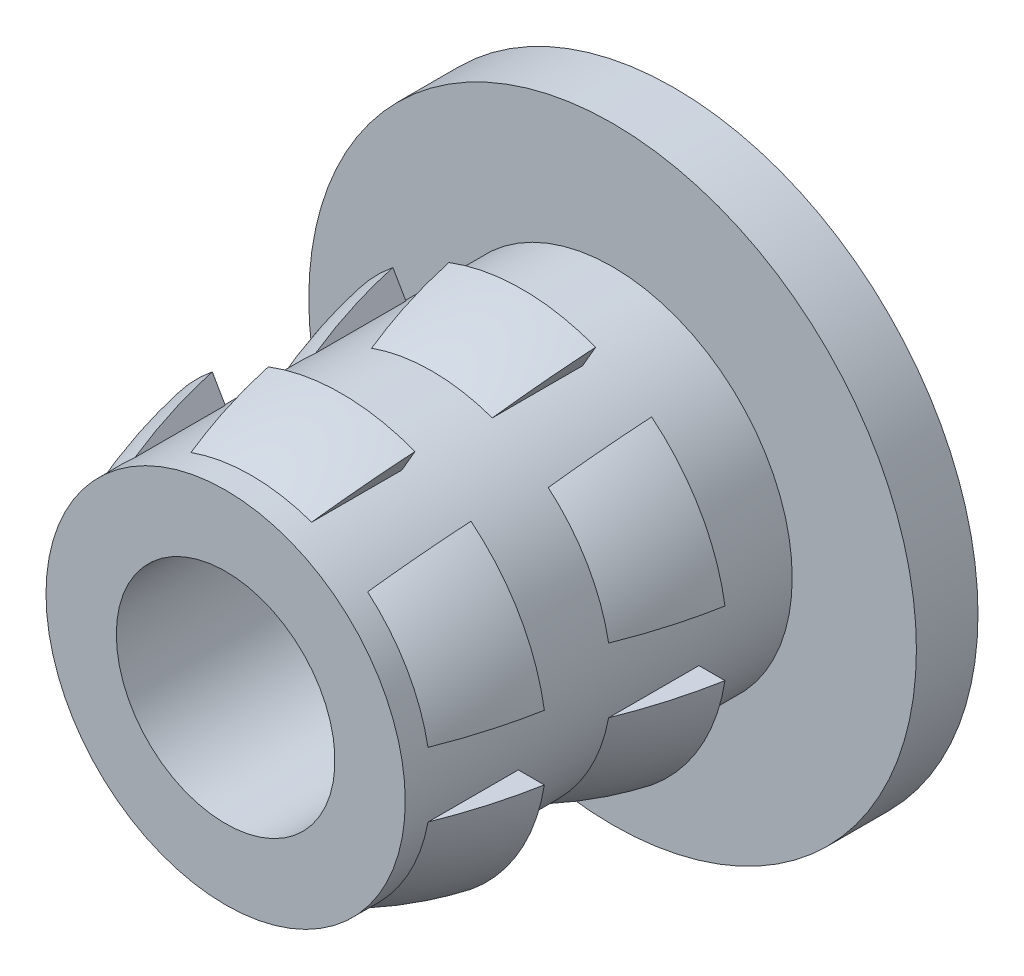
ISO-10303-21;
HEADER;
FILE_DESCRIPTION(('STEP AP214'),'2;1');
FILE_NAME('part.step','',(''),(''),'','','');
FILE_SCHEMA(('AUTOMOTIVE_DESIGN { 1 0 10303 214 1 1 1 1 }'));
ENDSEC;
DATA;
#1=APPLICATION_CONTEXT('core data for automotive mechanical design processes');
#2=APPLICATION_PROTOCOL_DEFINITION('international standard','automotive_design',2000,#1);
#3=PRODUCT_CONTEXT('',#1,'mechanical');
#4=PRODUCT('Part','Part','',(#3));
#5=PRODUCT_RELATED_PRODUCT_CATEGORY('part','',(#4));
#6=PRODUCT_DEFINITION_FORMATION('','',#4);
#7=PRODUCT_DEFINITION_CONTEXT('part definition',#1,'design');
#8=PRODUCT_DEFINITION('design','',#6,#7);
#9=PRODUCT_DEFINITION_SHAPE('','',#8);
#10=(LENGTH_UNIT() NAMED_UNIT(*) SI_UNIT(.MILLI.,.METRE.));
#11=(NAMED_UNIT(*) PLANE_ANGLE_UNIT() SI_UNIT($,.RADIAN.));
#12=(NAMED_UNIT(*) SI_UNIT($,.STERADIAN.) SOLID_ANGLE_UNIT());
#13=UNCERTAINTY_MEASURE_WITH_UNIT(LENGTH_MEASURE(1.E-05),#10,'distance_accuracy_value','');
#14=(GEOMETRIC_REPRESENTATION_CONTEXT(3) GLOBAL_UNCERTAINTY_ASSIGNED_CONTEXT((#13)) GLOBAL_UNIT_ASSIGNED_CONTEXT((#10,
#11,#12)) REPRESENTATION_CONTEXT('',''));
#15=CARTESIAN_POINT('',(0.,0.,0.));
#16=DIRECTION('',(0.,0.,1.));
#17=DIRECTION('',(1.,0.,0.));
#18=AXIS2_PLACEMENT_3D('',#15,#16,#17);
#19=CARTESIAN_POINT('',(11.50314757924,0.,-17.3980107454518));
#20=DIRECTION('',(0.,0.,1.));
#21=DIRECTION('',(1.,0.,0.));
#22=AXIS2_PLACEMENT_3D('',#19,#20,#21);
#23=PLANE('',#22);
#24=CARTESIAN_POINT('',(9.28064757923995,0.,-17.3980107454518));
#25=DIRECTION('',(0.,0.,-1.));
#26=DIRECTION('',(-1.,0.,0.));
#27=AXIS2_PLACEMENT_3D('',#24,#25,#26);
#28=CIRCLE('',#27,2.54);
#29=CARTESIAN_POINT('',(8.37290464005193,2.37225689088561,-17.3980107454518));
#30=VERTEX_POINT('',#29);
#31=CARTESIAN_POINT('',(10.188390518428,2.3722568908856,-17.3980107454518));
#32=VERTEX_POINT('',#31);
#33=EDGE_CURVE('E647',#30,#32,#28,.T.);
#34=ORIENTED_EDGE('',*,*,#33,.T.);
#35=DIRECTION('',(-0.50000000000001,-0.866025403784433,0.));
#36=VECTOR('',#35,1.);
#37=CARTESIAN_POINT('',(9.4898624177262,1.16237072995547,-17.3980107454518));
#38=LINE('',#37,#36);
#39=CARTESIAN_POINT('',(10.0273415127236,2.09331183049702,-17.3980107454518));
#40=VERTEX_POINT('',#39);
#41=EDGE_CURVE('E1213',#32,#40,#38,.T.);
#42=ORIENTED_EDGE('',*,*,#41,.T.);
#43=CARTESIAN_POINT('',(9.28064757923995,0.,-17.3980107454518));
#44=DIRECTION('',(0.,0.,-1.));
#45=DIRECTION('',(-1.,0.,0.));
#46=AXIS2_PLACEMENT_3D('',#43,#44,#45);
#47=CIRCLE('',#46,2.2225);
#48=CARTESIAN_POINT('',(8.53395364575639,2.09331183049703,-17.3980107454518));
#49=VERTEX_POINT('',#48);
#50=EDGE_CURVE('E294',#49,#40,#47,.T.);
#51=ORIENTED_EDGE('',*,*,#50,.F.);
#52=DIRECTION('',(-0.499999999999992,0.866025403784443,0.));
#53=VECTOR('',#52,1.);
#54=CARTESIAN_POINT('',(10.1826827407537,-0.762370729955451,-17.3980107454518));
#55=LINE('',#54,#53);
#56=EDGE_CURVE('E1225',#49,#30,#55,.T.);
#57=ORIENTED_EDGE('',*,*,#56,.T.);
#58=EDGE_LOOP('',(#34,#42,#51,#57));
#59=FACE_BOUND('',#58,.T.);
#60=ADVANCED_FACE('F39',(#59),#23,.F.);
#61=CARTESIAN_POINT('',(9.28064757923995,0.,-18.4216367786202));
#62=DIRECTION('',(0.,0.,-1.));
#63=DIRECTION('',(-1.,0.,0.));
#64=AXIS2_PLACEMENT_3D('',#61,#62,#63);
#65=DEGENERATE_TOROIDAL_SURFACE('',#64,3.18888963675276,5.81962084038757,.F.);
#66=CARTESIAN_POINT('',(9.28064757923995,0.,-16.2804107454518));
#67=DIRECTION('',(0.,0.,-1.));
#68=DIRECTION('',(-1.,0.,0.));
#69=AXIS2_PLACEMENT_3D('',#66,#67,#68);
#70=CIRCLE('',#69,2.2225);
#71=CARTESIAN_POINT('',(8.53395364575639,2.09331183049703,-16.2804107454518));
#72=VERTEX_POINT('',#71);
#73=CARTESIAN_POINT('',(10.0273415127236,2.09331183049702,-16.2804107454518));
#74=VERTEX_POINT('',#73);
#75=EDGE_CURVE('E502',#72,#74,#70,.T.);
#76=ORIENTED_EDGE('',*,*,#75,.T.);
#77=CARTESIAN_POINT('',(10.0273012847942,2.0932421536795,-16.2802107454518));
#78=CARTESIAN_POINT('',(10.0454520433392,2.12468018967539,-16.3704400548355));
#79=CARTESIAN_POINT('',(10.0624449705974,2.15411280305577,-16.461591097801));
#80=CARTESIAN_POINT('',(10.0940438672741,2.20884369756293,-16.6452704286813));
#81=CARTESIAN_POINT('',(10.1086558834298,2.23415245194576,-16.7377945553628));
#82=CARTESIAN_POINT('',(10.1489715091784,2.30398116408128,-17.0176159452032));
#83=CARTESIAN_POINT('',(10.1711195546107,2.34234270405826,-17.2069871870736));
#84=CARTESIAN_POINT('',(10.188408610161,2.37228822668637,-17.3982107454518));
#85=B_SPLINE_CURVE_WITH_KNOTS('',3,(#77,#78,#79,#80,#81,#82,#83,#84),.UNSPECIFIED.,.F.,.F.,(4,2,
2,4),(0.,0.291724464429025,0.58269608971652,1.16520237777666),.UNSPECIFIED.);
#86=EDGE_CURVE('E510',#74,#32,#85,.T.);
#87=ORIENTED_EDGE('',*,*,#86,.T.);
#88=ORIENTED_EDGE('',*,*,#33,.F.);
#89=CARTESIAN_POINT('',(8.37288654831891,2.37228822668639,-17.3982107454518));
#90=CARTESIAN_POINT('',(8.39017560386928,2.34234270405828,-17.2069871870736));
#91=CARTESIAN_POINT('',(8.41232364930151,2.3039811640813,-17.0176159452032));
#92=CARTESIAN_POINT('',(8.45263927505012,2.23415245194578,-16.7377945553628));
#93=CARTESIAN_POINT('',(8.4672512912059,2.20884369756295,-16.6452704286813));
#94=CARTESIAN_POINT('',(8.4988501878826,2.15411280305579,-16.461591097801));
#95=CARTESIAN_POINT('',(8.51584311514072,2.1246801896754,-16.3704400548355));
#96=CARTESIAN_POINT('',(8.53399387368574,2.09324215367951,-16.2802107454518));
#97=B_SPLINE_CURVE_WITH_KNOTS('',3,(#89,#90,#91,#92,#93,#94,#95,#96),.UNSPECIFIED.,.F.,.F.,(4,2,
2,4),(0.,0.582506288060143,0.873477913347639,1.16520237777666),.UNSPECIFIED.);
#98=EDGE_CURVE('E467',#30,#72,#97,.T.);
#99=ORIENTED_EDGE('',*,*,#98,.T.);
#100=EDGE_LOOP('',(#76,#87,#88,#99));
#101=FACE_BOUND('',#100,.T.);
#102=ADVANCED_FACE('F400',(#101),#65,.F.);
#103=CARTESIAN_POINT('',(11.50314757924,0.,-15.1628107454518));
#104=DIRECTION('',(0.,0.,1.));
#105=DIRECTION('',(1.,0.,0.));
#106=AXIS2_PLACEMENT_3D('',#103,#104,#105);
#107=PLANE('',#106);
#108=CARTESIAN_POINT('',(9.28064757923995,0.,-15.1628107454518));
#109=DIRECTION('',(0.,0.,-1.));
#110=DIRECTION('',(-1.,0.,0.));
#111=AXIS2_PLACEMENT_3D('',#108,#109,#110);
#112=CIRCLE('',#111,2.54);
#113=CARTESIAN_POINT('',(8.37290464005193,2.37225689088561,-15.1628107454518));
#114=VERTEX_POINT('',#113);
#115=CARTESIAN_POINT('',(10.188390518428,2.3722568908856,-15.1628107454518));
#116=VERTEX_POINT('',#115);
#117=EDGE_CURVE('E1195',#114,#116,#112,.T.);
#118=ORIENTED_EDGE('',*,*,#117,.T.);
#119=DIRECTION('',(-0.50000000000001,-0.866025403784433,0.));
#120=VECTOR('',#119,1.);
#121=CARTESIAN_POINT('',(9.4898624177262,1.16237072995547,-15.1628107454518));
#122=LINE('',#121,#120);
#123=CARTESIAN_POINT('',(10.0273415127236,2.09331183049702,-15.1628107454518));
#124=VERTEX_POINT('',#123);
#125=EDGE_CURVE('E1202',#116,#124,#122,.T.);
#126=ORIENTED_EDGE('',*,*,#125,.T.);
#127=CARTESIAN_POINT('',(9.28064757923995,0.,-15.1628107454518));
#128=DIRECTION('',(0.,0.,-1.));
#129=DIRECTION('',(-1.,0.,0.));
#130=AXIS2_PLACEMENT_3D('',#127,#128,#129);
#131=CIRCLE('',#130,2.2225);
#132=CARTESIAN_POINT('',(8.53395364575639,2.09331183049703,-15.1628107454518));
#133=VERTEX_POINT('',#132);
#134=EDGE_CURVE('E799',#133,#124,#131,.T.);
#135=ORIENTED_EDGE('',*,*,#134,.F.);
#136=DIRECTION('',(-0.499999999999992,0.866025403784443,0.));
#137=VECTOR('',#136,1.);
#138=CARTESIAN_POINT('',(10.1826827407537,-0.762370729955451,-15.1628107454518));
#139=LINE('',#138,#137);
#140=EDGE_CURVE('E1203',#133,#114,#139,.T.);
#141=ORIENTED_EDGE('',*,*,#140,.T.);
#142=EDGE_LOOP('',(#118,#126,#135,#141));
#143=FACE_BOUND('',#142,.T.);
#144=ADVANCED_FACE('F591',(#143),#107,.F.);
#145=CARTESIAN_POINT('',(9.28064757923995,0.,-16.2291982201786));
#146=DIRECTION('',(0.,0.,-1.));
#147=DIRECTION('',(-1.,0.,0.));
#148=AXIS2_PLACEMENT_3D('',#145,#146,#147);
#149=DEGENERATE_TOROIDAL_SURFACE('',#148,3.3394099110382,5.97533623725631,.F.);
#150=CARTESIAN_POINT('',(9.28064757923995,0.,-14.0452107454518));
#151=DIRECTION('',(0.,0.,-1.));
#152=DIRECTION('',(-1.,0.,0.));
#153=AXIS2_PLACEMENT_3D('',#150,#151,#152);
#154=CIRCLE('',#153,2.2225);
#155=CARTESIAN_POINT('',(8.53395364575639,2.09331183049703,-14.0452107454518));
#156=VERTEX_POINT('',#155);
#157=CARTESIAN_POINT('',(10.0273415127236,2.09331183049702,-14.0452107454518));
#158=VERTEX_POINT('',#157);
#159=EDGE_CURVE('E781',#156,#158,#154,.T.);
#160=ORIENTED_EDGE('',*,*,#159,.T.);
#161=CARTESIAN_POINT('',(10.0273015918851,2.09324268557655,-14.0450107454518));
#162=CARTESIAN_POINT('',(10.0453299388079,2.12446869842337,-14.1353216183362));
#163=CARTESIAN_POINT('',(10.062229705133,2.15373995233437,-14.2265242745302));
#164=CARTESIAN_POINT('',(10.0937048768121,2.2082565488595,-14.4102706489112));
#165=CARTESIAN_POINT('',(10.1082858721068,2.23351157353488,-14.5028105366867));
#166=CARTESIAN_POINT('',(10.148598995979,2.30333595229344,-14.7826157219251));
#167=CARTESIAN_POINT('',(10.1708681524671,2.3419072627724,-14.9719003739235));
#168=CARTESIAN_POINT('',(10.1884088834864,2.37228870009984,-15.1630107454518));
#169=B_SPLINE_CURVE_WITH_KNOTS('',3,(#161,#162,#163,#164,#165,#166,#167,#168),.UNSPECIFIED.,.F.,
.F.,(4,2,2,4),(0.,0.291680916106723,0.582647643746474,1.16511520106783),.UNSPECIFIED.);
#170=EDGE_CURVE('E278',#158,#116,#169,.T.);
#171=ORIENTED_EDGE('',*,*,#170,.T.);
#172=ORIENTED_EDGE('',*,*,#117,.F.);
#173=CARTESIAN_POINT('',(8.37288627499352,2.37228870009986,-15.1630107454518));
#174=CARTESIAN_POINT('',(8.39042700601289,2.34190726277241,-14.9719003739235));
#175=CARTESIAN_POINT('',(8.41269616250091,2.30333595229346,-14.7826157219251));
#176=CARTESIAN_POINT('',(8.45300928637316,2.2335115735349,-14.5028105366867));
#177=CARTESIAN_POINT('',(8.46759028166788,2.20825654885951,-14.4102706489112));
#178=CARTESIAN_POINT('',(8.49906545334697,2.15373995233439,-14.2265242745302));
#179=CARTESIAN_POINT('',(8.515965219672,2.12446869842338,-14.1353216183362));
#180=CARTESIAN_POINT('',(8.53399356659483,2.09324268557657,-14.0450107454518));
#181=B_SPLINE_CURVE_WITH_KNOTS('',3,(#173,#174,#175,#176,#177,#178,#179,#180),.UNSPECIFIED.,.F.,
.F.,(4,2,2,4),(0.,0.582467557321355,0.873434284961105,1.16511520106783),.UNSPECIFIED.);
#182=EDGE_CURVE('E1204',#114,#156,#181,.T.);
#183=ORIENTED_EDGE('',*,*,#182,.T.);
#184=EDGE_LOOP('',(#160,#171,#172,#183));
#185=FACE_BOUND('',#184,.T.);
#186=ADVANCED_FACE('F584',(#185),#149,.F.);
#187=CARTESIAN_POINT('',(6.77234137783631,0.4,-17.3980107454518));
#188=VERTEX_POINT('',#187);
#189=CARTESIAN_POINT('',(7.68008431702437,1.97225689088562,-17.3980107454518));
#190=VERTEX_POINT('',#189);
#191=EDGE_CURVE('E341',#188,#190,#28,.T.);
#192=ORIENTED_EDGE('',*,*,#191,.T.);
#193=DIRECTION('',(0.499999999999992,-0.866025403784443,0.));
#194=VECTOR('',#193,1.);
#195=CARTESIAN_POINT('',(9.48986241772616,-1.16237072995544,-17.3980107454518));
#196=LINE('',#195,#194);
#197=CARTESIAN_POINT('',(7.84113332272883,1.69331183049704,-17.3980107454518));
#198=VERTEX_POINT('',#197);
#199=EDGE_CURVE('E340',#190,#198,#196,.T.);
#200=ORIENTED_EDGE('',*,*,#199,.T.);
#201=CARTESIAN_POINT('',(7.09443938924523,0.4,-17.3980107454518));
#202=VERTEX_POINT('',#201);
#203=EDGE_CURVE('E299',#202,#198,#47,.T.);
#204=ORIENTED_EDGE('',*,*,#203,.F.);
#205=DIRECTION('',(-1.,0.,0.));
#206=VECTOR('',#205,1.);
#207=CARTESIAN_POINT('',(11.50314757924,0.4,-17.3980107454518));
#208=LINE('',#207,#206);
#209=EDGE_CURVE('E338',#202,#188,#208,.T.);
#210=ORIENTED_EDGE('',*,*,#209,.T.);
#211=EDGE_LOOP('',(#192,#200,#204,#210));
#212=FACE_BOUND('',#211,.T.);
#213=ADVANCED_FACE('F337',(#212),#23,.F.);
#214=CARTESIAN_POINT('',(7.09443938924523,0.4,-16.2804107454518));
#215=VERTEX_POINT('',#214);
#216=CARTESIAN_POINT('',(7.84113332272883,1.69331183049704,-16.2804107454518));
#217=VERTEX_POINT('',#216);
#218=EDGE_CURVE('E512',#215,#217,#70,.T.);
#219=ORIENTED_EDGE('',*,*,#218,.T.);
#220=CARTESIAN_POINT('',(7.84117355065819,1.69324215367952,-16.2802107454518));
#221=CARTESIAN_POINT('',(7.82302279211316,1.72468018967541,-16.3704400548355));
#222=CARTESIAN_POINT('',(7.80602986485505,1.75411280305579,-16.461591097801));
#223=CARTESIAN_POINT('',(7.77443096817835,1.80884369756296,-16.6452704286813));
#224=CARTESIAN_POINT('',(7.75981895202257,1.83415245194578,-16.7377945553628));
#225=CARTESIAN_POINT('',(7.71950332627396,1.90398116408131,-17.0176159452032));
#226=CARTESIAN_POINT('',(7.69735528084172,1.94234270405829,-17.2069871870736));
#227=CARTESIAN_POINT('',(7.68006622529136,1.9722882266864,-17.3982107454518));
#228=B_SPLINE_CURVE_WITH_KNOTS('',3,(#220,#221,#222,#223,#224,#225,#226,#227),.UNSPECIFIED.,.F.,
.F.,(4,2,2,4),(0.,0.291724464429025,0.58269608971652,1.16520237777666),.UNSPECIFIED.);
#229=EDGE_CURVE('E345',#217,#190,#228,.T.);
#230=ORIENTED_EDGE('',*,*,#229,.T.);
#231=ORIENTED_EDGE('',*,*,#191,.F.);
#232=CARTESIAN_POINT('',(6.90494918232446,0.4,-16.8310141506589));
#233=CARTESIAN_POINT('',(6.9493884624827,0.4,-16.6767885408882));
#234=CARTESIAN_POINT('',(7.00032246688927,0.4,-16.5243957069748));
#235=CARTESIAN_POINT('',(7.11488260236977,0.4,-16.2243630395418));
#236=CARTESIAN_POINT('',(7.17851699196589,0.4,-16.0767263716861));
#237=CARTESIAN_POINT('',(7.3179493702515,0.4,-15.7876664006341));
#238=CARTESIAN_POINT('',(7.3937228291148,0.4,-15.6462312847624));
#239=CARTESIAN_POINT('',(7.55706092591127,0.4,-15.3704639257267));
#240=CARTESIAN_POINT('',(7.64461784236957,0.4,-15.2361271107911));
#241=CARTESIAN_POINT('',(7.82343512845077,0.4,-14.9864473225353));
#242=CARTESIAN_POINT('',(7.91378354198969,0.4,-14.8704535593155));
#243=CARTESIAN_POINT('',(8.05668227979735,0.4,-14.7021788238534));
#244=CARTESIAN_POINT('',(8.10570811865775,0.4,-14.646877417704));
#245=CARTESIAN_POINT('',(8.20615851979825,0.4,-14.5385464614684));
#246=CARTESIAN_POINT('',(8.25758167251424,0.4,-14.4855156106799));
#247=CARTESIAN_POINT('',(8.36344180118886,0.4,-14.3814936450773));
#248=CARTESIAN_POINT('',(8.4179032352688,0.4,-14.3305274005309));
#249=CARTESIAN_POINT('',(8.52971985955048,0.4,-14.2315633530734));
#250=CARTESIAN_POINT('',(8.58708150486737,0.4,-14.183572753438));
#251=CARTESIAN_POINT('',(8.67534498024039,0.4,-14.1149289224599));
#252=CARTESIAN_POINT('',(8.70501330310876,0.4,-14.0926870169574));
#253=CARTESIAN_POINT('',(8.76527837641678,0.4,-14.049504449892));
#254=CARTESIAN_POINT('',(8.79587487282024,0.4,-14.0285634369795));
#255=CARTESIAN_POINT('',(8.85806256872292,0.4,-13.9884661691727));
#256=CARTESIAN_POINT('',(8.88964965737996,0.4,-13.9693035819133));
#257=CARTESIAN_POINT('',(8.95415653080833,0.4,-13.9333986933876));
#258=CARTESIAN_POINT('',(8.98707448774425,0.4,-13.9166532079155));
#259=CARTESIAN_POINT('',(9.03693679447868,0.4,-13.8946311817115));
#260=CARTESIAN_POINT('',(9.05324785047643,0.4,-13.8879313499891));
#261=CARTESIAN_POINT('',(9.08625953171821,0.4,-13.8755795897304));
#262=CARTESIAN_POINT('',(9.10296020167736,0.4,-13.8699277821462));
#263=CARTESIAN_POINT('',(9.15345100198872,0.4,-13.8549831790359));
#264=CARTESIAN_POINT('',(9.18786916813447,0.4,-13.8475883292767));
#265=CARTESIAN_POINT('',(9.24033457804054,0.4,-13.8416715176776));
#266=CARTESIAN_POINT('',(9.25810646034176,0.4,-13.8405742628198));
#267=CARTESIAN_POINT('',(9.29366670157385,0.4,-13.8402423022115));
#268=CARTESIAN_POINT('',(9.31145505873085,0.4,-13.8410074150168));
#269=CARTESIAN_POINT('',(9.36468973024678,0.4,-13.8460478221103));
#270=CARTESIAN_POINT('',(9.39989010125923,0.4,-13.8530808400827));
#271=CARTESIAN_POINT('',(9.45876973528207,0.4,-13.8698028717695));
#272=CARTESIAN_POINT('',(9.48286770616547,0.4,-13.8781592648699));
#273=CARTESIAN_POINT('',(9.53026754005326,0.4,-13.8969200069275));
#274=CARTESIAN_POINT('',(9.55356884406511,0.4,-13.9073257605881));
#275=CARTESIAN_POINT('',(9.59951708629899,0.4,-13.9296913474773));
#276=CARTESIAN_POINT('',(9.62216094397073,0.4,-13.9416573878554));
#277=CARTESIAN_POINT('',(9.66679257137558,0.4,-13.9667310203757));
#278=CARTESIAN_POINT('',(9.6887805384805,0.4,-13.9798382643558));
#279=CARTESIAN_POINT('',(9.74887102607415,0.4,-14.0173432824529));
#280=CARTESIAN_POINT('',(9.78638409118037,0.4,-14.0426830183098));
#281=CARTESIAN_POINT('',(9.86003425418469,0.4,-14.0953015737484));
#282=CARTESIAN_POINT('',(9.89617057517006,0.4,-14.1225814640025));
#283=CARTESIAN_POINT('',(9.96731415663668,0.4,-14.1786856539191));
#284=CARTESIAN_POINT('',(10.0023195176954,0.4,-14.2075123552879));
#285=CARTESIAN_POINT('',(10.0712657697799,0.4,-14.2664148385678));
#286=CARTESIAN_POINT('',(10.10520650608,0.4,-14.2964908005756));
#287=CARTESIAN_POINT('',(10.2056770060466,0.4,-14.3884570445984));
#288=CARTESIAN_POINT('',(10.2707217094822,0.4,-14.4519785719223));
#289=CARTESIAN_POINT('',(10.397042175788,0.4,-14.5825182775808));
#290=CARTESIAN_POINT('',(10.458321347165,0.4,-14.6495331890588));
#291=CARTESIAN_POINT('',(10.6184307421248,0.4,-14.8341844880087));
#292=CARTESIAN_POINT('',(10.7139007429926,0.4,-14.9547588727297));
#293=CARTESIAN_POINT('',(10.8943909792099,0.4,-15.2035866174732));
#294=CARTESIAN_POINT('',(10.9794032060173,0.4,-15.3318457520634));
#295=CARTESIAN_POINT('',(11.1384325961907,0.4,-15.5946961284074));
#296=CARTESIAN_POINT('',(11.2124691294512,0.4,-15.7292756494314));
#297=CARTESIAN_POINT('',(11.3493507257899,0.4,-16.0039642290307));
#298=CARTESIAN_POINT('',(11.4121984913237,0.4,-16.144071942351));
#299=CARTESIAN_POINT('',(11.5270690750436,0.4,-16.4305874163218));
#300=CARTESIAN_POINT('',(11.5789547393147,0.4,-16.5770501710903));
#301=CARTESIAN_POINT('',(11.6706691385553,0.4,-16.8737578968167));
#302=CARTESIAN_POINT('',(11.7104936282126,0.4,-17.024004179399));
#303=CARTESIAN_POINT('',(11.7778310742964,0.4,-17.3272445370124));
#304=CARTESIAN_POINT('',(11.805342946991,0.4,-17.4802388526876));
#305=CARTESIAN_POINT('',(11.8478943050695,0.4,-17.7880077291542));
#306=CARTESIAN_POINT('',(11.8629292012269,0.4,-17.9427829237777));
#307=CARTESIAN_POINT('',(11.8807403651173,0.4,-18.2587459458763));
#308=CARTESIAN_POINT('',(11.8830460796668,0.4,-18.4199604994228));
#309=CARTESIAN_POINT('',(11.8741190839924,0.4,-18.7420752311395));
#310=CARTESIAN_POINT('',(11.8628811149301,0.4,-18.9029752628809));
#311=CARTESIAN_POINT('',(11.8269165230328,0.4,-19.2233844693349));
#312=CARTESIAN_POINT('',(11.8021798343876,0.4,-19.382892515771));
#313=CARTESIAN_POINT('',(11.7393624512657,0.4,-19.6993114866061));
#314=CARTESIAN_POINT('',(11.7012771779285,0.4,-19.8562215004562));
#315=CARTESIAN_POINT('',(11.6118331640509,0.4,-20.1668449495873));
#316=CARTESIAN_POINT('',(11.5604270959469,0.4,-20.3205448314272));
#317=CARTESIAN_POINT('',(11.4447449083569,0.4,-20.6230350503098));
#318=CARTESIAN_POINT('',(11.3804625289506,0.4,-20.7718229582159));
#319=CARTESIAN_POINT('',(11.1693930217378,0.4,-21.2079432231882));
#320=CARTESIAN_POINT('',(11.0039135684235,0.4,-21.4866625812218));
#321=CARTESIAN_POINT('',(10.7320074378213,0.4,-21.8643697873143));
#322=CARTESIAN_POINT('',(10.6439755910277,0.4,-21.977050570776));
#323=CARTESIAN_POINT('',(10.5049783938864,0.4,-22.1406303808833));
#324=CARTESIAN_POINT('',(10.4573665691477,0.4,-22.1943709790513));
#325=CARTESIAN_POINT('',(10.3598745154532,0.4,-22.2997168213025));
#326=CARTESIAN_POINT('',(10.3099952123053,0.4,-22.3513229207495));
#327=CARTESIAN_POINT('',(10.2074924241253,0.4,-22.4525347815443));
#328=CARTESIAN_POINT('',(10.1548509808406,0.4,-22.5021223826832));
#329=CARTESIAN_POINT('',(10.0469005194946,0.4,-22.5985259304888));
#330=CARTESIAN_POINT('',(9.99158712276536,0.4,-22.6453370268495));
#331=CARTESIAN_POINT('',(9.90651561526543,0.4,-22.7125836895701));
#332=CARTESIAN_POINT('',(9.87788647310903,0.4,-22.7344504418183));
#333=CARTESIAN_POINT('',(9.81978343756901,0.4,-22.7770269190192));
#334=CARTESIAN_POINT('',(9.79030972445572,0.4,-22.7977368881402));
#335=CARTESIAN_POINT('',(9.73044918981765,0.4,-22.8376186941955));
#336=CARTESIAN_POINT('',(9.70006506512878,0.4,-22.8567945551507));
#337=CARTESIAN_POINT('',(9.63811313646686,0.4,-22.8931080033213));
#338=CARTESIAN_POINT('',(9.60654646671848,0.4,-22.9102474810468));
#339=CARTESIAN_POINT('',(9.5572690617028,0.4,-22.934096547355));
#340=CARTESIAN_POINT('',(9.54009008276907,0.4,-22.9418964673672));
#341=CARTESIAN_POINT('',(9.50529468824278,0.4,-22.9564466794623));
#342=CARTESIAN_POINT('',(9.487678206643,0.4,-22.9631968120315));
#343=CARTESIAN_POINT('',(9.43432280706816,0.4,-22.9814050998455));
#344=CARTESIAN_POINT('',(9.39785850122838,0.4,-22.990934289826));
#345=CARTESIAN_POINT('',(9.33044035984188,0.4,-23.0013274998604));
#346=CARTESIAN_POINT('',(9.2996907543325,0.4,-23.0034524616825));
#347=CARTESIAN_POINT('',(9.23830426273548,0.4,-23.0020567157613));
#348=CARTESIAN_POINT('',(9.20766749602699,0.4,-22.9985311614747));
#349=CARTESIAN_POINT('',(9.13552215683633,0.4,-22.9843622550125));
#350=CARTESIAN_POINT('',(9.09447759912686,0.4,-22.9714645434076));
#351=CARTESIAN_POINT('',(9.03465730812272,0.4,-22.9477913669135));
#352=CARTESIAN_POINT('',(9.01494450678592,0.4,-22.9391424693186));
#353=CARTESIAN_POINT('',(8.97605253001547,0.4,-22.9207120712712));
#354=CARTESIAN_POINT('',(8.95687323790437,0.4,-22.9109308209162));
#355=CARTESIAN_POINT('',(8.90716760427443,0.4,-22.8841074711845));
#356=CARTESIAN_POINT('',(8.87703381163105,0.4,-22.8663452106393));
#357=CARTESIAN_POINT('',(8.81778937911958,0.4,-22.829178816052));
#358=CARTESIAN_POINT('',(8.78867932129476,0.4,-22.8097737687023));
#359=CARTESIAN_POINT('',(8.70253675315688,0.4,-22.7496548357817));
#360=CARTESIAN_POINT('',(8.64679371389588,0.4,-22.7070960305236));
#361=CARTESIAN_POINT('',(8.53784201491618,0.4,-22.6185666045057));
#362=CARTESIAN_POINT('',(8.48464196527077,0.4,-22.5725855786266));
#363=CARTESIAN_POINT('',(8.38069550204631,0.4,-22.4780463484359));
#364=CARTESIAN_POINT('',(8.32994659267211,0.4,-22.4294908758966));
#365=CARTESIAN_POINT('',(8.17724880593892,0.4,-22.2766885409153));
#366=CARTESIAN_POINT('',(8.07897467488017,0.4,-22.16874255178));
#367=CARTESIAN_POINT('',(7.89167588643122,0.4,-21.9449922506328));
#368=CARTESIAN_POINT('',(7.80266049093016,0.4,-21.8291802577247));
#369=CARTESIAN_POINT('',(7.63436472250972,0.4,-21.5911195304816));
#370=CARTESIAN_POINT('',(7.55506012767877,0.4,-21.4688879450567));
#371=CARTESIAN_POINT('',(7.40624942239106,0.4,-21.2186978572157));
#372=CARTESIAN_POINT('',(7.33674005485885,0.4,-21.0907412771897));
#373=CARTESIAN_POINT('',(7.13915474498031,0.4,-20.6909776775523));
#374=CARTESIAN_POINT('',(7.02739878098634,0.4,-20.410891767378));
#375=CARTESIAN_POINT('',(6.84909526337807,0.4,-19.8362387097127));
#376=CARTESIAN_POINT('',(6.7826185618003,0.4,-19.5416496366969));
#377=CARTESIAN_POINT('',(6.71656195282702,0.4,-19.0845615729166));
#378=CARTESIAN_POINT('',(6.70024972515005,0.4,-18.9243168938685));
#379=CARTESIAN_POINT('',(6.68111627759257,0.4,-18.6030381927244));
#380=CARTESIAN_POINT('',(6.67829090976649,0.4,-18.4420044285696));
#381=CARTESIAN_POINT('',(6.68614041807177,0.4,-18.1206419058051));
#382=CARTESIAN_POINT('',(6.69678504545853,0.4,-17.9603123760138));
#383=CARTESIAN_POINT('',(6.73144750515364,0.4,-17.6411707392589));
#384=CARTESIAN_POINT('',(6.75545810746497,0.4,-17.4823578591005));
#385=CARTESIAN_POINT('',(6.80221728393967,0.4,-17.2417591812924));
#386=CARTESIAN_POINT('',(6.82020540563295,0.4,-17.159021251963));
#387=CARTESIAN_POINT('',(6.85984015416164,0.4,-16.9943562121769));
#388=CARTESIAN_POINT('',(6.88148969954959,0.4,-16.9124298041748));
#389=CARTESIAN_POINT('',(6.90494918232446,0.4,-16.8310141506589));
#390=B_SPLINE_CURVE_WITH_KNOTS('',3,(#232,#233,#234,#235,#236,#237,#238,#239,#240,#241,#242,
#243,#244,#245,#246,#247,#248,#249,#250,#251,#252,#253,#254,#255,#256,#257,#258,#259,#260,#261,
#262,#263,#264,#265,#266,#267,#268,#269,#270,#271,#272,#273,#274,#275,#276,#277,#278,#279,#280,
#281,#282,#283,#284,#285,#286,#287,#288,#289,#290,#291,#292,#293,#294,#295,#296,#297,#298,#299,
#300,#301,#302,#303,#304,#305,#306,#307,#308,#309,#310,#311,#312,#313,#314,#315,#316,#317,#318,
#319,#320,#321,#322,#323,#324,#325,#326,#327,#328,#329,#330,#331,#332,#333,#334,#335,#336,#337,
#338,#339,#340,#341,#342,#343,#344,#345,#346,#347,#348,#349,#350,#351,#352,#353,#354,#355,#356,
#357,#358,#359,#360,#361,#362,#363,#364,#365,#366,#367,#368,#369,#370,#371,#372,#373,#374,#375,
#376,#377,#378,#379,#380,#381,#382,#383,#384,#385,#386,#387,#388,#389),.UNSPECIFIED.,.T.,.F.,(4,
2,2,2,2,2,2,2,2,2,2,2,2,2,2,2,2,2,2,2,2,2,2,2,2,2,2,2,2,2,2,2,2,2,2,2,2,2,2,2,2,2,2,2,2,2,2,2,2,
2,2,2,2,2,2,2,2,2,2,2,2,2,2,2,2,2,2,2,2,2,2,2,2,2,2,2,2,2,4),(0.,0.481422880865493,
0.963159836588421,1.4439353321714,1.92439730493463,2.36494433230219,2.5865965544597,
2.80812005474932,3.03179919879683,3.25600022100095,3.36721480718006,3.47839922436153,
3.58917120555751,3.69979590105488,3.7526630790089,3.80553635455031,3.91049540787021,
3.96382386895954,4.01714713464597,4.12413533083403,4.20056122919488,4.27703969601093,
4.35383226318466,4.43060148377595,4.56631381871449,4.70210163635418,4.83810675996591,
4.97413155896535,5.24669326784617,5.51900450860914,5.97976182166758,6.44086981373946,
6.9011540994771,7.36132706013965,7.82695505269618,8.29274674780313,8.75857943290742,
9.22458338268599,9.70770401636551,10.1910123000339,10.6746814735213,11.1585167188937,
11.6440951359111,12.1299101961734,13.0965108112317,13.5251209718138,13.7404494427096,
13.9556907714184,14.1725661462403,14.3898098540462,14.4978631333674,14.6058935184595,
14.7136305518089,14.8212667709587,14.8778352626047,14.9344123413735,15.0468310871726,
15.1387998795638,15.2308475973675,15.359103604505,15.4236706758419,15.4882235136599,
15.5930837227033,15.6980026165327,15.9081920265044,16.1190488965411,16.3296863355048,
16.7670061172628,17.2047592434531,17.641397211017,18.077889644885,18.978534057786,
19.8805845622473,20.36331719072,20.8459013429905,21.3274037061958,21.808645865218,
22.0625854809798,22.3167284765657),.UNSPECIFIED.);
#391=EDGE_CURVE('E388',#188,#215,#390,.T.);
#392=ORIENTED_EDGE('',*,*,#391,.T.);
#393=EDGE_LOOP('',(#219,#230,#231,#392));
#394=FACE_BOUND('',#393,.T.);
#395=ADVANCED_FACE('F592',(#394),#65,.F.);
#396=CARTESIAN_POINT('',(6.77234137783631,0.4,-15.1628107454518));
#397=VERTEX_POINT('',#396);
#398=CARTESIAN_POINT('',(7.68008431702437,1.97225689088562,-15.1628107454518));
#399=VERTEX_POINT('',#398);
#400=EDGE_CURVE('E1194',#397,#399,#112,.T.);
#401=ORIENTED_EDGE('',*,*,#400,.T.);
#402=DIRECTION('',(0.499999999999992,-0.866025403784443,0.));
#403=VECTOR('',#402,1.);
#404=CARTESIAN_POINT('',(9.48986241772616,-1.16237072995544,-15.1628107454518));
#405=LINE('',#404,#403);
#406=CARTESIAN_POINT('',(7.84113332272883,1.69331183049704,-15.1628107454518));
#407=VERTEX_POINT('',#406);
#408=EDGE_CURVE('E350',#399,#407,#405,.T.);
#409=ORIENTED_EDGE('',*,*,#408,.T.);
#410=CARTESIAN_POINT('',(7.09443938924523,0.4,-15.1628107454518));
#411=VERTEX_POINT('',#410);
#412=EDGE_CURVE('E801',#411,#407,#131,.T.);
#413=ORIENTED_EDGE('',*,*,#412,.F.);
#414=DIRECTION('',(-1.,0.,0.));
#415=VECTOR('',#414,1.);
#416=CARTESIAN_POINT('',(11.50314757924,0.4,-15.1628107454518));
#417=LINE('',#416,#415);
#418=EDGE_CURVE('E368',#411,#397,#417,.T.);
#419=ORIENTED_EDGE('',*,*,#418,.T.);
#420=EDGE_LOOP('',(#401,#409,#413,#419));
#421=FACE_BOUND('',#420,.T.);
#422=ADVANCED_FACE('F636',(#421),#107,.F.);
#423=CARTESIAN_POINT('',(7.09443938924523,0.4,-14.0452107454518));
#424=VERTEX_POINT('',#423);
#425=CARTESIAN_POINT('',(7.84113332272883,1.69331183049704,-14.0452107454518));
#426=VERTEX_POINT('',#425);
#427=EDGE_CURVE('E778',#424,#426,#154,.T.);
#428=ORIENTED_EDGE('',*,*,#427,.T.);
#429=CARTESIAN_POINT('',(7.84117324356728,1.69324268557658,-14.0450107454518));
#430=CARTESIAN_POINT('',(7.82314489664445,1.72446869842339,-14.1353216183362));
#431=CARTESIAN_POINT('',(7.80624513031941,1.7537399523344,-14.2265242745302));
#432=CARTESIAN_POINT('',(7.77476995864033,1.80825654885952,-14.4102706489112));
#433=CARTESIAN_POINT('',(7.76018896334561,1.8335115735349,-14.5028105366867));
#434=CARTESIAN_POINT('',(7.71987583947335,1.90333595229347,-14.7826157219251));
#435=CARTESIAN_POINT('',(7.69760668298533,1.94190726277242,-14.9719003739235));
#436=CARTESIAN_POINT('',(7.68006595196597,1.97228870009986,-15.1630107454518));
#437=B_SPLINE_CURVE_WITH_KNOTS('',3,(#429,#430,#431,#432,#433,#434,#435,#436),.UNSPECIFIED.,.F.,
.F.,(4,2,2,4),(0.,0.291680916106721,0.582647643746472,1.16511520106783),.UNSPECIFIED.);
#438=EDGE_CURVE('E1226',#426,#399,#437,.T.);
#439=ORIENTED_EDGE('',*,*,#438,.T.);
#440=ORIENTED_EDGE('',*,*,#400,.F.);
#441=CARTESIAN_POINT('',(6.90569002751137,0.4,-14.5960276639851));
#442=CARTESIAN_POINT('',(6.99469512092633,0.4,-14.2871767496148));
#443=CARTESIAN_POINT('',(7.10912655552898,0.4,-13.9853926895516));
#444=CARTESIAN_POINT('',(7.38575842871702,0.4,-13.4057140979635));
#445=CARTESIAN_POINT('',(7.54779523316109,0.4,-13.127741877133));
#446=CARTESIAN_POINT('',(7.81334739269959,0.4,-12.750198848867));
#447=CARTESIAN_POINT('',(7.89894748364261,0.4,-12.6377576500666));
#448=CARTESIAN_POINT('',(8.0339238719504,0.4,-12.474281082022));
#449=CARTESIAN_POINT('',(8.08007899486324,0.4,-12.4205839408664));
#450=CARTESIAN_POINT('',(8.17456402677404,0.4,-12.3151589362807));
#451=CARTESIAN_POINT('',(8.22289339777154,0.4,-12.2634305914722));
#452=CARTESIAN_POINT('',(8.32205676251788,0.4,-12.1618950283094));
#453=CARTESIAN_POINT('',(8.37290253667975,0.4,-12.1120992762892));
#454=CARTESIAN_POINT('',(8.47707252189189,0.4,-12.0150490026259));
#455=CARTESIAN_POINT('',(8.53039938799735,0.4,-11.9677973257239));
#456=CARTESIAN_POINT('',(8.63969727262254,0.4,-11.8766595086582));
#457=CARTESIAN_POINT('',(8.69566192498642,0.4,-11.8327658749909));
#458=CARTESIAN_POINT('',(8.78219595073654,0.4,-11.7706268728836));
#459=CARTESIAN_POINT('',(8.8114458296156,0.4,-11.7505462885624));
#460=CARTESIAN_POINT('',(8.87099924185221,0.4,-11.712024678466));
#461=CARTESIAN_POINT('',(8.90130217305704,0.4,-11.6935827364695));
#462=CARTESIAN_POINT('',(8.95072556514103,0.4,-11.6659966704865));
#463=CARTESIAN_POINT('',(8.96942415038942,0.4,-11.6561035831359));
#464=CARTESIAN_POINT('',(9.00734407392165,0.4,-11.6373812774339));
#465=CARTESIAN_POINT('',(9.02656553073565,0.4,-11.6285523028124));
#466=CARTESIAN_POINT('',(9.08492898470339,0.4,-11.6041893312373));
#467=CARTESIAN_POINT('',(9.12499146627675,0.4,-11.59064799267));
#468=CARTESIAN_POINT('',(9.19552464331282,0.4,-11.5749792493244));
#469=CARTESIAN_POINT('',(9.22549640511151,0.4,-11.5707048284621));
#470=CARTESIAN_POINT('',(9.28569409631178,0.4,-11.5676927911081));
#471=CARTESIAN_POINT('',(9.31591955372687,0.4,-11.5689465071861));
#472=CARTESIAN_POINT('',(9.3826996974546,0.4,-11.5775680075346));
#473=CARTESIAN_POINT('',(9.41906637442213,0.4,-11.5863076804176));
#474=CARTESIAN_POINT('',(9.49010629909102,0.4,-11.6093570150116));
#475=CARTESIAN_POINT('',(9.52476693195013,0.4,-11.623702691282));
#476=CARTESIAN_POINT('',(9.58332761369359,0.4,-11.6515728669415));
#477=CARTESIAN_POINT('',(9.60762650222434,0.4,-11.664291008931));
#478=CARTESIAN_POINT('',(9.65545025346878,0.4,-11.6911172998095));
#479=CARTESIAN_POINT('',(9.67897485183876,0.4,-11.7052259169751));
#480=CARTESIAN_POINT('',(9.74865096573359,0.4,-11.7491562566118));
#481=CARTESIAN_POINT('',(9.79381489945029,0.4,-11.7805364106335));
#482=CARTESIAN_POINT('',(9.88231821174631,0.4,-11.8460958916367));
#483=CARTESIAN_POINT('',(9.92564897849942,0.4,-11.8802865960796));
#484=CARTESIAN_POINT('',(10.0105801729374,0.4,-11.9506533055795));
#485=CARTESIAN_POINT('',(10.0521824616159,0.4,-11.9868270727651));
#486=CARTESIAN_POINT('',(10.1397957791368,0.4,-12.0661693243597));
#487=CARTESIAN_POINT('',(10.1855749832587,0.4,-12.1095931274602));
#488=CARTESIAN_POINT('',(10.2753166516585,0.4,-12.1982843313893));
#489=CARTESIAN_POINT('',(10.3192788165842,0.4,-12.2435520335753));
#490=CARTESIAN_POINT('',(10.4486161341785,0.4,-12.3818863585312));
#491=CARTESIAN_POINT('',(10.5313716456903,0.4,-12.4774194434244));
#492=CARTESIAN_POINT('',(10.6897584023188,0.4,-12.6737302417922));
#493=CARTESIAN_POINT('',(10.765409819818,0.4,-12.7744917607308));
#494=CARTESIAN_POINT('',(10.909734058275,0.4,-12.980813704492));
#495=CARTESIAN_POINT('',(10.9784092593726,0.4,-13.0863724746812));
#496=CARTESIAN_POINT('',(11.1938287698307,0.4,-13.4426522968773));
#497=CARTESIAN_POINT('',(11.3253226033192,0.4,-13.7028152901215));
#498=CARTESIAN_POINT('',(11.5483415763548,0.4,-14.2401056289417));
#499=CARTESIAN_POINT('',(11.6398096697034,0.4,-14.5172565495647));
#500=CARTESIAN_POINT('',(11.7500365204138,0.4,-14.9585581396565));
#501=CARTESIAN_POINT('',(11.7831071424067,0.4,-15.1192609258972));
#502=CARTESIAN_POINT('',(11.8357621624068,0.4,-15.4429041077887));
#503=CARTESIAN_POINT('',(11.8553454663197,0.4,-15.6058446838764));
#504=CARTESIAN_POINT('',(11.8808771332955,0.4,-15.9326962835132));
#505=CARTESIAN_POINT('',(11.8868326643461,0.4,-16.0966067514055));
#506=CARTESIAN_POINT('',(11.88509619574,0.4,-16.4243558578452));
#507=CARTESIAN_POINT('',(11.8774042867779,0.4,-16.5881944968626));
#508=CARTESIAN_POINT('',(11.8482488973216,0.4,-16.9165956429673));
#509=CARTESIAN_POINT('',(11.8266237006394,0.4,-17.081143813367));
#510=CARTESIAN_POINT('',(11.7695992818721,0.4,-17.4077751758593));
#511=CARTESIAN_POINT('',(11.7342049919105,0.4,-17.5698592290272));
#512=CARTESIAN_POINT('',(11.6497742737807,0.4,-17.890815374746));
#513=CARTESIAN_POINT('',(11.6007081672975,0.4,-18.0496796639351));
#514=CARTESIAN_POINT('',(11.48929501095,0.4,-18.3626120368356));
#515=CARTESIAN_POINT('',(11.4269531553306,0.4,-18.5166819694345));
#516=CARTESIAN_POINT('',(11.289403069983,0.4,-18.8188269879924));
#517=CARTESIAN_POINT('',(11.2142049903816,0.4,-18.9669066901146));
#518=CARTESIAN_POINT('',(11.0512937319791,0.4,-19.2560890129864));
#519=CARTESIAN_POINT('',(10.9635755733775,0.4,-19.3971888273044));
#520=CARTESIAN_POINT('',(10.7764137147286,0.4,-19.6705887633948));
#521=CARTESIAN_POINT('',(10.677019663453,0.4,-19.8029226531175));
#522=CARTESIAN_POINT('',(10.5191628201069,0.4,-19.9940299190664));
#523=CARTESIAN_POINT('',(10.4651029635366,0.4,-20.0564799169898));
#524=CARTESIAN_POINT('',(10.35400774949,0.4,-20.1786705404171));
#525=CARTESIAN_POINT('',(10.2969729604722,0.4,-20.2384116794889));
#526=CARTESIAN_POINT('',(10.1862958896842,0.4,-20.3483199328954));
#527=CARTESIAN_POINT('',(10.1329783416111,0.4,-20.3988142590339));
#528=CARTESIAN_POINT('',(10.0236078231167,0.4,-20.4969014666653));
#529=CARTESIAN_POINT('',(9.96755215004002,0.4,-20.5444913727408));
#530=CARTESIAN_POINT('',(9.88153585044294,0.4,-20.6124803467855));
#531=CARTESIAN_POINT('',(9.85278442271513,0.4,-20.63441144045));
#532=CARTESIAN_POINT('',(9.79438850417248,0.4,-20.6770450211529));
#533=CARTESIAN_POINT('',(9.76474423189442,0.4,-20.6977478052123));
#534=CARTESIAN_POINT('',(9.70438758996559,0.4,-20.7375442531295));
#535=CARTESIAN_POINT('',(9.67367529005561,0.4,-20.7566380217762));
#536=CARTESIAN_POINT('',(9.61095372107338,0.4,-20.7925342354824));
#537=CARTESIAN_POINT('',(9.57894580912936,0.4,-20.8093390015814));
#538=CARTESIAN_POINT('',(9.5148414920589,0.4,-20.8388084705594));
#539=CARTESIAN_POINT('',(9.48281921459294,0.4,-20.8516300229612));
#540=CARTESIAN_POINT('',(9.41730212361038,0.4,-20.8724071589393));
#541=CARTESIAN_POINT('',(9.38381605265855,0.4,-20.8803882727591));
#542=CARTESIAN_POINT('',(9.33261634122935,0.4,-20.8874194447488));
#543=CARTESIAN_POINT('',(9.31523522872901,0.4,-20.8889308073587));
#544=CARTESIAN_POINT('',(9.28041250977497,0.4,-20.8901307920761));
#545=CARTESIAN_POINT('',(9.26297091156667,0.4,-20.8898196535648));
#546=CARTESIAN_POINT('',(9.21077301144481,0.4,-20.8861444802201));
#547=CARTESIAN_POINT('',(9.17618962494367,0.4,-20.8800323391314));
#548=CARTESIAN_POINT('',(9.11963822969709,0.4,-20.8650886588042));
#549=CARTESIAN_POINT('',(9.09722059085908,0.4,-20.8577848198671));
#550=CARTESIAN_POINT('',(9.05309680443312,0.4,-20.8412450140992));
#551=CARTESIAN_POINT('',(9.03139109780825,0.4,-20.8320078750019));
#552=CARTESIAN_POINT('',(8.9885619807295,0.4,-20.8120367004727));
#553=CARTESIAN_POINT('',(8.96744200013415,0.4,-20.8012954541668));
#554=CARTESIAN_POINT('',(8.92581428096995,0.4,-20.7787083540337));
#555=CARTESIAN_POINT('',(8.90530638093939,0.4,-20.7668627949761));
#556=CARTESIAN_POINT('',(8.84954800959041,0.4,-20.7330617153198));
#557=CARTESIAN_POINT('',(8.81483847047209,0.4,-20.7102166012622));
#558=CARTESIAN_POINT('',(8.74668475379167,0.4,-20.6626987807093));
#559=CARTESIAN_POINT('',(8.7132413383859,0.4,-20.6380249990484));
#560=CARTESIAN_POINT('',(8.64737357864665,0.4,-20.5872455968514));
#561=CARTESIAN_POINT('',(8.61495104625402,0.4,-20.5611376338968));
#562=CARTESIAN_POINT('',(8.5510532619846,0.4,-20.5077842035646));
#563=CARTESIAN_POINT('',(8.51957815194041,0.4,-20.4805385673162));
#564=CARTESIAN_POINT('',(8.42631754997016,0.4,-20.3972350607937));
#565=CARTESIAN_POINT('',(8.36583107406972,0.4,-20.3397162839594));
#566=CARTESIAN_POINT('',(8.24807434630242,0.4,-20.2216209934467));
#567=CARTESIAN_POINT('',(8.19080096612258,0.4,-20.1610475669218));
#568=CARTESIAN_POINT('',(8.031870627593,0.4,-19.984534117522));
#569=CARTESIAN_POINT('',(7.93385577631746,0.4,-19.8652861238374));
#570=CARTESIAN_POINT('',(7.74806317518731,0.4,-19.6189590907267));
#571=CARTESIAN_POINT('',(7.66029428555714,0.4,-19.4918734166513));
#572=CARTESIAN_POINT('',(7.49551333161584,0.4,-19.2312663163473));
#573=CARTESIAN_POINT('',(7.41848000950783,0.4,-19.0977583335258));
#574=CARTESIAN_POINT('',(7.27531476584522,0.4,-18.8250737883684));
#575=CARTESIAN_POINT('',(7.20917988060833,0.4,-18.6858987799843));
#576=CARTESIAN_POINT('',(7.08666162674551,0.4,-18.3993775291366));
#577=CARTESIAN_POINT('',(7.03054887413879,0.4,-18.2519155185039));
#578=CARTESIAN_POINT('',(6.93035349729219,0.4,-17.9529069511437));
#579=CARTESIAN_POINT('',(6.88627494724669,0.4,-17.8013590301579));
#580=CARTESIAN_POINT('',(6.81039566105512,0.4,-17.4951084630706));
#581=CARTESIAN_POINT('',(6.77860338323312,0.4,-17.3404037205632));
#582=CARTESIAN_POINT('',(6.72752130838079,0.4,-17.0289386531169));
#583=CARTESIAN_POINT('',(6.70823236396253,0.4,-16.8721781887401));
#584=CARTESIAN_POINT('',(6.68058734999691,0.4,-16.5371612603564));
#585=CARTESIAN_POINT('',(6.67397725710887,0.4,-16.3587580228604));
#586=CARTESIAN_POINT('',(6.67692148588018,0.4,-16.0020670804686));
#587=CARTESIAN_POINT('',(6.68647826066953,0.4,-15.8237793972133));
#588=CARTESIAN_POINT('',(6.72170318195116,0.4,-15.4686958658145));
#589=CARTESIAN_POINT('',(6.7473797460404,0.4,-15.2919008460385));
#590=CARTESIAN_POINT('',(6.81464892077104,0.4,-14.9413522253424));
#591=CARTESIAN_POINT('',(6.85624620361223,0.4,-14.767599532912));
#592=CARTESIAN_POINT('',(6.90569002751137,0.4,-14.5960276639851));
#593=B_SPLINE_CURVE_WITH_KNOTS('',3,(#441,#442,#443,#444,#445,#446,#447,#448,#449,#450,#451,
#452,#453,#454,#455,#456,#457,#458,#459,#460,#461,#462,#463,#464,#465,#466,#467,#468,#469,#470,
#471,#472,#473,#474,#475,#476,#477,#478,#479,#480,#481,#482,#483,#484,#485,#486,#487,#488,#489,
#490,#491,#492,#493,#494,#495,#496,#497,#498,#499,#500,#501,#502,#503,#504,#505,#506,#507,#508,
#509,#510,#511,#512,#513,#514,#515,#516,#517,#518,#519,#520,#521,#522,#523,#524,#525,#526,#527,
#528,#529,#530,#531,#532,#533,#534,#535,#536,#537,#538,#539,#540,#541,#542,#543,#544,#545,#546,
#547,#548,#549,#550,#551,#552,#553,#554,#555,#556,#557,#558,#559,#560,#561,#562,#563,#564,#565,
#566,#567,#568,#569,#570,#571,#572,#573,#574,#575,#576,#577,#578,#579,#580,#581,#582,#583,#584,
#585,#586,#587,#588,#589,#590,#591,#592),.UNSPECIFIED.,.T.,.F.,(4,2,2,2,2,2,2,2,2,2,2,2,2,2,2,2,
2,2,2,2,2,2,2,2,2,2,2,2,2,2,2,2,2,2,2,2,2,2,2,2,2,2,2,2,2,2,2,2,2,2,2,2,2,2,2,2,2,2,2,2,2,2,2,2,
2,2,2,2,2,2,2,2,2,2,2,4),(0.,0.96368987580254,1.92410525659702,2.34768500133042,
2.56005058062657,2.77236389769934,2.98578795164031,3.19944589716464,3.41261224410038,
3.51901459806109,3.62535707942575,3.68878785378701,3.75223312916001,3.87835566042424,
3.96873886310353,4.05898040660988,4.17049927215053,4.28274666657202,4.36497608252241,
4.4472332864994,4.61204942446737,4.77756914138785,4.94290576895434,5.13213834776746,
5.32140197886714,5.7002155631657,6.0779187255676,6.45549258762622,7.32645295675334,
8.19865064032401,8.69036207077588,9.18211338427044,9.67360598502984,10.165095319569,
10.6623944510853,11.159515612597,11.6577244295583,12.1557386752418,12.6533615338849,
13.1511828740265,13.6469591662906,13.894677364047,14.1423483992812,14.3625660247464,
14.5830055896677,14.6914652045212,14.7998984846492,14.9083246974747,15.0166401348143,
15.1198905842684,15.2225916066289,15.2748428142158,15.327087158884,15.4317123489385,
15.502360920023,15.5730524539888,15.6440952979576,15.7151192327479,15.8396853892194,
15.9643253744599,16.0891753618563,16.2140439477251,16.4642928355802,16.7142936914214,
17.1767392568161,17.6395818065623,18.1014944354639,18.5632812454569,19.0360968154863,
19.509072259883,19.9823727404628,20.4557054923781,20.9905335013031,21.5254426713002,
22.0606313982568,22.5959773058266),.UNSPECIFIED.);
#594=EDGE_CURVE('E361',#397,#424,#593,.T.);
#595=ORIENTED_EDGE('',*,*,#594,.T.);
#596=EDGE_LOOP('',(#428,#439,#440,#595));
#597=FACE_BOUND('',#596,.T.);
#598=ADVANCED_FACE('F627',(#597),#149,.F.);
#599=CARTESIAN_POINT('',(7.68008431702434,-1.9722568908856,-17.3980107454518));
#600=VERTEX_POINT('',#599);
#601=CARTESIAN_POINT('',(6.77234137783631,-0.4,-17.3980107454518));
#602=VERTEX_POINT('',#601);
#603=EDGE_CURVE('E642',#600,#602,#28,.T.);
#604=ORIENTED_EDGE('',*,*,#603,.T.);
#605=DIRECTION('',(1.,0.,0.));
#606=VECTOR('',#605,1.);
#607=CARTESIAN_POINT('',(11.50314757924,-0.4,-17.3980107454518));
#608=LINE('',#607,#606);
#609=CARTESIAN_POINT('',(7.09443938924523,-0.400000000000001,-17.3980107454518));
#610=VERTEX_POINT('',#609);
#611=EDGE_CURVE('E643',#602,#610,#608,.T.);
#612=ORIENTED_EDGE('',*,*,#611,.T.);
#613=CARTESIAN_POINT('',(7.84113332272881,-1.69331183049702,-17.3980107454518));
#614=VERTEX_POINT('',#613);
#615=EDGE_CURVE('E313',#614,#610,#47,.T.);
#616=ORIENTED_EDGE('',*,*,#615,.F.);
#617=DIRECTION('',(-0.500000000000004,-0.866025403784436,0.));
#618=VECTOR('',#617,1.);
#619=CARTESIAN_POINT('',(9.48986241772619,1.16237072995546,-17.3980107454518));
#620=LINE('',#619,#618);
#621=EDGE_CURVE('E644',#614,#600,#620,.T.);
#622=ORIENTED_EDGE('',*,*,#621,.T.);
#623=EDGE_LOOP('',(#604,#612,#616,#622));
#624=FACE_BOUND('',#623,.T.);
#625=ADVANCED_FACE('F594',(#624),#23,.F.);
#626=CARTESIAN_POINT('',(7.84113332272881,-1.69331183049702,-16.2804107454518));
#627=VERTEX_POINT('',#626);
#628=CARTESIAN_POINT('',(7.09443938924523,-0.400000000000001,-16.2804107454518));
#629=VERTEX_POINT('',#628);
#630=EDGE_CURVE('E514',#627,#629,#70,.T.);
#631=ORIENTED_EDGE('',*,*,#630,.T.);
#632=CARTESIAN_POINT('',(6.90494918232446,-0.4,-16.8310141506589));
#633=CARTESIAN_POINT('',(6.86045941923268,-0.4,-16.9854193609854));
#634=CARTESIAN_POINT('',(6.82246651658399,-0.4,-17.1417047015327));
#635=CARTESIAN_POINT('',(6.75973266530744,-0.4,-17.4568479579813));
#636=CARTESIAN_POINT('',(6.7349868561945,-0.4,-17.6157049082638));
#637=CARTESIAN_POINT('',(6.69887380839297,-0.4,-17.9350040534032));
#638=CARTESIAN_POINT('',(6.68751245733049,-0.4,-18.0954469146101));
#639=CARTESIAN_POINT('',(6.67826319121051,-0.4,-18.4166618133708));
#640=CARTESIAN_POINT('',(6.68037040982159,-0.4,-18.5774337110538));
#641=CARTESIAN_POINT('',(6.69807997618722,-0.4,-18.8990851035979));
#642=CARTESIAN_POINT('',(6.71375351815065,-0.4,-19.0599606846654));
#643=CARTESIAN_POINT('',(6.7585817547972,-0.4,-19.3797620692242));
#644=CARTESIAN_POINT('',(6.78773147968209,-0.4,-19.5386885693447));
#645=CARTESIAN_POINT('',(6.85937306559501,-0.4,-19.8537385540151));
#646=CARTESIAN_POINT('',(6.90188339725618,-0.4,-20.0098578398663));
#647=CARTESIAN_POINT('',(6.99994537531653,-0.4,-20.3178811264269));
#648=CARTESIAN_POINT('',(7.05549202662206,-0.4,-20.4697867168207));
#649=CARTESIAN_POINT('',(7.17930004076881,-0.4,-20.768345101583));
#650=CARTESIAN_POINT('',(7.24756271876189,-0.4,-20.9149973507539));
#651=CARTESIAN_POINT('',(7.39642268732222,-0.4,-21.2019606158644));
#652=CARTESIAN_POINT('',(7.4770233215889,-0.4,-21.3422698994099));
#653=CARTESIAN_POINT('',(7.6498795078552,-0.4,-21.6149576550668));
#654=CARTESIAN_POINT('',(7.74210147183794,-0.4,-21.7473574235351));
#655=CARTESIAN_POINT('',(7.93796057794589,-0.4,-22.0033222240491));
#656=CARTESIAN_POINT('',(8.04158827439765,-0.4,-22.1268944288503));
#657=CARTESIAN_POINT('',(8.20874147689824,-0.4,-22.3076863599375));
#658=CARTESIAN_POINT('',(8.26815739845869,-0.4,-22.3687370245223));
#659=CARTESIAN_POINT('',(8.39032991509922,-0.4,-22.4873968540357));
#660=CARTESIAN_POINT('',(8.45308589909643,-0.4,-22.5450066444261));
#661=CARTESIAN_POINT('',(8.57581752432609,-0.4,-22.6503845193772));
#662=CARTESIAN_POINT('',(8.63543888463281,-0.4,-22.6985598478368));
#663=CARTESIAN_POINT('',(8.72765535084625,-0.4,-22.7671170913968));
#664=CARTESIAN_POINT('',(8.7588671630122,-0.4,-22.7893574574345));
#665=CARTESIAN_POINT('',(8.82238690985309,-0.4,-22.8322034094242));
#666=CARTESIAN_POINT('',(8.85469440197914,-0.4,-22.8528096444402));
#667=CARTESIAN_POINT('',(8.92358705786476,-0.4,-22.8934931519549));
#668=CARTESIAN_POINT('',(8.9602975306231,-0.4,-22.9133615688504));
#669=CARTESIAN_POINT('',(9.03574488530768,-0.4,-22.9488758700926));
#670=CARTESIAN_POINT('',(9.07447848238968,-0.4,-22.9645283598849));
#671=CARTESIAN_POINT('',(9.1442163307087,-0.4,-22.9858008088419));
#672=CARTESIAN_POINT('',(9.17473196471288,-0.4,-22.9929506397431));
#673=CARTESIAN_POINT('',(9.23648236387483,-0.4,-23.0018742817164));
#674=CARTESIAN_POINT('',(9.26771402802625,-0.4,-23.0036680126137));
#675=CARTESIAN_POINT('',(9.32998080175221,-0.4,-23.0014584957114));
#676=CARTESIAN_POINT('',(9.36101572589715,-0.4,-22.997450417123));
#677=CARTESIAN_POINT('',(9.42212906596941,-0.4,-22.9845927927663));
#678=CARTESIAN_POINT('',(9.45220299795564,-0.4,-22.9757233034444));
#679=CARTESIAN_POINT('',(9.51835451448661,-0.4,-22.9519611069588));
#680=CARTESIAN_POINT('',(9.5540789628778,-0.4,-22.9361215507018));
#681=CARTESIAN_POINT('',(9.62388679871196,-0.4,-22.901112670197));
#682=CARTESIAN_POINT('',(9.65796644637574,-0.4,-22.881936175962));
#683=CARTESIAN_POINT('',(9.72499796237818,-0.4,-22.8412427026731));
#684=CARTESIAN_POINT('',(9.75794061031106,-0.4,-22.8197107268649));
#685=CARTESIAN_POINT('',(9.82267194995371,-0.4,-22.7750575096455));
#686=CARTESIAN_POINT('',(9.85446170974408,-0.4,-22.7519377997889));
#687=CARTESIAN_POINT('',(9.93429274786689,-0.4,-22.6914130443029));
#688=CARTESIAN_POINT('',(9.9816718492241,-0.4,-22.6531353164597));
#689=CARTESIAN_POINT('',(10.0745084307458,-0.4,-22.5743074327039));
#690=CARTESIAN_POINT('',(10.1199651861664,-0.4,-22.5337564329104));
#691=CARTESIAN_POINT('',(10.2538256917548,-0.4,-22.4091707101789));
#692=CARTESIAN_POINT('',(10.33960147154,-0.4,-22.322296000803));
#693=CARTESIAN_POINT('',(10.5044186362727,-0.4,-22.1427403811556));
#694=CARTESIAN_POINT('',(10.5834726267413,-0.4,-22.050070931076));
#695=CARTESIAN_POINT('',(10.734996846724,-0.4,-21.8596063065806));
#696=CARTESIAN_POINT('',(10.8074714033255,-0.4,-21.7618145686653));
#697=CARTESIAN_POINT('',(10.9667451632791,-0.4,-21.5313030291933));
#698=CARTESIAN_POINT('',(11.0512312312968,-0.4,-21.3969779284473));
#699=CARTESIAN_POINT('',(11.2085749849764,-0.4,-21.1216201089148));
#700=CARTESIAN_POINT('',(11.2814274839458,-0.4,-20.9805844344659));
#701=CARTESIAN_POINT('',(11.4150628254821,-0.4,-20.6929375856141));
#702=CARTESIAN_POINT('',(11.4758478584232,-0.4,-20.5463274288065));
#703=CARTESIAN_POINT('',(11.585031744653,-0.4,-20.2485050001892));
#704=CARTESIAN_POINT('',(11.6334259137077,-0.4,-20.0972910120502));
#705=CARTESIAN_POINT('',(11.7175786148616,-0.4,-19.7911112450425));
#706=CARTESIAN_POINT('',(11.7533155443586,-0.4,-19.6361395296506));
#707=CARTESIAN_POINT('',(11.8118282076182,-0.4,-19.3237145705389));
#708=CARTESIAN_POINT('',(11.834599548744,-0.4,-19.1662605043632));
#709=CARTESIAN_POINT('',(11.8670140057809,-0.4,-18.8500658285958));
#710=CARTESIAN_POINT('',(11.8766619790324,-0.4,-18.6913257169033));
#711=CARTESIAN_POINT('',(11.8827849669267,-0.4,-18.3735913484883));
#712=CARTESIAN_POINT('',(11.8792598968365,-0.4,-18.2145970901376));
#713=CARTESIAN_POINT('',(11.8588929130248,-0.4,-17.8948477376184));
#714=CARTESIAN_POINT('',(11.8418339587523,-0.4,-17.7341064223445));
#715=CARTESIAN_POINT('',(11.7942489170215,-0.4,-17.4146857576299));
#716=CARTESIAN_POINT('',(11.7637273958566,-0.4,-17.256005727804));
#717=CARTESIAN_POINT('',(11.6893564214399,-0.4,-16.9415397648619));
#718=CARTESIAN_POINT('',(11.6454864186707,-0.4,-16.7857586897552));
#719=CARTESIAN_POINT('',(11.5447316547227,-0.4,-16.4785285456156));
#720=CARTESIAN_POINT('',(11.4878519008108,-0.4,-16.3270778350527));
#721=CARTESIAN_POINT('',(11.3614289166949,-0.4,-16.0295893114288));
#722=CARTESIAN_POINT('',(11.2918880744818,-0.4,-15.8835504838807));
#723=CARTESIAN_POINT('',(11.1405145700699,-0.4,-15.5979258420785));
#724=CARTESIAN_POINT('',(11.0586783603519,-0.4,-15.4583419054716));
#725=CARTESIAN_POINT('',(10.8834148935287,-0.4,-15.1872533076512));
#726=CARTESIAN_POINT('',(10.7900235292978,-0.4,-15.0557254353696));
#727=CARTESIAN_POINT('',(10.5918613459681,-0.4,-14.80164754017));
#728=CARTESIAN_POINT('',(10.487100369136,-0.4,-14.6790899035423));
#729=CARTESIAN_POINT('',(10.3197915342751,-0.4,-14.501741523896));
#730=CARTESIAN_POINT('',(10.2614530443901,-0.4,-14.4429471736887));
#731=CARTESIAN_POINT('',(10.1415681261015,-0.4,-14.3287026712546));
#732=CARTESIAN_POINT('',(10.0800216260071,-0.4,-14.2732525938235));
#733=CARTESIAN_POINT('',(9.95849081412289,-0.4,-14.1708966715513));
#734=CARTESIAN_POINT('',(9.89878710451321,-0.4,-14.1236627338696));
#735=CARTESIAN_POINT('',(9.80636982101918,-0.4,-14.0567284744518));
#736=CARTESIAN_POINT('',(9.77508037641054,-0.4,-14.0350657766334));
#737=CARTESIAN_POINT('',(9.71136118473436,-0.4,-13.9935005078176));
#738=CARTESIAN_POINT('',(9.67893200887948,-0.4,-13.9735970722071));
#739=CARTESIAN_POINT('',(9.61144006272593,-0.4,-13.9355882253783));
#740=CARTESIAN_POINT('',(9.57632435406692,-0.4,-13.9175751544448));
#741=CARTESIAN_POINT('',(9.50422261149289,-0.4,-13.8857452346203));
#742=CARTESIAN_POINT('',(9.46724044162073,-0.4,-13.8719201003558));
#743=CARTESIAN_POINT('',(9.39959543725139,-0.4,-13.8532554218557));
#744=CARTESIAN_POINT('',(9.36930957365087,-0.4,-13.8471149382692));
#745=CARTESIAN_POINT('',(9.30817564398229,-0.4,-13.8402388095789));
#746=CARTESIAN_POINT('',(9.27732954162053,-0.4,-13.8394869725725));
#747=CARTESIAN_POINT('',(9.21608195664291,-0.4,-13.8435381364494));
#748=CARTESIAN_POINT('',(9.18567985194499,-0.4,-13.8483324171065));
#749=CARTESIAN_POINT('',(9.12587303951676,-0.4,-13.8623959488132));
#750=CARTESIAN_POINT('',(9.096472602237,-0.4,-13.8716822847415));
#751=CARTESIAN_POINT('',(9.02883237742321,-0.4,-13.8971760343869));
#752=CARTESIAN_POINT('',(8.99109282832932,-0.4,-13.9146679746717));
#753=CARTESIAN_POINT('',(8.91740192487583,-0.4,-13.9531364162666));
#754=CARTESIAN_POINT('',(8.88145490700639,-0.4,-13.9741208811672));
#755=CARTESIAN_POINT('',(8.81077383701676,-0.4,-14.0185309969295));
#756=CARTESIAN_POINT('',(8.77604979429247,-0.4,-14.0419724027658));
#757=CARTESIAN_POINT('',(8.7078429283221,-0.4,-14.0905077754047));
#758=CARTESIAN_POINT('',(8.67435887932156,-0.4,-14.1156000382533));
#759=CARTESIAN_POINT('',(8.59157508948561,-0.4,-14.1802423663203));
#760=CARTESIAN_POINT('',(8.54293107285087,-0.4,-14.2206318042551));
#761=CARTESIAN_POINT('',(8.44765131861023,-0.4,-14.3037224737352));
#762=CARTESIAN_POINT('',(8.40101628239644,-0.4,-14.3464245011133));
#763=CARTESIAN_POINT('',(8.26377318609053,-0.4,-14.4775539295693));
#764=CARTESIAN_POINT('',(8.17594503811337,-0.4,-14.5689097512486));
#765=CARTESIAN_POINT('',(8.00755134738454,-0.4,-14.757636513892));
#766=CARTESIAN_POINT('',(7.92696887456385,-0.4,-14.8549924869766));
#767=CARTESIAN_POINT('',(7.7729071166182,-0.4,-15.0550633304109));
#768=CARTESIAN_POINT('',(7.69942314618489,-0.4,-15.1577745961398));
#769=CARTESIAN_POINT('',(7.54954074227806,-0.4,-15.3831809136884));
#770=CARTESIAN_POINT('',(7.47425691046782,-0.4,-15.50661825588));
#771=CARTESIAN_POINT('',(7.3333914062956,-0.4,-15.7589487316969));
#772=CARTESIAN_POINT('',(7.26781256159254,-0.4,-15.8878434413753));
#773=CARTESIAN_POINT('',(7.14666396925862,-0.4,-16.1502805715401));
#774=CARTESIAN_POINT('',(7.09109593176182,-0.4,-16.2838237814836));
#775=CARTESIAN_POINT('',(6.99024889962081,-0.4,-16.5547421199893));
#776=CARTESIAN_POINT('',(6.94497038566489,-0.4,-16.6921174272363));
#777=CARTESIAN_POINT('',(6.90494918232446,-0.4,-16.8310141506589));
#778=B_SPLINE_CURVE_WITH_KNOTS('',3,(#632,#633,#634,#635,#636,#637,#638,#639,#640,#641,#642,
#643,#644,#645,#646,#647,#648,#649,#650,#651,#652,#653,#654,#655,#656,#657,#658,#659,#660,#661,
#662,#663,#664,#665,#666,#667,#668,#669,#670,#671,#672,#673,#674,#675,#676,#677,#678,#679,#680,
#681,#682,#683,#684,#685,#686,#687,#688,#689,#690,#691,#692,#693,#694,#695,#696,#697,#698,#699,
#700,#701,#702,#703,#704,#705,#706,#707,#708,#709,#710,#711,#712,#713,#714,#715,#716,#717,#718,
#719,#720,#721,#722,#723,#724,#725,#726,#727,#728,#729,#730,#731,#732,#733,#734,#735,#736,#737,
#738,#739,#740,#741,#742,#743,#744,#745,#746,#747,#748,#749,#750,#751,#752,#753,#754,#755,#756,
#757,#758,#759,#760,#761,#762,#763,#764,#765,#766,#767,#768,#769,#770,#771,#772,#773,#774,#775,
#776,#777),.UNSPECIFIED.,.T.,.F.,(4,2,2,2,2,2,2,2,2,2,2,2,2,2,2,2,2,2,2,2,2,2,2,2,2,2,2,2,2,2,2,
2,2,2,2,2,2,2,2,2,2,2,2,2,2,2,2,2,2,2,2,2,2,2,2,2,2,2,2,2,2,2,2,2,2,2,2,2,2,2,2,2,4),(0.,
0.481933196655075,0.963689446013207,1.44565753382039,1.92745149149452,2.41178927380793,
2.89594858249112,3.38078019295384,3.86542633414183,4.35012262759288,4.83495051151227,
5.31840797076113,5.80146802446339,6.05693253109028,6.31235045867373,6.54210267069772,
6.65704167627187,6.77193479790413,6.89701380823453,7.02189569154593,7.11555598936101,
7.20886751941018,7.3022567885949,7.39603207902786,7.51298318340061,7.63018875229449,
7.74818952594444,7.86607803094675,8.04870498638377,8.23140019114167,8.59723979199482,
8.96237745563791,9.32727321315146,9.80272852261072,10.2783952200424,10.7539754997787,
11.2297353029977,11.7063032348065,12.1830325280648,12.659585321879,13.1361411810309,
13.6204978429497,14.1046903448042,14.5896320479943,15.0743874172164,15.5590514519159,
16.0438555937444,16.5271899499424,17.0101091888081,17.2584851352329,17.5068666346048,
17.73503106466,17.8491602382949,17.9632330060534,18.081476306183,18.1994841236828,
18.2918018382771,18.3838420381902,18.4757377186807,18.5679856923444,18.6924610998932,
18.8172243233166,18.9428431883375,19.0683343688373,19.257911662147,19.4475546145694,
19.8272930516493,20.2061197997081,20.5846947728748,21.0180022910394,21.4514358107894,
21.8849433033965,22.3184710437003),.UNSPECIFIED.);
#779=EDGE_CURVE('E460',#629,#602,#778,.T.);
#780=ORIENTED_EDGE('',*,*,#779,.T.);
#781=ORIENTED_EDGE('',*,*,#603,.F.);
#782=CARTESIAN_POINT('',(7.68006622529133,-1.97228822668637,-17.3982107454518));
#783=CARTESIAN_POINT('',(7.6973552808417,-1.94234270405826,-17.2069871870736));
#784=CARTESIAN_POINT('',(7.71950332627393,-1.90398116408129,-17.0176159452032));
#785=CARTESIAN_POINT('',(7.75981895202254,-1.83415245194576,-16.7377945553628));
#786=CARTESIAN_POINT('',(7.77443096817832,-1.80884369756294,-16.6452704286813));
#787=CARTESIAN_POINT('',(7.80602986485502,-1.75411280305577,-16.461591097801));
#788=CARTESIAN_POINT('',(7.82302279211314,-1.72468018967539,-16.3704400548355));
#789=CARTESIAN_POINT('',(7.84117355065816,-1.6932421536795,-16.2802107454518));
#790=B_SPLINE_CURVE_WITH_KNOTS('',3,(#782,#783,#784,#785,#786,#787,#788,#789),.UNSPECIFIED.,.F.,
.F.,(4,2,2,4),(0.,0.582506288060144,0.873477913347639,1.16520237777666),.UNSPECIFIED.);
#791=EDGE_CURVE('E442',#600,#627,#790,.T.);
#792=ORIENTED_EDGE('',*,*,#791,.T.);
#793=EDGE_LOOP('',(#631,#780,#781,#792));
#794=FACE_BOUND('',#793,.T.);
#795=ADVANCED_FACE('F624',(#794),#65,.F.);
#796=CARTESIAN_POINT('',(7.68008431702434,-1.9722568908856,-15.1628107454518));
#797=VERTEX_POINT('',#796);
#798=CARTESIAN_POINT('',(6.77234137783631,-0.4,-15.1628107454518));
#799=VERTEX_POINT('',#798);
#800=EDGE_CURVE('E777',#797,#799,#112,.T.);
#801=ORIENTED_EDGE('',*,*,#800,.T.);
#802=DIRECTION('',(1.,0.,0.));
#803=VECTOR('',#802,1.);
#804=CARTESIAN_POINT('',(11.50314757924,-0.4,-15.1628107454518));
#805=LINE('',#804,#803);
#806=CARTESIAN_POINT('',(7.09443938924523,-0.400000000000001,-15.1628107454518));
#807=VERTEX_POINT('',#806);
#808=EDGE_CURVE('E1186',#799,#807,#805,.T.);
#809=ORIENTED_EDGE('',*,*,#808,.T.);
#810=CARTESIAN_POINT('',(7.84113332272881,-1.69331183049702,-15.1628107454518));
#811=VERTEX_POINT('',#810);
#812=EDGE_CURVE('E805',#811,#807,#131,.T.);
#813=ORIENTED_EDGE('',*,*,#812,.F.);
#814=DIRECTION('',(-0.500000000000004,-0.866025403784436,0.));
#815=VECTOR('',#814,1.);
#816=CARTESIAN_POINT('',(9.48986241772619,1.16237072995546,-15.1628107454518));
#817=LINE('',#816,#815);
#818=EDGE_CURVE('E732',#811,#797,#817,.T.);
#819=ORIENTED_EDGE('',*,*,#818,.T.);
#820=EDGE_LOOP('',(#801,#809,#813,#819));
#821=FACE_BOUND('',#820,.T.);
#822=ADVANCED_FACE('F625',(#821),#107,.F.);
#823=CARTESIAN_POINT('',(7.84113332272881,-1.69331183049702,-14.0452107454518));
#824=VERTEX_POINT('',#823);
#825=CARTESIAN_POINT('',(7.09443938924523,-0.400000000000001,-14.0452107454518));
#826=VERTEX_POINT('',#825);
#827=EDGE_CURVE('E776',#824,#826,#154,.T.);
#828=ORIENTED_EDGE('',*,*,#827,.T.);
#829=CARTESIAN_POINT('',(6.90569002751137,-0.4,-14.5960276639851));
#830=CARTESIAN_POINT('',(6.86124502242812,-0.4,-14.7502500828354));
#831=CARTESIAN_POINT('',(6.82314726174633,-0.4,-14.9062139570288));
#832=CARTESIAN_POINT('',(6.7597930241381,-0.4,-15.220719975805));
#833=CARTESIAN_POINT('',(6.7345324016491,-0.4,-15.3792612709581));
#834=CARTESIAN_POINT('',(6.69699579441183,-0.4,-15.697978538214));
#835=CARTESIAN_POINT('',(6.68472922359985,-0.4,-15.8581556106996));
#836=CARTESIAN_POINT('',(6.67328270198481,-0.4,-16.1789239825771));
#837=CARTESIAN_POINT('',(6.67409833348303,-0.4,-16.3395151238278));
#838=CARTESIAN_POINT('',(6.68905033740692,-0.4,-16.6654923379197));
#839=CARTESIAN_POINT('',(6.70363370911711,-0.4,-16.8308580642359));
#840=CARTESIAN_POINT('',(6.74666610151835,-0.4,-17.1597159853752));
#841=CARTESIAN_POINT('',(6.77511029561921,-0.4,-17.3232088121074));
#842=CARTESIAN_POINT('',(6.84570688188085,-0.4,-17.6473382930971));
#843=CARTESIAN_POINT('',(6.88786962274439,-0.4,-17.8079726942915));
#844=CARTESIAN_POINT('',(6.98561253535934,-0.4,-18.125039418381));
#845=CARTESIAN_POINT('',(7.04118749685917,-0.4,-18.2814733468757));
#846=CARTESIAN_POINT('',(7.16539472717,-0.4,-18.5889866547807));
#847=CARTESIAN_POINT('',(7.2340209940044,-0.4,-18.7400684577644));
#848=CARTESIAN_POINT('',(7.38397292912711,-0.4,-19.0358528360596));
#849=CARTESIAN_POINT('',(7.46530202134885,-0.4,-19.1805536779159));
#850=CARTESIAN_POINT('',(7.64016538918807,-0.4,-19.4622386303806));
#851=CARTESIAN_POINT('',(7.73369114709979,-0.4,-19.5992280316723));
#852=CARTESIAN_POINT('',(7.93258973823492,-0.4,-19.8642342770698));
#853=CARTESIAN_POINT('',(8.03795325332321,-0.4,-19.9922580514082));
#854=CARTESIAN_POINT('',(8.19302385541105,-0.4,-20.1630452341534));
#855=CARTESIAN_POINT('',(8.23771893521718,-0.4,-20.2104163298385));
#856=CARTESIAN_POINT('',(8.32902551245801,-0.4,-20.3032914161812));
#857=CARTESIAN_POINT('',(8.37563712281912,-0.4,-20.3487952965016));
#858=CARTESIAN_POINT('',(8.47075642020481,-0.4,-20.4375107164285));
#859=CARTESIAN_POINT('',(8.51925853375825,-0.4,-20.4807282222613));
#860=CARTESIAN_POINT('',(8.61850678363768,-0.4,-20.5644898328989));
#861=CARTESIAN_POINT('',(8.66925185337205,-0.4,-20.6050351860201));
#862=CARTESIAN_POINT('',(8.76042946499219,-0.4,-20.6726813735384));
#863=CARTESIAN_POINT('',(8.80025123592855,-0.4,-20.7006013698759));
#864=CARTESIAN_POINT('',(8.88198965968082,-0.4,-20.7534885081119));
#865=CARTESIAN_POINT('',(8.923910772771,-0.4,-20.7784489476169));
#866=CARTESIAN_POINT('',(9.00292317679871,-0.4,-20.819470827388));
#867=CARTESIAN_POINT('',(9.03959215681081,-0.4,-20.8363248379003));
#868=CARTESIAN_POINT('',(9.11500333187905,-0.4,-20.864301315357));
#869=CARTESIAN_POINT('',(9.1537333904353,-0.4,-20.8754539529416));
#870=CARTESIAN_POINT('',(9.22309709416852,-0.4,-20.8873646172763));
#871=CARTESIAN_POINT('',(9.25338892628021,-0.4,-20.8900001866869));
#872=CARTESIAN_POINT('',(9.31391736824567,-0.4,-20.8896348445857));
#873=CARTESIAN_POINT('',(9.34415399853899,-0.4,-20.8866368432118));
#874=CARTESIAN_POINT('',(9.41387663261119,-0.4,-20.8738936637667));
#875=CARTESIAN_POINT('',(9.45298789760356,-0.4,-20.862191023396));
#876=CARTESIAN_POINT('',(9.5100230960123,-0.4,-20.8404096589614));
#877=CARTESIAN_POINT('',(9.5288283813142,-0.4,-20.8324076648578));
#878=CARTESIAN_POINT('',(9.56592904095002,-0.4,-20.8152919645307));
#879=CARTESIAN_POINT('',(9.58422451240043,-0.4,-20.8061784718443));
#880=CARTESIAN_POINT('',(9.63098243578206,-0.4,-20.7814673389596));
#881=CARTESIAN_POINT('',(9.6590926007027,-0.4,-20.7652097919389));
#882=CARTESIAN_POINT('',(9.71436152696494,-0.4,-20.7311407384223));
#883=CARTESIAN_POINT('',(9.74151973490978,-0.4,-20.7133283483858));
#884=CARTESIAN_POINT('',(9.82189560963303,-0.4,-20.6580988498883));
#885=CARTESIAN_POINT('',(9.87391720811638,-0.4,-20.6189446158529));
#886=CARTESIAN_POINT('',(9.97566556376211,-0.4,-20.5374847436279));
#887=CARTESIAN_POINT('',(10.0253841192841,-0.4,-20.495169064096));
#888=CARTESIAN_POINT('',(10.1226414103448,-0.4,-20.4082116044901));
#889=CARTESIAN_POINT('',(10.1701824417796,-0.4,-20.3635723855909));
#890=CARTESIAN_POINT('',(10.2687847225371,-0.4,-20.2669419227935));
#891=CARTESIAN_POINT('',(10.3196029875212,-0.4,-20.2147032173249));
#892=CARTESIAN_POINT('',(10.4189077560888,-0.4,-20.1080486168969));
#893=CARTESIAN_POINT('',(10.467393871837,-0.4,-20.0536323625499));
#894=CARTESIAN_POINT('',(10.6094938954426,-0.4,-19.8873432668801));
#895=CARTESIAN_POINT('',(10.6996712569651,-0.4,-19.7725076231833));
#896=CARTESIAN_POINT('',(10.8705331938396,-0.4,-19.5364462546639));
#897=CARTESIAN_POINT('',(10.95124098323,-0.4,-19.4152372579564));
#898=CARTESIAN_POINT('',(11.1031500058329,-0.4,-19.167100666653));
#899=CARTESIAN_POINT('',(11.1743547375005,-0.4,-19.0401751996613));
#900=CARTESIAN_POINT('',(11.3792928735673,-0.4,-18.6402732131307));
#901=CARTESIAN_POINT('',(11.4967213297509,-0.4,-18.3587079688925));
#902=CARTESIAN_POINT('',(11.6866835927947,-0.4,-17.7806673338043));
#903=CARTESIAN_POINT('',(11.7591672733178,-0.4,-17.4841756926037));
#904=CARTESIAN_POINT('',(11.8616764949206,-0.4,-16.8584428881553));
#905=CARTESIAN_POINT('',(11.887665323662,-0.4,-16.528530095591));
#906=CARTESIAN_POINT('',(11.8842734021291,-0.4,-15.8691912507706));
#907=CARTESIAN_POINT('',(11.8549221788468,-0.4,-15.5397650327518));
#908=CARTESIAN_POINT('',(11.7413344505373,-0.4,-14.8883002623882));
#909=CARTESIAN_POINT('',(11.656735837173,-0.4,-14.5663250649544));
#910=CARTESIAN_POINT('',(11.4341178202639,-0.4,-13.9405657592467));
#911=CARTESIAN_POINT('',(11.2960159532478,-0.4,-13.6368105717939));
#912=CARTESIAN_POINT('',(11.0656082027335,-0.4,-13.2276760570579));
#913=CARTESIAN_POINT('',(10.9938769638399,-0.4,-13.1103397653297));
#914=CARTESIAN_POINT('',(10.8420398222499,-0.4,-12.8811279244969));
#915=CARTESIAN_POINT('',(10.7619317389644,-0.4,-12.7692538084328));
#916=CARTESIAN_POINT('',(10.5939152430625,-0.4,-12.5523118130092));
#917=CARTESIAN_POINT('',(10.5060440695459,-0.4,-12.4472152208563));
#918=CARTESIAN_POINT('',(10.3681655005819,-0.4,-12.2951731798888));
#919=CARTESIAN_POINT('',(10.3212085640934,-0.4,-12.2454399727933));
#920=CARTESIAN_POINT('',(10.2251906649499,-0.4,-12.1480503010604));
#921=CARTESIAN_POINT('',(10.1761300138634,-0.4,-12.1003935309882));
#922=CARTESIAN_POINT('',(10.0775200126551,-0.4,-12.0091396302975));
#923=CARTESIAN_POINT('',(10.028048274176,-0.4,-11.9654587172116));
#924=CARTESIAN_POINT('',(9.92658904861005,-0.4,-11.8807858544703));
#925=CARTESIAN_POINT('',(9.87459506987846,-0.4,-11.8398015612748));
#926=CARTESIAN_POINT('',(9.79415317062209,-0.4,-11.7812370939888));
#927=CARTESIAN_POINT('',(9.76681730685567,-0.4,-11.7621309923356));
#928=CARTESIAN_POINT('',(9.7112494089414,-0.4,-11.7252778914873));
#929=CARTESIAN_POINT('',(9.68301767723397,-0.4,-11.7075304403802));
#930=CARTESIAN_POINT('',(9.62551688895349,-0.4,-11.6739187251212));
#931=CARTESIAN_POINT('',(9.59625017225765,-0.4,-11.6580505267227));
#932=CARTESIAN_POINT('',(9.53643889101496,-0.4,-11.6290038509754));
#933=CARTESIAN_POINT('',(9.50589617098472,-0.4,-11.6158216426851));
#934=CARTESIAN_POINT('',(9.44101047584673,-0.4,-11.5926809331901));
#935=CARTESIAN_POINT('',(9.4065521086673,-0.4,-11.5830219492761));
#936=CARTESIAN_POINT('',(9.35406603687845,-0.4,-11.5736490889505));
#937=CARTESIAN_POINT('',(9.33649247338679,-0.4,-11.5713766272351));
#938=CARTESIAN_POINT('',(9.30120099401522,-0.4,-11.5686845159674));
#939=CARTESIAN_POINT('',(9.28348310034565,-0.4,-11.5682645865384));
#940=CARTESIAN_POINT('',(9.24806624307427,-0.4,-11.5693187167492));
#941=CARTESIAN_POINT('',(9.23036740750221,-0.4,-11.5707969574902));
#942=CARTESIAN_POINT('',(9.19520303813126,-0.4,-11.5755263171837));
#943=CARTESIAN_POINT('',(9.17773767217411,-0.4,-11.5787786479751));
#944=CARTESIAN_POINT('',(9.12565969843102,-0.4,-11.5908978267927));
#945=CARTESIAN_POINT('',(9.09159698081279,-0.4,-11.6021148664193));
#946=CARTESIAN_POINT('',(9.0185180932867,-0.4,-11.6312992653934));
#947=CARTESIAN_POINT('',(8.97988621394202,-0.4,-11.6501712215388));
#948=CARTESIAN_POINT('',(8.90451133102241,-0.4,-11.6914458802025));
#949=CARTESIAN_POINT('',(8.86777268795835,-0.4,-11.7138562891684));
#950=CARTESIAN_POINT('',(8.79564539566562,-0.4,-11.7610992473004));
#951=CARTESIAN_POINT('',(8.76026442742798,-0.4,-11.7859433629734));
#952=CARTESIAN_POINT('',(8.69079181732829,-0.4,-11.8372865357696));
#953=CARTESIAN_POINT('',(8.65669890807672,-0.4,-11.8637838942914));
#954=CARTESIAN_POINT('',(8.5721404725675,-0.4,-11.9322018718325));
#955=CARTESIAN_POINT('',(8.52237155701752,-0.4,-11.9749830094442));
#956=CARTESIAN_POINT('',(8.42494984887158,-0.4,-12.0628992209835));
#957=CARTESIAN_POINT('',(8.37729778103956,-0.4,-12.1080350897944));
#958=CARTESIAN_POINT('',(8.23715643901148,-0.4,-12.246532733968));
#959=CARTESIAN_POINT('',(8.14760230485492,-0.4,-12.3428843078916));
#960=CARTESIAN_POINT('',(7.97615214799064,-0.4,-12.5417552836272));
#961=CARTESIAN_POINT('',(7.89423991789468,-0.4,-12.6442608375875));
#962=CARTESIAN_POINT('',(7.73794161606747,-0.4,-12.8547437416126));
#963=CARTESIAN_POINT('',(7.66355044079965,-0.4,-12.9627173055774));
#964=CARTESIAN_POINT('',(7.51773323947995,-0.4,-13.1908264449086));
#965=CARTESIAN_POINT('',(7.44682625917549,-0.4,-13.3112944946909));
#966=CARTESIAN_POINT('',(7.3139162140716,-0.4,-13.5570371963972));
#967=CARTESIAN_POINT('',(7.25191518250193,-0.4,-13.6823129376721));
#968=CARTESIAN_POINT('',(7.07965485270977,-0.4,-14.0643900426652));
#969=CARTESIAN_POINT('',(6.98305608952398,-0.4,-14.3275704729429));
#970=CARTESIAN_POINT('',(6.90569002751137,-0.4,-14.5960276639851));
#971=B_SPLINE_CURVE_WITH_KNOTS('',3,(#829,#830,#831,#832,#833,#834,#835,#836,#837,#838,#839,
#840,#841,#842,#843,#844,#845,#846,#847,#848,#849,#850,#851,#852,#853,#854,#855,#856,#857,#858,
#859,#860,#861,#862,#863,#864,#865,#866,#867,#868,#869,#870,#871,#872,#873,#874,#875,#876,#877,
#878,#879,#880,#881,#882,#883,#884,#885,#886,#887,#888,#889,#890,#891,#892,#893,#894,#895,#896,
#897,#898,#899,#900,#901,#902,#903,#904,#905,#906,#907,#908,#909,#910,#911,#912,#913,#914,#915,
#916,#917,#918,#919,#920,#921,#922,#923,#924,#925,#926,#927,#928,#929,#930,#931,#932,#933,#934,
#935,#936,#937,#938,#939,#940,#941,#942,#943,#944,#945,#946,#947,#948,#949,#950,#951,#952,#953,
#954,#955,#956,#957,#958,#959,#960,#961,#962,#963,#964,#965,#966,#967,#968,#969,#970),
.UNSPECIFIED.,.T.,.F.,(4,2,2,2,2,2,2,2,2,2,2,2,2,2,2,2,2,2,2,2,2,2,2,2,2,2,2,2,2,2,2,2,2,2,2,2,
2,2,2,2,2,2,2,2,2,2,2,2,2,2,2,2,2,2,2,2,2,2,2,2,2,2,2,2,2,2,2,2,2,2,4),(0.,0.481217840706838,
0.96228018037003,1.44369080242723,1.92493886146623,2.42236930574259,2.91962665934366,
3.41725999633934,3.91470032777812,4.4119124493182,4.90925882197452,5.4062597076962,
5.90287208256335,6.09821694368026,6.29357333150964,6.4883918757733,6.68311875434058,
6.8289406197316,6.97508665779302,7.0959009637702,7.21606914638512,7.30678880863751,
7.3974616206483,7.51915585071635,7.58045129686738,7.64173498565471,7.73908004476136,
7.83648078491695,8.03161661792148,8.22740099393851,8.42297395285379,8.64153303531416,
8.86012833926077,9.29764829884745,9.73407224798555,10.1703350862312,11.0814782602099,
11.9936358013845,12.9817257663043,13.9692886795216,14.9633902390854,15.9590301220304,
16.3713326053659,16.783742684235,17.1942719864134,17.399417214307,17.6045321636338,
17.8024467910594,18.0009010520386,18.1009251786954,18.2009158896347,18.3006934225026,
18.4003314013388,18.5071252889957,18.5601989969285,18.6132646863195,18.66644746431,
18.7196666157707,18.8267898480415,18.9554909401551,19.0844763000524,19.2141075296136,
19.3436076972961,19.540391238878,19.73724164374,20.1314105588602,20.5247235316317,
20.9177677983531,21.3367313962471,21.7557904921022,22.5934533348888),.UNSPECIFIED.);
#972=EDGE_CURVE('E1184',#826,#799,#971,.T.);
#973=ORIENTED_EDGE('',*,*,#972,.T.);
#974=ORIENTED_EDGE('',*,*,#800,.F.);
#975=CARTESIAN_POINT('',(7.68006595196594,-1.97228870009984,-15.1630107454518));
#976=CARTESIAN_POINT('',(7.69760668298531,-1.9419072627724,-14.9719003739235));
#977=CARTESIAN_POINT('',(7.71987583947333,-1.90333595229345,-14.7826157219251));
#978=CARTESIAN_POINT('',(7.76018896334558,-1.83351157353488,-14.5028105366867));
#979=CARTESIAN_POINT('',(7.7747699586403,-1.8082565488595,-14.4102706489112));
#980=CARTESIAN_POINT('',(7.80624513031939,-1.75373995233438,-14.2265242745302));
#981=CARTESIAN_POINT('',(7.82314489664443,-1.72446869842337,-14.1353216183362));
#982=CARTESIAN_POINT('',(7.84117324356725,-1.69324268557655,-14.0450107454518));
#983=B_SPLINE_CURVE_WITH_KNOTS('',3,(#975,#976,#977,#978,#979,#980,#981,#982),.UNSPECIFIED.,.F.,
.F.,(4,2,2,4),(0.,0.582467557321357,0.873434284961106,1.16511520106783),.UNSPECIFIED.);
#984=EDGE_CURVE('E736',#797,#824,#983,.T.);
#985=ORIENTED_EDGE('',*,*,#984,.T.);
#986=EDGE_LOOP('',(#828,#973,#974,#985));
#987=FACE_BOUND('',#986,.T.);
#988=ADVANCED_FACE('F616',(#987),#149,.F.);
#989=CARTESIAN_POINT('',(10.188390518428,-2.37225689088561,-17.3980107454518));
#990=VERTEX_POINT('',#989);
#991=CARTESIAN_POINT('',(8.37290464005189,-2.3722568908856,-17.3980107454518));
#992=VERTEX_POINT('',#991);
#993=EDGE_CURVE('E301',#990,#992,#28,.T.);
#994=ORIENTED_EDGE('',*,*,#993,.T.);
#995=DIRECTION('',(0.500000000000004,0.866025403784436,0.));
#996=VECTOR('',#995,1.);
#997=CARTESIAN_POINT('',(10.1826827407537,0.762370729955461,-17.3980107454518));
#998=LINE('',#997,#996);
#999=CARTESIAN_POINT('',(8.53395364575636,-2.09331183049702,-17.3980107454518));
#1000=VERTEX_POINT('',#999);
#1001=EDGE_CURVE('E722',#992,#1000,#998,.T.);
#1002=ORIENTED_EDGE('',*,*,#1001,.T.);
#1003=CARTESIAN_POINT('',(10.0273415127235,-2.09331183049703,-17.3980107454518));
#1004=VERTEX_POINT('',#1003);
#1005=EDGE_CURVE('E306',#1004,#1000,#47,.T.);
#1006=ORIENTED_EDGE('',*,*,#1005,.F.);
#1007=DIRECTION('',(0.499999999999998,-0.86602540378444,0.));
#1008=VECTOR('',#1007,1.);
#1009=CARTESIAN_POINT('',(9.48986241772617,-1.16237072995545,-17.3980107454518));
#1010=LINE('',#1009,#1008);
#1011=EDGE_CURVE('E679',#1004,#990,#1010,.T.);
#1012=ORIENTED_EDGE('',*,*,#1011,.T.);
#1013=EDGE_LOOP('',(#994,#1002,#1006,#1012));
#1014=FACE_BOUND('',#1013,.T.);
#1015=ADVANCED_FACE('F606',(#1014),#23,.F.);
#1016=CARTESIAN_POINT('',(10.0273415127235,-2.09331183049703,-16.2804107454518));
#1017=VERTEX_POINT('',#1016);
#1018=CARTESIAN_POINT('',(8.53395364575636,-2.09331183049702,-16.2804107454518));
#1019=VERTEX_POINT('',#1018);
#1020=EDGE_CURVE('E519',#1017,#1019,#70,.T.);
#1021=ORIENTED_EDGE('',*,*,#1020,.T.);
#1022=CARTESIAN_POINT('',(8.53399387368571,-2.0932421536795,-16.2802107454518));
#1023=CARTESIAN_POINT('',(8.51584311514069,-2.1246801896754,-16.3704400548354));
#1024=CARTESIAN_POINT('',(8.49885018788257,-2.15411280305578,-16.461591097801));
#1025=CARTESIAN_POINT('',(8.46725129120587,-2.20884369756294,-16.6452704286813));
#1026=CARTESIAN_POINT('',(8.45263927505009,-2.23415245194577,-16.7377945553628));
#1027=CARTESIAN_POINT('',(8.41232364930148,-2.30398116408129,-17.0176159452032));
#1028=CARTESIAN_POINT('',(8.39017560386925,-2.34234270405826,-17.2069871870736));
#1029=CARTESIAN_POINT('',(8.37288654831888,-2.37228822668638,-17.3982107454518));
#1030=B_SPLINE_CURVE_WITH_KNOTS('',3,(#1022,#1023,#1024,#1025,#1026,#1027,#1028,#1029),
.UNSPECIFIED.,.F.,.F.,(4,2,2,4),(0.,0.291724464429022,0.58269608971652,1.16520237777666),.UNSPECIFIED.);
#1031=EDGE_CURVE('E450',#1019,#992,#1030,.T.);
#1032=ORIENTED_EDGE('',*,*,#1031,.T.);
#1033=ORIENTED_EDGE('',*,*,#993,.F.);
#1034=CARTESIAN_POINT('',(10.188408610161,-2.37228822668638,-17.3982107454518));
#1035=CARTESIAN_POINT('',(10.1711195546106,-2.34234270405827,-17.2069871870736));
#1036=CARTESIAN_POINT('',(10.1489715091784,-2.3039811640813,-17.0176159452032));
#1037=CARTESIAN_POINT('',(10.1086558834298,-2.23415245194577,-16.7377945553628));
#1038=CARTESIAN_POINT('',(10.094043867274,-2.20884369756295,-16.6452704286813));
#1039=CARTESIAN_POINT('',(10.0624449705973,-2.15411280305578,-16.461591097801));
#1040=CARTESIAN_POINT('',(10.0454520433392,-2.1246801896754,-16.3704400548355));
#1041=CARTESIAN_POINT('',(10.0273012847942,-2.09324215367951,-16.2802107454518));
#1042=B_SPLINE_CURVE_WITH_KNOTS('',3,(#1034,#1035,#1036,#1037,#1038,#1039,#1040,#1041),
.UNSPECIFIED.,.F.,.F.,(4,2,2,4),(0.,0.582506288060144,0.873477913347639,1.16520237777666),.UNSPECIFIED.);
#1043=EDGE_CURVE('E424',#990,#1017,#1042,.T.);
#1044=ORIENTED_EDGE('',*,*,#1043,.T.);
#1045=EDGE_LOOP('',(#1021,#1032,#1033,#1044));
#1046=FACE_BOUND('',#1045,.T.);
#1047=ADVANCED_FACE('F613',(#1046),#65,.F.);
#1048=CARTESIAN_POINT('',(10.188390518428,-2.37225689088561,-15.1628107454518));
#1049=VERTEX_POINT('',#1048);
#1050=CARTESIAN_POINT('',(8.37290464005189,-2.3722568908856,-15.1628107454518));
#1051=VERTEX_POINT('',#1050);
#1052=EDGE_CURVE('E527',#1049,#1051,#112,.T.);
#1053=ORIENTED_EDGE('',*,*,#1052,.T.);
#1054=DIRECTION('',(0.500000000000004,0.866025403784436,0.));
#1055=VECTOR('',#1054,1.);
#1056=CARTESIAN_POINT('',(10.1826827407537,0.762370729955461,-15.1628107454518));
#1057=LINE('',#1056,#1055);
#1058=CARTESIAN_POINT('',(8.53395364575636,-2.09331183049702,-15.1628107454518));
#1059=VERTEX_POINT('',#1058);
#1060=EDGE_CURVE('E723',#1051,#1059,#1057,.T.);
#1061=ORIENTED_EDGE('',*,*,#1060,.T.);
#1062=CARTESIAN_POINT('',(10.0273415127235,-2.09331183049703,-15.1628107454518));
#1063=VERTEX_POINT('',#1062);
#1064=EDGE_CURVE('E522',#1063,#1059,#131,.T.);
#1065=ORIENTED_EDGE('',*,*,#1064,.F.);
#1066=DIRECTION('',(0.499999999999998,-0.86602540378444,0.));
#1067=VECTOR('',#1066,1.);
#1068=CARTESIAN_POINT('',(9.48986241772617,-1.16237072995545,-15.1628107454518));
#1069=LINE('',#1068,#1067);
#1070=EDGE_CURVE('E705',#1063,#1049,#1069,.T.);
#1071=ORIENTED_EDGE('',*,*,#1070,.T.);
#1072=EDGE_LOOP('',(#1053,#1061,#1065,#1071));
#1073=FACE_BOUND('',#1072,.T.);
#1074=ADVANCED_FACE('F614',(#1073),#107,.F.);
#1075=CARTESIAN_POINT('',(10.0273415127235,-2.09331183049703,-14.0452107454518));
#1076=VERTEX_POINT('',#1075);
#1077=CARTESIAN_POINT('',(8.53395364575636,-2.09331183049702,-14.0452107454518));
#1078=VERTEX_POINT('',#1077);
#1079=EDGE_CURVE('E532',#1076,#1078,#154,.T.);
#1080=ORIENTED_EDGE('',*,*,#1079,.T.);
#1081=CARTESIAN_POINT('',(8.5339935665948,-2.09324268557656,-14.0450107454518));
#1082=CARTESIAN_POINT('',(8.51596521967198,-2.12446869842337,-14.1353216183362));
#1083=CARTESIAN_POINT('',(8.49906545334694,-2.15373995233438,-14.2265242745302));
#1084=CARTESIAN_POINT('',(8.46759028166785,-2.2082565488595,-14.4102706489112));
#1085=CARTESIAN_POINT('',(8.45300928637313,-2.23351157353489,-14.5028105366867));
#1086=CARTESIAN_POINT('',(8.41269616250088,-2.30333595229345,-14.7826157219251));
#1087=CARTESIAN_POINT('',(8.39042700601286,-2.3419072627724,-14.9719003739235));
#1088=CARTESIAN_POINT('',(8.37288627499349,-2.37228870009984,-15.1630107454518));
#1089=B_SPLINE_CURVE_WITH_KNOTS('',3,(#1081,#1082,#1083,#1084,#1085,#1086,#1087,#1088),
.UNSPECIFIED.,.F.,.F.,(4,2,2,4),(0.,0.291680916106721,0.582647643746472,1.16511520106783),.UNSPECIFIED.);
#1090=EDGE_CURVE('E725',#1078,#1051,#1089,.T.);
#1091=ORIENTED_EDGE('',*,*,#1090,.T.);
#1092=ORIENTED_EDGE('',*,*,#1052,.F.);
#1093=CARTESIAN_POINT('',(10.1884088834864,-2.37228870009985,-15.1630107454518));
#1094=CARTESIAN_POINT('',(10.170868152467,-2.34190726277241,-14.9719003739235));
#1095=CARTESIAN_POINT('',(10.148598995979,-2.30333595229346,-14.7826157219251));
#1096=CARTESIAN_POINT('',(10.1082858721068,-2.23351157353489,-14.5028105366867));
#1097=CARTESIAN_POINT('',(10.093704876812,-2.20825654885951,-14.4102706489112));
#1098=CARTESIAN_POINT('',(10.062229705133,-2.15373995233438,-14.2265242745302));
#1099=CARTESIAN_POINT('',(10.0453299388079,-2.12446869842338,-14.1353216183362));
#1100=CARTESIAN_POINT('',(10.0273015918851,-2.09324268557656,-14.0450107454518));
#1101=B_SPLINE_CURVE_WITH_KNOTS('',3,(#1093,#1094,#1095,#1096,#1097,#1098,#1099,#1100),
.UNSPECIFIED.,.F.,.F.,(4,2,2,4),(0.,0.582467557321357,0.873434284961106,1.16511520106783),.UNSPECIFIED.);
#1102=EDGE_CURVE('E699',#1049,#1076,#1101,.T.);
#1103=ORIENTED_EDGE('',*,*,#1102,.T.);
#1104=EDGE_LOOP('',(#1080,#1091,#1092,#1103));
#1105=FACE_BOUND('',#1104,.T.);
#1106=ADVANCED_FACE('F604',(#1105),#149,.F.);
#1107=CARTESIAN_POINT('',(11.7889537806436,-0.4,-17.3980107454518));
#1108=VERTEX_POINT('',#1107);
#1109=CARTESIAN_POINT('',(10.8812108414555,-1.97225689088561,-17.3980107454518));
#1110=VERTEX_POINT('',#1109);
#1111=EDGE_CURVE('E295',#1108,#1110,#28,.T.);
#1112=ORIENTED_EDGE('',*,*,#1111,.T.);
#1113=DIRECTION('',(-0.499999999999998,0.86602540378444,0.));
#1114=VECTOR('',#1113,1.);
#1115=CARTESIAN_POINT('',(10.1826827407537,-0.762370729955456,-17.3980107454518));
#1116=LINE('',#1115,#1114);
#1117=CARTESIAN_POINT('',(10.7201618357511,-1.69331183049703,-17.3980107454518));
#1118=VERTEX_POINT('',#1117);
#1119=EDGE_CURVE('E656',#1110,#1118,#1116,.T.);
#1120=ORIENTED_EDGE('',*,*,#1119,.T.);
#1121=CARTESIAN_POINT('',(11.4668557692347,-0.4,-17.3980107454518));
#1122=VERTEX_POINT('',#1121);
#1123=EDGE_CURVE('E297',#1122,#1118,#47,.T.);
#1124=ORIENTED_EDGE('',*,*,#1123,.F.);
#1125=DIRECTION('',(1.,0.,0.));
#1126=VECTOR('',#1125,1.);
#1127=CARTESIAN_POINT('',(11.50314757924,-0.4,-17.3980107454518));
#1128=LINE('',#1127,#1126);
#1129=EDGE_CURVE('E552',#1122,#1108,#1128,.T.);
#1130=ORIENTED_EDGE('',*,*,#1129,.T.);
#1131=EDGE_LOOP('',(#1112,#1120,#1124,#1130));
#1132=FACE_BOUND('',#1131,.T.);
#1133=ADVANCED_FACE('F597',(#1132),#23,.F.);
#1134=CARTESIAN_POINT('',(11.4668557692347,-0.4,-16.2804107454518));
#1135=VERTEX_POINT('',#1134);
#1136=CARTESIAN_POINT('',(10.7201618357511,-1.69331183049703,-16.2804107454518));
#1137=VERTEX_POINT('',#1136);
#1138=EDGE_CURVE('E516',#1135,#1137,#70,.T.);
#1139=ORIENTED_EDGE('',*,*,#1138,.T.);
#1140=CARTESIAN_POINT('',(10.7201216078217,-1.69324215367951,-16.2802107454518));
#1141=CARTESIAN_POINT('',(10.7382723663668,-1.7246801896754,-16.3704400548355));
#1142=CARTESIAN_POINT('',(10.7552652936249,-1.75411280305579,-16.461591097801));
#1143=CARTESIAN_POINT('',(10.7868641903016,-1.80884369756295,-16.6452704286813));
#1144=CARTESIAN_POINT('',(10.8014762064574,-1.83415245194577,-16.7377945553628));
#1145=CARTESIAN_POINT('',(10.841791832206,-1.9039811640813,-17.0176159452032));
#1146=CARTESIAN_POINT('',(10.8639398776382,-1.94234270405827,-17.2069871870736));
#1147=CARTESIAN_POINT('',(10.8812289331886,-1.97228822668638,-17.3982107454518));
#1148=B_SPLINE_CURVE_WITH_KNOTS('',3,(#1140,#1141,#1142,#1143,#1144,#1145,#1146,#1147),
.UNSPECIFIED.,.F.,.F.,(4,2,2,4),(0.,0.291724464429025,0.58269608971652,1.16520237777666),.UNSPECIFIED.);
#1149=EDGE_CURVE('E433',#1137,#1110,#1148,.T.);
#1150=ORIENTED_EDGE('',*,*,#1149,.T.);
#1151=ORIENTED_EDGE('',*,*,#1111,.F.);
#1152=CARTESIAN_POINT('',(11.6563459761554,-0.4,-16.8310141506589));
#1153=CARTESIAN_POINT('',(11.6119066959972,-0.4,-16.6767885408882));
#1154=CARTESIAN_POINT('',(11.5609726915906,-0.4,-16.5243957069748));
#1155=CARTESIAN_POINT('',(11.4464125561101,-0.4,-16.2243630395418));
#1156=CARTESIAN_POINT('',(11.382778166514,-0.4,-16.0767263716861));
#1157=CARTESIAN_POINT('',(11.2433457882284,-0.4,-15.7876664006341));
#1158=CARTESIAN_POINT('',(11.1675723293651,-0.4,-15.6462312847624));
#1159=CARTESIAN_POINT('',(11.0042342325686,-0.4,-15.3704639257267));
#1160=CARTESIAN_POINT('',(10.9166773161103,-0.4,-15.2361271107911));
#1161=CARTESIAN_POINT('',(10.7378600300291,-0.4,-14.9864473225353));
#1162=CARTESIAN_POINT('',(10.6475116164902,-0.4,-14.8704535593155));
#1163=CARTESIAN_POINT('',(10.5046128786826,-0.4,-14.7021788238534));
#1164=CARTESIAN_POINT('',(10.4555870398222,-0.4,-14.646877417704));
#1165=CARTESIAN_POINT('',(10.3551366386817,-0.4,-14.5385464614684));
#1166=CARTESIAN_POINT('',(10.3037134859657,-0.4,-14.4855156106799));
#1167=CARTESIAN_POINT('',(10.197853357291,-0.4,-14.3814936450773));
#1168=CARTESIAN_POINT('',(10.1433919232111,-0.4,-14.3305274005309));
#1169=CARTESIAN_POINT('',(10.0315752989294,-0.4,-14.2315633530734));
#1170=CARTESIAN_POINT('',(9.97421365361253,-0.4,-14.183572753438));
#1171=CARTESIAN_POINT('',(9.88595017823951,-0.4,-14.1149289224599));
#1172=CARTESIAN_POINT('',(9.85628185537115,-0.4,-14.0926870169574));
#1173=CARTESIAN_POINT('',(9.79601678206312,-0.4,-14.049504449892));
#1174=CARTESIAN_POINT('',(9.76542028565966,-0.4,-14.0285634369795));
#1175=CARTESIAN_POINT('',(9.70323258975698,-0.4,-13.9884661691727));
#1176=CARTESIAN_POINT('',(9.67164550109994,-0.4,-13.9693035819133));
#1177=CARTESIAN_POINT('',(9.60713862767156,-0.4,-13.9333986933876));
#1178=CARTESIAN_POINT('',(9.57422067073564,-0.4,-13.9166532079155));
#1179=CARTESIAN_POINT('',(9.52435836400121,-0.4,-13.8946311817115));
#1180=CARTESIAN_POINT('',(9.50804730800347,-0.4,-13.8879313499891));
#1181=CARTESIAN_POINT('',(9.47503562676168,-0.4,-13.8755795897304));
#1182=CARTESIAN_POINT('',(9.45833495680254,-0.4,-13.8699277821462));
#1183=CARTESIAN_POINT('',(9.40784415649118,-0.4,-13.8549831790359));
#1184=CARTESIAN_POINT('',(9.37342599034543,-0.4,-13.8475883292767));
#1185=CARTESIAN_POINT('',(9.32096058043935,-0.4,-13.8416715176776));
#1186=CARTESIAN_POINT('',(9.30318869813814,-0.4,-13.8405742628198));
#1187=CARTESIAN_POINT('',(9.26762845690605,-0.4,-13.8402423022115));
#1188=CARTESIAN_POINT('',(9.24984009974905,-0.4,-13.8410074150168));
#1189=CARTESIAN_POINT('',(9.19660542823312,-0.4,-13.8460478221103));
#1190=CARTESIAN_POINT('',(9.16140505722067,-0.4,-13.8530808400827));
#1191=CARTESIAN_POINT('',(9.10252542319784,-0.4,-13.8698028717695));
#1192=CARTESIAN_POINT('',(9.07842745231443,-0.4,-13.8781592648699));
#1193=CARTESIAN_POINT('',(9.03102761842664,-0.4,-13.8969200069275));
#1194=CARTESIAN_POINT('',(9.0077263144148,-0.4,-13.9073257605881));
#1195=CARTESIAN_POINT('',(8.96177807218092,-0.4,-13.9296913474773));
#1196=CARTESIAN_POINT('',(8.93913421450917,-0.4,-13.9416573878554));
#1197=CARTESIAN_POINT('',(8.89450258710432,-0.4,-13.9667310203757));
#1198=CARTESIAN_POINT('',(8.8725146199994,-0.4,-13.9798382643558));
#1199=CARTESIAN_POINT('',(8.81242413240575,-0.4,-14.0173432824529));
#1200=CARTESIAN_POINT('',(8.77491106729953,-0.4,-14.0426830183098));
#1201=CARTESIAN_POINT('',(8.70126090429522,-0.4,-14.0953015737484));
#1202=CARTESIAN_POINT('',(8.66512458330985,-0.4,-14.1225814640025));
#1203=CARTESIAN_POINT('',(8.59398100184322,-0.4,-14.1786856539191));
#1204=CARTESIAN_POINT('',(8.55897564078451,-0.4,-14.2075123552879));
#1205=CARTESIAN_POINT('',(8.49002938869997,-0.4,-14.2664148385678));
#1206=CARTESIAN_POINT('',(8.45608865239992,-0.4,-14.2964908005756));
#1207=CARTESIAN_POINT('',(8.35561815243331,-0.4,-14.3884570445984));
#1208=CARTESIAN_POINT('',(8.29057344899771,-0.4,-14.4519785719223));
#1209=CARTESIAN_POINT('',(8.16425298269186,-0.4,-14.5825182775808));
#1210=CARTESIAN_POINT('',(8.10297381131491,-0.4,-14.6495331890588));
#1211=CARTESIAN_POINT('',(7.94286441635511,-0.4,-14.8341844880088));
#1212=CARTESIAN_POINT('',(7.84739441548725,-0.4,-14.9547588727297));
#1213=CARTESIAN_POINT('',(7.66690417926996,-0.4,-15.2035866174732));
#1214=CARTESIAN_POINT('',(7.58189195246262,-0.4,-15.3318457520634));
#1215=CARTESIAN_POINT('',(7.42286256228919,-0.4,-15.5946961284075));
#1216=CARTESIAN_POINT('',(7.34882602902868,-0.4,-15.7292756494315));
#1217=CARTESIAN_POINT('',(7.21194443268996,-0.4,-16.0039642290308));
#1218=CARTESIAN_POINT('',(7.14909666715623,-0.4,-16.144071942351));
#1219=CARTESIAN_POINT('',(7.03422608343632,-0.4,-16.4305874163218));
#1220=CARTESIAN_POINT('',(6.98234041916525,-0.4,-16.5770501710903));
#1221=CARTESIAN_POINT('',(6.89062601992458,-0.4,-16.8737578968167));
#1222=CARTESIAN_POINT('',(6.85080153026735,-0.4,-17.024004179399));
#1223=CARTESIAN_POINT('',(6.78346408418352,-0.4,-17.3272445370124));
#1224=CARTESIAN_POINT('',(6.75595221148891,-0.4,-17.4802388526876));
#1225=CARTESIAN_POINT('',(6.71340085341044,-0.4,-17.7880077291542));
#1226=CARTESIAN_POINT('',(6.69836595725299,-0.4,-17.9427829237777));
#1227=CARTESIAN_POINT('',(6.68055479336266,-0.4,-18.2587459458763));
#1228=CARTESIAN_POINT('',(6.67824907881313,-0.4,-18.4199604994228));
#1229=CARTESIAN_POINT('',(6.68717607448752,-0.4,-18.7420752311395));
#1230=CARTESIAN_POINT('',(6.69841404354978,-0.4,-18.9029752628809));
#1231=CARTESIAN_POINT('',(6.73437863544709,-0.4,-19.2233844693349));
#1232=CARTESIAN_POINT('',(6.75911532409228,-0.4,-19.382892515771));
#1233=CARTESIAN_POINT('',(6.8219327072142,-0.4,-19.6993114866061));
#1234=CARTESIAN_POINT('',(6.86001798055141,-0.4,-19.8562215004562));
#1235=CARTESIAN_POINT('',(6.94946199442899,-0.4,-20.1668449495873));
#1236=CARTESIAN_POINT('',(7.00086806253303,-0.4,-20.3205448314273));
#1237=CARTESIAN_POINT('',(7.11655025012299,-0.4,-20.6230350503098));
#1238=CARTESIAN_POINT('',(7.18083262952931,-0.4,-20.7718229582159));
#1239=CARTESIAN_POINT('',(7.39190213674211,-0.4,-21.2079432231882));
#1240=CARTESIAN_POINT('',(7.55738159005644,-0.4,-21.4866625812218));
#1241=CARTESIAN_POINT('',(7.82928772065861,-0.4,-21.8643697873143));
#1242=CARTESIAN_POINT('',(7.91731956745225,-0.4,-21.977050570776));
#1243=CARTESIAN_POINT('',(8.05631676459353,-0.4,-22.1406303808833));
#1244=CARTESIAN_POINT('',(8.10392858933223,-0.4,-22.1943709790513));
#1245=CARTESIAN_POINT('',(8.20142064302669,-0.4,-22.2997168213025));
#1246=CARTESIAN_POINT('',(8.25129994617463,-0.4,-22.3513229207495));
#1247=CARTESIAN_POINT('',(8.35380273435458,-0.4,-22.4525347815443));
#1248=CARTESIAN_POINT('',(8.40644417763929,-0.4,-22.5021223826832));
#1249=CARTESIAN_POINT('',(8.51439463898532,-0.4,-22.5985259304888));
#1250=CARTESIAN_POINT('',(8.56970803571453,-0.4,-22.6453370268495));
#1251=CARTESIAN_POINT('',(8.65477954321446,-0.4,-22.7125836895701));
#1252=CARTESIAN_POINT('',(8.68340868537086,-0.4,-22.7344504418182));
#1253=CARTESIAN_POINT('',(8.74151172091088,-0.4,-22.7770269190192));
#1254=CARTESIAN_POINT('',(8.77098543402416,-0.4,-22.7977368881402));
#1255=CARTESIAN_POINT('',(8.83084596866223,-0.4,-22.8376186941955));
#1256=CARTESIAN_POINT('',(8.86123009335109,-0.4,-22.8567945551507));
#1257=CARTESIAN_POINT('',(8.92318202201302,-0.4,-22.8931080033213));
#1258=CARTESIAN_POINT('',(8.95474869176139,-0.4,-22.9102474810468));
#1259=CARTESIAN_POINT('',(9.00402609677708,-0.4,-22.934096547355));
#1260=CARTESIAN_POINT('',(9.0212050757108,-0.4,-22.9418964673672));
#1261=CARTESIAN_POINT('',(9.05600047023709,-0.4,-22.9564466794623));
#1262=CARTESIAN_POINT('',(9.07361695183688,-0.4,-22.9631968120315));
#1263=CARTESIAN_POINT('',(9.12697235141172,-0.4,-22.9814050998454));
#1264=CARTESIAN_POINT('',(9.1634366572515,-0.4,-22.990934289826));
#1265=CARTESIAN_POINT('',(9.230854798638,-0.4,-23.0013274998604));
#1266=CARTESIAN_POINT('',(9.26160440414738,-0.4,-23.0034524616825));
#1267=CARTESIAN_POINT('',(9.3229908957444,-0.4,-23.0020567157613));
#1268=CARTESIAN_POINT('',(9.3536276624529,-0.4,-22.9985311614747));
#1269=CARTESIAN_POINT('',(9.42577300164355,-0.4,-22.9843622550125));
#1270=CARTESIAN_POINT('',(9.46681755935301,-0.4,-22.9714645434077));
#1271=CARTESIAN_POINT('',(9.52663785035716,-0.4,-22.9477913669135));
#1272=CARTESIAN_POINT('',(9.54635065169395,-0.4,-22.9391424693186));
#1273=CARTESIAN_POINT('',(9.5852426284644,-0.4,-22.9207120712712));
#1274=CARTESIAN_POINT('',(9.6044219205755,-0.4,-22.9109308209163));
#1275=CARTESIAN_POINT('',(9.65412755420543,-0.4,-22.8841074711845));
#1276=CARTESIAN_POINT('',(9.68426134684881,-0.4,-22.8663452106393));
#1277=CARTESIAN_POINT('',(9.74350577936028,-0.4,-22.829178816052));
#1278=CARTESIAN_POINT('',(9.77261583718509,-0.4,-22.8097737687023));
#1279=CARTESIAN_POINT('',(9.85875840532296,-0.4,-22.7496548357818));
#1280=CARTESIAN_POINT('',(9.91450144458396,-0.4,-22.7070960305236));
#1281=CARTESIAN_POINT('',(10.0234531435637,-0.4,-22.6185666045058));
#1282=CARTESIAN_POINT('',(10.0766531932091,-0.4,-22.5725855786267));
#1283=CARTESIAN_POINT('',(10.1805996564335,-0.4,-22.478046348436));
#1284=CARTESIAN_POINT('',(10.2313485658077,-0.4,-22.4294908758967));
#1285=CARTESIAN_POINT('',(10.3840463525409,-0.4,-22.2766885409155));
#1286=CARTESIAN_POINT('',(10.4823204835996,-0.4,-22.1687425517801));
#1287=CARTESIAN_POINT('',(10.6696192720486,-0.4,-21.9449922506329));
#1288=CARTESIAN_POINT('',(10.7586346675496,-0.4,-21.8291802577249));
#1289=CARTESIAN_POINT('',(10.9269304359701,-0.4,-21.5911195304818));
#1290=CARTESIAN_POINT('',(11.006235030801,-0.4,-21.4688879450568));
#1291=CARTESIAN_POINT('',(11.1550457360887,-0.4,-21.2186978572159));
#1292=CARTESIAN_POINT('',(11.224555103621,-0.4,-21.0907412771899));
#1293=CARTESIAN_POINT('',(11.4221404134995,-0.4,-20.6909776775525));
#1294=CARTESIAN_POINT('',(11.5338963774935,-0.4,-20.4108917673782));
#1295=CARTESIAN_POINT('',(11.7121998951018,-0.4,-19.8362387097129));
#1296=CARTESIAN_POINT('',(11.7786765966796,-0.4,-19.5416496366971));
#1297=CARTESIAN_POINT('',(11.8447332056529,-0.4,-19.0845615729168));
#1298=CARTESIAN_POINT('',(11.8610454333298,-0.4,-18.9243168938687));
#1299=CARTESIAN_POINT('',(11.8801788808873,-0.4,-18.6030381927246));
#1300=CARTESIAN_POINT('',(11.8830042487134,-0.4,-18.4420044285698));
#1301=CARTESIAN_POINT('',(11.8751547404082,-0.4,-18.1206419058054));
#1302=CARTESIAN_POINT('',(11.8645101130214,-0.4,-17.9603123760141));
#1303=CARTESIAN_POINT('',(11.8298476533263,-0.4,-17.6411707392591));
#1304=CARTESIAN_POINT('',(11.805837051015,-0.4,-17.4823578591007));
#1305=CARTESIAN_POINT('',(11.7590778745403,-0.4,-17.2417591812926));
#1306=CARTESIAN_POINT('',(11.741089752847,-0.4,-17.1590212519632));
#1307=CARTESIAN_POINT('',(11.7014550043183,-0.4,-16.994356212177));
#1308=CARTESIAN_POINT('',(11.6798054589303,-0.4,-16.9124298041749));
#1309=CARTESIAN_POINT('',(11.6563459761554,-0.4,-16.8310141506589));
#1310=B_SPLINE_CURVE_WITH_KNOTS('',3,(#1152,#1153,#1154,#1155,#1156,#1157,#1158,#1159,#1160,
#1161,#1162,#1163,#1164,#1165,#1166,#1167,#1168,#1169,#1170,#1171,#1172,#1173,#1174,#1175,#1176,
#1177,#1178,#1179,#1180,#1181,#1182,#1183,#1184,#1185,#1186,#1187,#1188,#1189,#1190,#1191,#1192,
#1193,#1194,#1195,#1196,#1197,#1198,#1199,#1200,#1201,#1202,#1203,#1204,#1205,#1206,#1207,#1208,
#1209,#1210,#1211,#1212,#1213,#1214,#1215,#1216,#1217,#1218,#1219,#1220,#1221,#1222,#1223,#1224,
#1225,#1226,#1227,#1228,#1229,#1230,#1231,#1232,#1233,#1234,#1235,#1236,#1237,#1238,#1239,#1240,
#1241,#1242,#1243,#1244,#1245,#1246,#1247,#1248,#1249,#1250,#1251,#1252,#1253,#1254,#1255,#1256,
#1257,#1258,#1259,#1260,#1261,#1262,#1263,#1264,#1265,#1266,#1267,#1268,#1269,#1270,#1271,#1272,
#1273,#1274,#1275,#1276,#1277,#1278,#1279,#1280,#1281,#1282,#1283,#1284,#1285,#1286,#1287,#1288,
#1289,#1290,#1291,#1292,#1293,#1294,#1295,#1296,#1297,#1298,#1299,#1300,#1301,#1302,#1303,#1304,
#1305,#1306,#1307,#1308,#1309),.UNSPECIFIED.,.T.,.F.,(4,2,2,2,2,2,2,2,2,2,2,2,2,2,2,2,2,2,2,2,2,
2,2,2,2,2,2,2,2,2,2,2,2,2,2,2,2,2,2,2,2,2,2,2,2,2,2,2,2,2,2,2,2,2,2,2,2,2,2,2,2,2,2,2,2,2,2,2,2,
2,2,2,2,2,2,2,2,2,4),(0.,0.481422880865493,0.963159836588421,1.4439353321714,1.92439730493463,
2.3649443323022,2.58659655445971,2.80812005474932,3.03179919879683,3.25600022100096,
3.36721480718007,3.47839922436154,3.58917120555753,3.6997959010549,3.75266307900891,
3.80553635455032,3.91049540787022,3.96382386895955,4.01714713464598,4.12413533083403,
4.20056122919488,4.27703969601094,4.35383226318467,4.43060148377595,4.56631381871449,
4.70210163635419,4.83810675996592,4.97413155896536,5.24669326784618,5.51900450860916,
5.9797618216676,6.44086981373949,6.90115409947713,7.36132706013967,7.8269550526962,
8.29274674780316,8.75857943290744,9.22458338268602,9.70770401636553,10.191012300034,
10.6746814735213,11.1585167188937,11.6440951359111,12.1299101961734,13.0965108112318,
13.5251209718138,13.7404494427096,13.9556907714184,14.1725661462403,14.3898098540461,
14.4978631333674,14.6058935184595,14.7136305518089,14.8212667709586,14.8778352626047,
14.9344123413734,15.0468310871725,15.1387998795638,15.2308475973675,15.359103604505,
15.4236706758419,15.4882235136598,15.5930837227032,15.6980026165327,15.9081920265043,
16.119048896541,16.3296863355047,16.7670061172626,17.2047592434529,17.6413972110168,
18.0778896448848,18.9785340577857,19.880584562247,20.3633171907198,20.8459013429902,
21.3274037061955,21.8086458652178,22.0625854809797,22.3167284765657),.UNSPECIFIED.);
#1311=EDGE_CURVE('E406',#1108,#1135,#1310,.T.);
#1312=ORIENTED_EDGE('',*,*,#1311,.T.);
#1313=EDGE_LOOP('',(#1139,#1150,#1151,#1312));
#1314=FACE_BOUND('',#1313,.T.);
#1315=ADVANCED_FACE('F401',(#1314),#65,.F.);
#1316=CARTESIAN_POINT('',(11.7889537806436,-0.4,-15.1628107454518));
#1317=VERTEX_POINT('',#1316);
#1318=CARTESIAN_POINT('',(10.8812108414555,-1.97225689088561,-15.1628107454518));
#1319=VERTEX_POINT('',#1318);
#1320=EDGE_CURVE('E524',#1317,#1319,#112,.T.);
#1321=ORIENTED_EDGE('',*,*,#1320,.T.);
#1322=DIRECTION('',(-0.499999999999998,0.86602540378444,0.));
#1323=VECTOR('',#1322,1.);
#1324=CARTESIAN_POINT('',(10.1826827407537,-0.762370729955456,-15.1628107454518));
#1325=LINE('',#1324,#1323);
#1326=CARTESIAN_POINT('',(10.7201618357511,-1.69331183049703,-15.1628107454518));
#1327=VERTEX_POINT('',#1326);
#1328=EDGE_CURVE('E675',#1319,#1327,#1325,.T.);
#1329=ORIENTED_EDGE('',*,*,#1328,.T.);
#1330=CARTESIAN_POINT('',(11.4668557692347,-0.4,-15.1628107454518));
#1331=VERTEX_POINT('',#1330);
#1332=EDGE_CURVE('E515',#1331,#1327,#131,.T.);
#1333=ORIENTED_EDGE('',*,*,#1332,.F.);
#1334=DIRECTION('',(1.,0.,0.));
#1335=VECTOR('',#1334,1.);
#1336=CARTESIAN_POINT('',(11.50314757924,-0.4,-15.1628107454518));
#1337=LINE('',#1336,#1335);
#1338=EDGE_CURVE('E662',#1331,#1317,#1337,.T.);
#1339=ORIENTED_EDGE('',*,*,#1338,.T.);
#1340=EDGE_LOOP('',(#1321,#1329,#1333,#1339));
#1341=FACE_BOUND('',#1340,.T.);
#1342=ADVANCED_FACE('F611',(#1341),#107,.F.);
#1343=CARTESIAN_POINT('',(11.4668557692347,-0.4,-14.0452107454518));
#1344=VERTEX_POINT('',#1343);
#1345=CARTESIAN_POINT('',(10.7201618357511,-1.69331183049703,-14.0452107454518));
#1346=VERTEX_POINT('',#1345);
#1347=EDGE_CURVE('E529',#1344,#1346,#154,.T.);
#1348=ORIENTED_EDGE('',*,*,#1347,.T.);
#1349=CARTESIAN_POINT('',(10.7201219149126,-1.69324268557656,-14.0450107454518));
#1350=CARTESIAN_POINT('',(10.7381502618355,-1.72446869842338,-14.1353216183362));
#1351=CARTESIAN_POINT('',(10.7550500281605,-1.75373995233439,-14.2265242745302));
#1352=CARTESIAN_POINT('',(10.7865251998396,-1.80825654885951,-14.4102706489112));
#1353=CARTESIAN_POINT('',(10.8011061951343,-1.83351157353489,-14.5028105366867));
#1354=CARTESIAN_POINT('',(10.8414193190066,-1.90333595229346,-14.7826157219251));
#1355=CARTESIAN_POINT('',(10.8636884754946,-1.94190726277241,-14.9719003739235));
#1356=CARTESIAN_POINT('',(10.881229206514,-1.97228870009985,-15.1630107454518));
#1357=B_SPLINE_CURVE_WITH_KNOTS('',3,(#1349,#1350,#1351,#1352,#1353,#1354,#1355,#1356),
.UNSPECIFIED.,.F.,.F.,(4,2,2,4),(0.,0.291680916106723,0.582647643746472,1.16511520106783),.UNSPECIFIED.);
#1358=EDGE_CURVE('E677',#1346,#1319,#1357,.T.);
#1359=ORIENTED_EDGE('',*,*,#1358,.T.);
#1360=ORIENTED_EDGE('',*,*,#1320,.F.);
#1361=CARTESIAN_POINT('',(11.6556051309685,-0.4,-14.5960276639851));
#1362=CARTESIAN_POINT('',(11.5666000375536,-0.4,-14.2871767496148));
#1363=CARTESIAN_POINT('',(11.4521686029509,-0.4,-13.9853926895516));
#1364=CARTESIAN_POINT('',(11.1755367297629,-0.4,-13.4057140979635));
#1365=CARTESIAN_POINT('',(11.0134999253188,-0.4,-13.127741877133));
#1366=CARTESIAN_POINT('',(10.7479477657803,-0.4,-12.750198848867));
#1367=CARTESIAN_POINT('',(10.6623476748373,-0.4,-12.6377576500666));
#1368=CARTESIAN_POINT('',(10.5273712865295,-0.4,-12.474281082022));
#1369=CARTESIAN_POINT('',(10.4812161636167,-0.4,-12.4205839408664));
#1370=CARTESIAN_POINT('',(10.3867311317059,-0.4,-12.3151589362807));
#1371=CARTESIAN_POINT('',(10.3384017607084,-0.4,-12.2634305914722));
#1372=CARTESIAN_POINT('',(10.239238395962,-0.4,-12.1618950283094));
#1373=CARTESIAN_POINT('',(10.1883926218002,-0.4,-12.1120992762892));
#1374=CARTESIAN_POINT('',(10.084222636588,-0.4,-12.0150490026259));
#1375=CARTESIAN_POINT('',(10.0308957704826,-0.4,-11.9677973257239));
#1376=CARTESIAN_POINT('',(9.92159788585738,-0.4,-11.8766595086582));
#1377=CARTESIAN_POINT('',(9.8656332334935,-0.4,-11.8327658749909));
#1378=CARTESIAN_POINT('',(9.77909920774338,-0.4,-11.7706268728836));
#1379=CARTESIAN_POINT('',(9.74984932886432,-0.4,-11.7505462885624));
#1380=CARTESIAN_POINT('',(9.69029591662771,-0.4,-11.712024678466));
#1381=CARTESIAN_POINT('',(9.65999298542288,-0.4,-11.6935827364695));
#1382=CARTESIAN_POINT('',(9.61056959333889,-0.4,-11.6659966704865));
#1383=CARTESIAN_POINT('',(9.5918710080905,-0.4,-11.6561035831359));
#1384=CARTESIAN_POINT('',(9.55395108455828,-0.4,-11.6373812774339));
#1385=CARTESIAN_POINT('',(9.53472962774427,-0.4,-11.6285523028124));
#1386=CARTESIAN_POINT('',(9.47636617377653,-0.4,-11.6041893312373));
#1387=CARTESIAN_POINT('',(9.43630369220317,-0.4,-11.59064799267));
#1388=CARTESIAN_POINT('',(9.36577051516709,-0.4,-11.5749792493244));
#1389=CARTESIAN_POINT('',(9.3357987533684,-0.4,-11.5707048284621));
#1390=CARTESIAN_POINT('',(9.27560106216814,-0.4,-11.5676927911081));
#1391=CARTESIAN_POINT('',(9.24537560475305,-0.4,-11.5689465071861));
#1392=CARTESIAN_POINT('',(9.17859546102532,-0.4,-11.5775680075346));
#1393=CARTESIAN_POINT('',(9.14222878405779,-0.4,-11.5863076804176));
#1394=CARTESIAN_POINT('',(9.07118885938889,-0.4,-11.6093570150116));
#1395=CARTESIAN_POINT('',(9.03652822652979,-0.4,-11.623702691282));
#1396=CARTESIAN_POINT('',(8.97796754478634,-0.4,-11.6515728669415));
#1397=CARTESIAN_POINT('',(8.95366865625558,-0.4,-11.664291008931));
#1398=CARTESIAN_POINT('',(8.90584490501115,-0.4,-11.6911172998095));
#1399=CARTESIAN_POINT('',(8.88232030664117,-0.4,-11.7052259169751));
#1400=CARTESIAN_POINT('',(8.81264419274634,-0.4,-11.7491562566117));
#1401=CARTESIAN_POINT('',(8.76748025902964,-0.4,-11.7805364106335));
#1402=CARTESIAN_POINT('',(8.67897694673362,-0.4,-11.8460958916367));
#1403=CARTESIAN_POINT('',(8.63564617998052,-0.4,-11.8802865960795));
#1404=CARTESIAN_POINT('',(8.55071498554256,-0.4,-11.9506533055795));
#1405=CARTESIAN_POINT('',(8.50911269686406,-0.4,-11.9868270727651));
#1406=CARTESIAN_POINT('',(8.42149937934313,-0.4,-12.0661693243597));
#1407=CARTESIAN_POINT('',(8.37572017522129,-0.4,-12.1095931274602));
#1408=CARTESIAN_POINT('',(8.28597850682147,-0.4,-12.1982843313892));
#1409=CARTESIAN_POINT('',(8.24201634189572,-0.4,-12.2435520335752));
#1410=CARTESIAN_POINT('',(8.1126790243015,-0.4,-12.3818863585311));
#1411=CARTESIAN_POINT('',(8.02992351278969,-0.4,-12.4774194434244));
#1412=CARTESIAN_POINT('',(7.8715367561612,-0.4,-12.6737302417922));
#1413=CARTESIAN_POINT('',(7.79588533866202,-0.4,-12.7744917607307));
#1414=CARTESIAN_POINT('',(7.651561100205,-0.4,-12.9808137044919));
#1415=CARTESIAN_POINT('',(7.58288589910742,-0.4,-13.0863724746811));
#1416=CARTESIAN_POINT('',(7.36746638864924,-0.4,-13.4426522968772));
#1417=CARTESIAN_POINT('',(7.23597255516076,-0.4,-13.7028152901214));
#1418=CARTESIAN_POINT('',(7.0129535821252,-0.4,-14.2401056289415));
#1419=CARTESIAN_POINT('',(6.92148548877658,-0.4,-14.5172565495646));
#1420=CARTESIAN_POINT('',(6.81125863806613,-0.4,-14.9585581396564));
#1421=CARTESIAN_POINT('',(6.77818801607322,-0.4,-15.119260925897));
#1422=CARTESIAN_POINT('',(6.72553299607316,-0.4,-15.4429041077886));
#1423=CARTESIAN_POINT('',(6.70594969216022,-0.4,-15.6058446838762));
#1424=CARTESIAN_POINT('',(6.68041802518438,-0.4,-15.932696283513));
#1425=CARTESIAN_POINT('',(6.67446249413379,-0.4,-16.0966067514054));
#1426=CARTESIAN_POINT('',(6.67619896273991,-0.4,-16.424355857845));
#1427=CARTESIAN_POINT('',(6.68389087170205,-0.4,-16.5881944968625));
#1428=CARTESIAN_POINT('',(6.71304626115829,-0.4,-16.9165956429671));
#1429=CARTESIAN_POINT('',(6.73467145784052,-0.4,-17.0811438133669));
#1430=CARTESIAN_POINT('',(6.79169587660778,-0.4,-17.4077751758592));
#1431=CARTESIAN_POINT('',(6.8270901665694,-0.4,-17.5698592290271));
#1432=CARTESIAN_POINT('',(6.91152088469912,-0.4,-17.8908153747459));
#1433=CARTESIAN_POINT('',(6.96058699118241,-0.4,-18.0496796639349));
#1434=CARTESIAN_POINT('',(7.07200014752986,-0.4,-18.3626120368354));
#1435=CARTESIAN_POINT('',(7.13434200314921,-0.4,-18.5166819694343));
#1436=CARTESIAN_POINT('',(7.2718920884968,-0.4,-18.8188269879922));
#1437=CARTESIAN_POINT('',(7.3470901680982,-0.4,-18.9669066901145));
#1438=CARTESIAN_POINT('',(7.51000142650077,-0.4,-19.2560890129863));
#1439=CARTESIAN_POINT('',(7.59771958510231,-0.4,-19.3971888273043));
#1440=CARTESIAN_POINT('',(7.78488144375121,-0.4,-19.6705887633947));
#1441=CARTESIAN_POINT('',(7.88427549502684,-0.4,-19.8029226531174));
#1442=CARTESIAN_POINT('',(8.04213233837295,-0.4,-19.9940299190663));
#1443=CARTESIAN_POINT('',(8.09619219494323,-0.4,-20.0564799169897));
#1444=CARTESIAN_POINT('',(8.20728740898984,-0.4,-20.178670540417));
#1445=CARTESIAN_POINT('',(8.26432219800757,-0.4,-20.2384116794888));
#1446=CARTESIAN_POINT('',(8.37499926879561,-0.4,-20.3483199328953));
#1447=CARTESIAN_POINT('',(8.42831681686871,-0.4,-20.3988142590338));
#1448=CARTESIAN_POINT('',(8.5376873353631,-0.4,-20.4969014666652));
#1449=CARTESIAN_POINT('',(8.59374300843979,-0.4,-20.5444913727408));
#1450=CARTESIAN_POINT('',(8.67975930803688,-0.4,-20.6124803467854));
#1451=CARTESIAN_POINT('',(8.70851073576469,-0.4,-20.63441144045));
#1452=CARTESIAN_POINT('',(8.76690665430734,-0.4,-20.6770450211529));
#1453=CARTESIAN_POINT('',(8.79655092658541,-0.4,-20.6977478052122));
#1454=CARTESIAN_POINT('',(8.85690756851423,-0.4,-20.7375442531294));
#1455=CARTESIAN_POINT('',(8.88761986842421,-0.4,-20.7566380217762));
#1456=CARTESIAN_POINT('',(8.95034143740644,-0.4,-20.7925342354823));
#1457=CARTESIAN_POINT('',(8.98234934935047,-0.4,-20.8093390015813));
#1458=CARTESIAN_POINT('',(9.04645366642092,-0.4,-20.8388084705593));
#1459=CARTESIAN_POINT('',(9.07847594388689,-0.4,-20.8516300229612));
#1460=CARTESIAN_POINT('',(9.14399303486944,-0.4,-20.8724071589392));
#1461=CARTESIAN_POINT('',(9.17747910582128,-0.4,-20.8803882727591));
#1462=CARTESIAN_POINT('',(9.22867881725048,-0.4,-20.8874194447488));
#1463=CARTESIAN_POINT('',(9.24605992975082,-0.4,-20.8889308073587));
#1464=CARTESIAN_POINT('',(9.28088264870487,-0.4,-20.8901307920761));
#1465=CARTESIAN_POINT('',(9.29832424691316,-0.4,-20.8898196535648));
#1466=CARTESIAN_POINT('',(9.35052214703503,-0.4,-20.8861444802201));
#1467=CARTESIAN_POINT('',(9.38510553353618,-0.4,-20.8800323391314));
#1468=CARTESIAN_POINT('',(9.44165692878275,-0.4,-20.8650886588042));
#1469=CARTESIAN_POINT('',(9.46407456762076,-0.4,-20.8577848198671));
#1470=CARTESIAN_POINT('',(9.50819835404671,-0.4,-20.8412450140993));
#1471=CARTESIAN_POINT('',(9.52990406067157,-0.4,-20.8320078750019));
#1472=CARTESIAN_POINT('',(9.57273317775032,-0.4,-20.8120367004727));
#1473=CARTESIAN_POINT('',(9.59385315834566,-0.4,-20.8012954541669));
#1474=CARTESIAN_POINT('',(9.63548087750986,-0.4,-20.7787083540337));
#1475=CARTESIAN_POINT('',(9.65598877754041,-0.4,-20.7668627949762));
#1476=CARTESIAN_POINT('',(9.71174714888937,-0.4,-20.7330617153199));
#1477=CARTESIAN_POINT('',(9.74645668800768,-0.4,-20.7102166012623));
#1478=CARTESIAN_POINT('',(9.81461040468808,-0.4,-20.6626987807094));
#1479=CARTESIAN_POINT('',(9.84805382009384,-0.4,-20.6380249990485));
#1480=CARTESIAN_POINT('',(9.91392157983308,-0.4,-20.5872455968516));
#1481=CARTESIAN_POINT('',(9.9463441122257,-0.4,-20.561137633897));
#1482=CARTESIAN_POINT('',(10.0102418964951,-0.4,-20.5077842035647));
#1483=CARTESIAN_POINT('',(10.0417170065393,-0.4,-20.4805385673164));
#1484=CARTESIAN_POINT('',(10.1349776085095,-0.4,-20.3972350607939));
#1485=CARTESIAN_POINT('',(10.1954640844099,-0.4,-20.3397162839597));
#1486=CARTESIAN_POINT('',(10.3132208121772,-0.4,-20.221620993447));
#1487=CARTESIAN_POINT('',(10.370494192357,-0.4,-20.1610475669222));
#1488=CARTESIAN_POINT('',(10.5294245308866,-0.4,-19.9845341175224));
#1489=CARTESIAN_POINT('',(10.6274393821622,-0.4,-19.8652861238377));
#1490=CARTESIAN_POINT('',(10.8132319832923,-0.4,-19.6189590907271));
#1491=CARTESIAN_POINT('',(10.9010008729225,-0.4,-19.4918734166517));
#1492=CARTESIAN_POINT('',(11.0657818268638,-0.4,-19.2312663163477));
#1493=CARTESIAN_POINT('',(11.1428151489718,-0.4,-19.0977583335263));
#1494=CARTESIAN_POINT('',(11.2859803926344,-0.4,-18.8250737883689));
#1495=CARTESIAN_POINT('',(11.3521152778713,-0.4,-18.6858987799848));
#1496=CARTESIAN_POINT('',(11.4746335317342,-0.4,-18.3993775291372));
#1497=CARTESIAN_POINT('',(11.5307462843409,-0.4,-18.2519155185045));
#1498=CARTESIAN_POINT('',(11.6309416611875,-0.4,-17.9529069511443));
#1499=CARTESIAN_POINT('',(11.6750202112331,-0.4,-17.8013590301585));
#1500=CARTESIAN_POINT('',(11.7508994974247,-0.4,-17.4951084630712));
#1501=CARTESIAN_POINT('',(11.7826917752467,-0.4,-17.3404037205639));
#1502=CARTESIAN_POINT('',(11.833773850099,-0.4,-17.0289386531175));
#1503=CARTESIAN_POINT('',(11.8530627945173,-0.4,-16.8721781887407));
#1504=CARTESIAN_POINT('',(11.880707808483,-0.4,-16.537161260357));
#1505=CARTESIAN_POINT('',(11.887317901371,-0.4,-16.358758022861));
#1506=CARTESIAN_POINT('',(11.8843736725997,-0.4,-16.002067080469));
#1507=CARTESIAN_POINT('',(11.8748168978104,-0.4,-15.8237793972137));
#1508=CARTESIAN_POINT('',(11.8395919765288,-0.4,-15.4686958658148));
#1509=CARTESIAN_POINT('',(11.8139154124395,-0.4,-15.2919008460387));
#1510=CARTESIAN_POINT('',(11.7466462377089,-0.4,-14.9413522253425));
#1511=CARTESIAN_POINT('',(11.7050489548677,-0.4,-14.767599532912));
#1512=CARTESIAN_POINT('',(11.6556051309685,-0.4,-14.5960276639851));
#1513=B_SPLINE_CURVE_WITH_KNOTS('',3,(#1361,#1362,#1363,#1364,#1365,#1366,#1367,#1368,#1369,
#1370,#1371,#1372,#1373,#1374,#1375,#1376,#1377,#1378,#1379,#1380,#1381,#1382,#1383,#1384,#1385,
#1386,#1387,#1388,#1389,#1390,#1391,#1392,#1393,#1394,#1395,#1396,#1397,#1398,#1399,#1400,#1401,
#1402,#1403,#1404,#1405,#1406,#1407,#1408,#1409,#1410,#1411,#1412,#1413,#1414,#1415,#1416,#1417,
#1418,#1419,#1420,#1421,#1422,#1423,#1424,#1425,#1426,#1427,#1428,#1429,#1430,#1431,#1432,#1433,
#1434,#1435,#1436,#1437,#1438,#1439,#1440,#1441,#1442,#1443,#1444,#1445,#1446,#1447,#1448,#1449,
#1450,#1451,#1452,#1453,#1454,#1455,#1456,#1457,#1458,#1459,#1460,#1461,#1462,#1463,#1464,#1465,
#1466,#1467,#1468,#1469,#1470,#1471,#1472,#1473,#1474,#1475,#1476,#1477,#1478,#1479,#1480,#1481,
#1482,#1483,#1484,#1485,#1486,#1487,#1488,#1489,#1490,#1491,#1492,#1493,#1494,#1495,#1496,#1497,
#1498,#1499,#1500,#1501,#1502,#1503,#1504,#1505,#1506,#1507,#1508,#1509,#1510,#1511,#1512),
.UNSPECIFIED.,.T.,.F.,(4,2,2,2,2,2,2,2,2,2,2,2,2,2,2,2,2,2,2,2,2,2,2,2,2,2,2,2,2,2,2,2,2,2,2,2,
2,2,2,2,2,2,2,2,2,2,2,2,2,2,2,2,2,2,2,2,2,2,2,2,2,2,2,2,2,2,2,2,2,2,2,2,2,2,2,4),(0.,
0.96368987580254,1.92410525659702,2.34768500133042,2.56005058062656,2.77236389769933,
2.9857879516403,3.19944589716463,3.41261224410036,3.51901459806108,3.62535707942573,
3.688787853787,3.75223312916,3.87835566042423,3.96873886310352,4.05898040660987,
4.17049927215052,4.28274666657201,4.36497608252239,4.44723328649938,4.61204942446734,
4.77756914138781,4.9429057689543,5.13213834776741,5.32140197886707,5.70021556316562,
6.07791872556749,6.45549258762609,7.3264529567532,8.19865064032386,8.69036207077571,
9.18211338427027,9.67360598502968,10.1650953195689,10.6623944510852,11.1595156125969,
11.6577244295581,12.1557386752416,12.6533615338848,13.1511828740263,13.6469591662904,
13.8946773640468,14.142348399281,14.3625660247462,14.5830055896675,14.6914652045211,
14.7998984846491,14.9083246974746,15.0166401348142,15.1198905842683,15.2225916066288,
15.2748428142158,15.3270871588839,15.4317123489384,15.5023609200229,15.5730524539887,
15.6440952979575,15.7151192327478,15.8396853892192,15.9643253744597,16.0891753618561,
16.2140439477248,16.4642928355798,16.714293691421,17.1767392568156,17.6395818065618,
18.1014944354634,18.5632812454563,19.0360968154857,19.5090722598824,19.9823727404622,
20.4557054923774,20.9905335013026,21.5254426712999,22.0606313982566,22.5959773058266),.UNSPECIFIED.);
#1514=EDGE_CURVE('E658',#1317,#1344,#1513,.T.);
#1515=ORIENTED_EDGE('',*,*,#1514,.T.);
#1516=EDGE_LOOP('',(#1348,#1359,#1360,#1515));
#1517=FACE_BOUND('',#1516,.T.);
#1518=ADVANCED_FACE('F585',(#1517),#149,.F.);
#1519=CARTESIAN_POINT('',(9.28064757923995,0.,-55.2887828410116));
#1520=DIRECTION('',(0.,0.,-1.));
#1521=DIRECTION('',(-1.,0.,0.));
#1522=AXIS2_PLACEMENT_3D('',#1519,#1520,#1521);
#1523=CYLINDRICAL_SURFACE('',#1522,3.7592);
#1524=CARTESIAN_POINT('',(9.28064757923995,0.,-19.2776107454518));
#1525=DIRECTION('',(0.,0.,-1.));
#1526=DIRECTION('',(-1.,0.,0.));
#1527=AXIS2_PLACEMENT_3D('',#1524,#1525,#1526);
#1528=CIRCLE('',#1527,3.7592);
#1529=CARTESIAN_POINT('',(5.52144757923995,0.,-19.2776107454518));
#1530=VERTEX_POINT('',#1529);
#1531=EDGE_CURVE('E534',#1530,#1530,#1528,.T.);
#1532=ORIENTED_EDGE('',*,*,#1531,.F.);
#1533=EDGE_LOOP('',(#1532));
#1534=FACE_BOUND('',#1533,.T.);
#1535=CARTESIAN_POINT('',(9.28064757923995,0.,-18.5156107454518));
#1536=DIRECTION('',(0.,0.,-1.));
#1537=DIRECTION('',(-1.,0.,0.));
#1538=AXIS2_PLACEMENT_3D('',#1535,#1536,#1537);
#1539=CIRCLE('',#1538,3.7592);
#1540=CARTESIAN_POINT('',(5.52144757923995,0.,-18.5156107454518));
#1541=VERTEX_POINT('',#1540);
#1542=EDGE_CURVE('E11',#1541,#1541,#1539,.T.);
#1543=ORIENTED_EDGE('',*,*,#1542,.T.);
#1544=EDGE_LOOP('',(#1543));
#1545=FACE_BOUND('',#1544,.T.);
#1546=ADVANCED_FACE('F601',(#1534,#1545),#1523,.T.);
#1547=CARTESIAN_POINT('',(13.03984757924,0.,-18.5156107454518));
#1548=DIRECTION('',(0.,0.,-1.));
#1549=DIRECTION('',(-1.,0.,0.));
#1550=AXIS2_PLACEMENT_3D('',#1547,#1548,#1549);
#1551=PLANE('',#1550);
#1552=CARTESIAN_POINT('',(9.28064757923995,0.,-18.5156107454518));
#1553=DIRECTION('',(0.,0.,-1.));
#1554=DIRECTION('',(-1.,0.,0.));
#1555=AXIS2_PLACEMENT_3D('',#1552,#1553,#1554);
#1556=CIRCLE('',#1555,2.2225);
#1557=CARTESIAN_POINT('',(7.05814757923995,0.,-18.5156107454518));
#1558=VERTEX_POINT('',#1557);
#1559=EDGE_CURVE('E48',#1558,#1558,#1556,.T.);
#1560=ORIENTED_EDGE('',*,*,#1559,.T.);
#1561=EDGE_LOOP('',(#1560));
#1562=FACE_BOUND('',#1561,.T.);
#1563=ORIENTED_EDGE('',*,*,#1542,.F.);
#1564=EDGE_LOOP('',(#1563));
#1565=FACE_BOUND('',#1564,.T.);
#1566=ADVANCED_FACE('F596',(#1562,#1565),#1551,.F.);
#1567=CARTESIAN_POINT('',(10.7201618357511,1.69331183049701,-17.3980107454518));
#1568=VERTEX_POINT('',#1567);
#1569=CARTESIAN_POINT('',(11.4668557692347,0.400000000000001,-17.3980107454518));
#1570=VERTEX_POINT('',#1569);
#1571=EDGE_CURVE('E285',#1568,#1570,#47,.T.);
#1572=ORIENTED_EDGE('',*,*,#1571,.F.);
#1573=DIRECTION('',(0.50000000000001,0.866025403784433,0.));
#1574=VECTOR('',#1573,1.);
#1575=CARTESIAN_POINT('',(10.1826827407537,0.762370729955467,-17.3980107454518));
#1576=LINE('',#1575,#1574);
#1577=CARTESIAN_POINT('',(10.8812108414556,1.97225689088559,-17.3980107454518));
#1578=VERTEX_POINT('',#1577);
#1579=EDGE_CURVE('E272',#1568,#1578,#1576,.T.);
#1580=ORIENTED_EDGE('',*,*,#1579,.T.);
#1581=CARTESIAN_POINT('',(11.7889537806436,0.4,-17.3980107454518));
#1582=VERTEX_POINT('',#1581);
#1583=EDGE_CURVE('E303',#1578,#1582,#28,.T.);
#1584=ORIENTED_EDGE('',*,*,#1583,.T.);
#1585=DIRECTION('',(-1.,0.,0.));
#1586=VECTOR('',#1585,1.);
#1587=CARTESIAN_POINT('',(11.50314757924,0.4,-17.3980107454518));
#1588=LINE('',#1587,#1586);
#1589=EDGE_CURVE('E293',#1582,#1570,#1588,.T.);
#1590=ORIENTED_EDGE('',*,*,#1589,.T.);
#1591=EDGE_LOOP('',(#1572,#1580,#1584,#1590));
#1592=FACE_BOUND('',#1591,.T.);
#1593=ADVANCED_FACE('F291',(#1592),#23,.F.);
#1594=ORIENTED_EDGE('',*,*,#1583,.F.);
#1595=CARTESIAN_POINT('',(10.8812289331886,1.97228822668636,-17.3982107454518));
#1596=CARTESIAN_POINT('',(10.8639398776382,1.94234270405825,-17.2069871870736));
#1597=CARTESIAN_POINT('',(10.841791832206,1.90398116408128,-17.0176159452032));
#1598=CARTESIAN_POINT('',(10.8014762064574,1.83415245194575,-16.7377945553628));
#1599=CARTESIAN_POINT('',(10.7868641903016,1.80884369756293,-16.6452704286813));
#1600=CARTESIAN_POINT('',(10.7552652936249,1.75411280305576,-16.461591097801));
#1601=CARTESIAN_POINT('',(10.7382723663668,1.72468018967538,-16.3704400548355));
#1602=CARTESIAN_POINT('',(10.7201216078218,1.69324215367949,-16.2802107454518));
#1603=B_SPLINE_CURVE_WITH_KNOTS('',3,(#1595,#1596,#1597,#1598,#1599,#1600,#1601,#1602),
.UNSPECIFIED.,.F.,.F.,(4,2,2,4),(0.,0.582506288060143,0.873477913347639,1.16520237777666),.UNSPECIFIED.);
#1604=CARTESIAN_POINT('',(10.7201618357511,1.69331183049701,-16.2804107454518));
#1605=VERTEX_POINT('',#1604);
#1606=EDGE_CURVE('E274',#1578,#1605,#1603,.T.);
#1607=ORIENTED_EDGE('',*,*,#1606,.T.);
#1608=CARTESIAN_POINT('',(11.4668557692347,0.400000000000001,-16.2804107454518));
#1609=VERTEX_POINT('',#1608);
#1610=EDGE_CURVE('E287',#1605,#1609,#70,.T.);
#1611=ORIENTED_EDGE('',*,*,#1610,.T.);
#1612=CARTESIAN_POINT('',(11.6563459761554,0.4,-16.8310141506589));
#1613=CARTESIAN_POINT('',(11.7008357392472,0.4,-16.9854193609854));
#1614=CARTESIAN_POINT('',(11.7388286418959,0.4,-17.1417047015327));
#1615=CARTESIAN_POINT('',(11.8015624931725,0.4,-17.4568479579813));
#1616=CARTESIAN_POINT('',(11.8263083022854,0.4,-17.6157049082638));
#1617=CARTESIAN_POINT('',(11.8624213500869,0.4,-17.9350040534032));
#1618=CARTESIAN_POINT('',(11.8737827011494,0.4,-18.0954469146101));
#1619=CARTESIAN_POINT('',(11.8830319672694,0.4,-18.4166618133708));
#1620=CARTESIAN_POINT('',(11.8809247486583,0.4,-18.5774337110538));
#1621=CARTESIAN_POINT('',(11.8632151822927,0.4,-18.8990851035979));
#1622=CARTESIAN_POINT('',(11.8475416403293,0.4,-19.0599606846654));
#1623=CARTESIAN_POINT('',(11.8027134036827,0.4,-19.3797620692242));
#1624=CARTESIAN_POINT('',(11.7735636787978,0.4,-19.5386885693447));
#1625=CARTESIAN_POINT('',(11.7019220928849,0.4,-19.8537385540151));
#1626=CARTESIAN_POINT('',(11.6594117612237,0.4,-20.0098578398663));
#1627=CARTESIAN_POINT('',(11.5613497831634,0.4,-20.3178811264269));
#1628=CARTESIAN_POINT('',(11.5058031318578,0.4,-20.4697867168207));
#1629=CARTESIAN_POINT('',(11.3819951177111,0.4,-20.768345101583));
#1630=CARTESIAN_POINT('',(11.313732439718,0.4,-20.9149973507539));
#1631=CARTESIAN_POINT('',(11.1648724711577,0.4,-21.2019606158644));
#1632=CARTESIAN_POINT('',(11.084271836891,0.4,-21.3422698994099));
#1633=CARTESIAN_POINT('',(10.9114156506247,0.4,-21.6149576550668));
#1634=CARTESIAN_POINT('',(10.819193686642,0.4,-21.7473574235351));
#1635=CARTESIAN_POINT('',(10.623334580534,0.4,-22.0033222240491));
#1636=CARTESIAN_POINT('',(10.5197068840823,0.4,-22.1268944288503));
#1637=CARTESIAN_POINT('',(10.3525536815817,0.4,-22.3076863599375));
#1638=CARTESIAN_POINT('',(10.2931377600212,0.4,-22.3687370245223));
#1639=CARTESIAN_POINT('',(10.1709652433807,0.4,-22.4873968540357));
#1640=CARTESIAN_POINT('',(10.1082092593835,0.4,-22.5450066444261));
#1641=CARTESIAN_POINT('',(9.98547763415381,0.4,-22.6503845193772));
#1642=CARTESIAN_POINT('',(9.92585627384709,0.4,-22.6985598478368));
#1643=CARTESIAN_POINT('',(9.83363980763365,0.4,-22.7671170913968));
#1644=CARTESIAN_POINT('',(9.8024279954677,0.4,-22.7893574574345));
#1645=CARTESIAN_POINT('',(9.73890824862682,0.4,-22.8322034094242));
#1646=CARTESIAN_POINT('',(9.70660075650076,0.4,-22.8528096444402));
#1647=CARTESIAN_POINT('',(9.63770810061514,0.4,-22.8934931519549));
#1648=CARTESIAN_POINT('',(9.6009976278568,0.4,-22.9133615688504));
#1649=CARTESIAN_POINT('',(9.52555027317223,0.4,-22.9488758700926));
#1650=CARTESIAN_POINT('',(9.48681667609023,0.4,-22.9645283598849));
#1651=CARTESIAN_POINT('',(9.41707882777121,0.4,-22.9858008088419));
#1652=CARTESIAN_POINT('',(9.38656319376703,0.4,-22.9929506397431));
#1653=CARTESIAN_POINT('',(9.32481279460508,0.4,-23.0018742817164));
#1654=CARTESIAN_POINT('',(9.29358113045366,0.4,-23.0036680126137));
#1655=CARTESIAN_POINT('',(9.2313143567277,0.4,-23.0014584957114));
#1656=CARTESIAN_POINT('',(9.20027943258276,0.4,-22.997450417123));
#1657=CARTESIAN_POINT('',(9.13916609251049,0.4,-22.9845927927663));
#1658=CARTESIAN_POINT('',(9.10909216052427,0.4,-22.9757233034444));
#1659=CARTESIAN_POINT('',(9.0429406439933,0.4,-22.9519611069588));
#1660=CARTESIAN_POINT('',(9.00721619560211,0.4,-22.9361215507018));
#1661=CARTESIAN_POINT('',(8.93740835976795,0.4,-22.901112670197));
#1662=CARTESIAN_POINT('',(8.90332871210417,0.4,-22.881936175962));
#1663=CARTESIAN_POINT('',(8.83629719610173,0.4,-22.8412427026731));
#1664=CARTESIAN_POINT('',(8.80335454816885,0.4,-22.8197107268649));
#1665=CARTESIAN_POINT('',(8.7386232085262,0.4,-22.7750575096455));
#1666=CARTESIAN_POINT('',(8.70683344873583,0.4,-22.7519377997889));
#1667=CARTESIAN_POINT('',(8.62700241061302,0.4,-22.6914130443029));
#1668=CARTESIAN_POINT('',(8.57962330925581,0.4,-22.6531353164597));
#1669=CARTESIAN_POINT('',(8.48678672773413,0.4,-22.5743074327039));
#1670=CARTESIAN_POINT('',(8.44132997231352,0.4,-22.5337564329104));
#1671=CARTESIAN_POINT('',(8.30746946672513,0.4,-22.4091707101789));
#1672=CARTESIAN_POINT('',(8.22169368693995,0.4,-22.322296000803));
#1673=CARTESIAN_POINT('',(8.05687652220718,0.4,-22.1427403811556));
#1674=CARTESIAN_POINT('',(7.97782253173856,0.4,-22.050070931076));
#1675=CARTESIAN_POINT('',(7.82629831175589,0.4,-21.8596063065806));
#1676=CARTESIAN_POINT('',(7.75382375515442,0.4,-21.7618145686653));
#1677=CARTESIAN_POINT('',(7.59454999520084,0.4,-21.5313030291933));
#1678=CARTESIAN_POINT('',(7.51006392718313,0.4,-21.3969779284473));
#1679=CARTESIAN_POINT('',(7.35272017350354,0.4,-21.1216201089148));
#1680=CARTESIAN_POINT('',(7.27986767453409,0.4,-20.9805844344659));
#1681=CARTESIAN_POINT('',(7.14623233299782,0.4,-20.6929375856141));
#1682=CARTESIAN_POINT('',(7.08544730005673,0.4,-20.5463274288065));
#1683=CARTESIAN_POINT('',(6.97626341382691,0.4,-20.2485050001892));
#1684=CARTESIAN_POINT('',(6.92786924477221,0.4,-20.0972910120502));
#1685=CARTESIAN_POINT('',(6.8437165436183,0.4,-19.7911112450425));
#1686=CARTESIAN_POINT('',(6.80797961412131,0.4,-19.6361395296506));
#1687=CARTESIAN_POINT('',(6.74946695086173,0.4,-19.3237145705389));
#1688=CARTESIAN_POINT('',(6.72669560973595,0.4,-19.1662605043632));
#1689=CARTESIAN_POINT('',(6.69428115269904,0.4,-18.8500658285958));
#1690=CARTESIAN_POINT('',(6.68463317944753,0.4,-18.6913257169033));
#1691=CARTESIAN_POINT('',(6.67851019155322,0.4,-18.3735913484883));
#1692=CARTESIAN_POINT('',(6.68203526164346,0.4,-18.2145970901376));
#1693=CARTESIAN_POINT('',(6.70240224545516,0.4,-17.8948477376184));
#1694=CARTESIAN_POINT('',(6.71946119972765,0.4,-17.7341064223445));
#1695=CARTESIAN_POINT('',(6.76704624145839,0.4,-17.4146857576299));
#1696=CARTESIAN_POINT('',(6.79756776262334,0.4,-17.256005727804));
#1697=CARTESIAN_POINT('',(6.87193873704,0.4,-16.9415397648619));
#1698=CARTESIAN_POINT('',(6.9158087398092,0.4,-16.7857586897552));
#1699=CARTESIAN_POINT('',(7.01656350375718,0.4,-16.4785285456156));
#1700=CARTESIAN_POINT('',(7.07344325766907,0.4,-16.3270778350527));
#1701=CARTESIAN_POINT('',(7.19986624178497,0.4,-16.0295893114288));
#1702=CARTESIAN_POINT('',(7.26940708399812,0.4,-15.8835504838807));
#1703=CARTESIAN_POINT('',(7.42078058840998,0.4,-15.5979258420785));
#1704=CARTESIAN_POINT('',(7.50261679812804,0.4,-15.4583419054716));
#1705=CARTESIAN_POINT('',(7.67788026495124,0.4,-15.1872533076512));
#1706=CARTESIAN_POINT('',(7.77127162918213,0.4,-15.0557254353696));
#1707=CARTESIAN_POINT('',(7.96943381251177,0.4,-14.80164754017));
#1708=CARTESIAN_POINT('',(8.07419478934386,0.4,-14.6790899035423));
#1709=CARTESIAN_POINT('',(8.24150362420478,0.4,-14.501741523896));
#1710=CARTESIAN_POINT('',(8.29984211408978,0.4,-14.4429471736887));
#1711=CARTESIAN_POINT('',(8.41972703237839,0.4,-14.3287026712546));
#1712=CARTESIAN_POINT('',(8.4812735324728,0.4,-14.2732525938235));
#1713=CARTESIAN_POINT('',(8.60280434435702,0.4,-14.1708966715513));
#1714=CARTESIAN_POINT('',(8.6625080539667,0.4,-14.1236627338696));
#1715=CARTESIAN_POINT('',(8.75492533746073,0.4,-14.0567284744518));
#1716=CARTESIAN_POINT('',(8.78621478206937,0.4,-14.0350657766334));
#1717=CARTESIAN_POINT('',(8.84993397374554,0.4,-13.9935005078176));
#1718=CARTESIAN_POINT('',(8.88236314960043,0.4,-13.9735970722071));
#1719=CARTESIAN_POINT('',(8.94985509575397,0.4,-13.9355882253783));
#1720=CARTESIAN_POINT('',(8.98497080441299,0.4,-13.9175751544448));
#1721=CARTESIAN_POINT('',(9.05707254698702,0.4,-13.8857452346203));
#1722=CARTESIAN_POINT('',(9.09405471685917,0.4,-13.8719201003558));
#1723=CARTESIAN_POINT('',(9.16169972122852,0.4,-13.8532554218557));
#1724=CARTESIAN_POINT('',(9.19198558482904,0.4,-13.8471149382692));
#1725=CARTESIAN_POINT('',(9.25311951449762,0.4,-13.8402388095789));
#1726=CARTESIAN_POINT('',(9.28396561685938,0.4,-13.8394869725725));
#1727=CARTESIAN_POINT('',(9.345213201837,0.4,-13.8435381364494));
#1728=CARTESIAN_POINT('',(9.37561530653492,0.4,-13.8483324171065));
#1729=CARTESIAN_POINT('',(9.43542211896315,0.4,-13.8623959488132));
#1730=CARTESIAN_POINT('',(9.46482255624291,0.4,-13.8716822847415));
#1731=CARTESIAN_POINT('',(9.5324627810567,0.4,-13.8971760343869));
#1732=CARTESIAN_POINT('',(9.57020233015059,0.4,-13.9146679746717));
#1733=CARTESIAN_POINT('',(9.64389323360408,0.4,-13.9531364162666));
#1734=CARTESIAN_POINT('',(9.67984025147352,0.4,-13.9741208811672));
#1735=CARTESIAN_POINT('',(9.75052132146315,0.4,-14.0185309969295));
#1736=CARTESIAN_POINT('',(9.78524536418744,0.4,-14.0419724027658));
#1737=CARTESIAN_POINT('',(9.85345223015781,0.4,-14.0905077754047));
#1738=CARTESIAN_POINT('',(9.88693627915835,0.4,-14.1156000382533));
#1739=CARTESIAN_POINT('',(9.96972006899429,0.4,-14.1802423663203));
#1740=CARTESIAN_POINT('',(10.018364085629,0.4,-14.2206318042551));
#1741=CARTESIAN_POINT('',(10.1136438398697,0.4,-14.3037224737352));
#1742=CARTESIAN_POINT('',(10.1602788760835,0.4,-14.3464245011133));
#1743=CARTESIAN_POINT('',(10.2975219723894,0.4,-14.4775539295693));
#1744=CARTESIAN_POINT('',(10.3853501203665,0.4,-14.5689097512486));
#1745=CARTESIAN_POINT('',(10.5537438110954,0.4,-14.757636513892));
#1746=CARTESIAN_POINT('',(10.6343262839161,0.4,-14.8549924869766));
#1747=CARTESIAN_POINT('',(10.7883880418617,0.4,-15.0550633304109));
#1748=CARTESIAN_POINT('',(10.861872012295,0.4,-15.1577745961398));
#1749=CARTESIAN_POINT('',(11.0117544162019,0.4,-15.3831809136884));
#1750=CARTESIAN_POINT('',(11.0870382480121,0.4,-15.50661825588));
#1751=CARTESIAN_POINT('',(11.2279037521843,0.4,-15.7589487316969));
#1752=CARTESIAN_POINT('',(11.2934825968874,0.4,-15.8878434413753));
#1753=CARTESIAN_POINT('',(11.4146311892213,0.4,-16.1502805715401));
#1754=CARTESIAN_POINT('',(11.4701992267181,0.4,-16.2838237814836));
#1755=CARTESIAN_POINT('',(11.5710462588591,0.4,-16.5547421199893));
#1756=CARTESIAN_POINT('',(11.616324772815,0.4,-16.6921174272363));
#1757=CARTESIAN_POINT('',(11.6563459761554,0.4,-16.8310141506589));
#1758=B_SPLINE_CURVE_WITH_KNOTS('',3,(#1612,#1613,#1614,#1615,#1616,#1617,#1618,#1619,#1620,
#1621,#1622,#1623,#1624,#1625,#1626,#1627,#1628,#1629,#1630,#1631,#1632,#1633,#1634,#1635,#1636,
#1637,#1638,#1639,#1640,#1641,#1642,#1643,#1644,#1645,#1646,#1647,#1648,#1649,#1650,#1651,#1652,
#1653,#1654,#1655,#1656,#1657,#1658,#1659,#1660,#1661,#1662,#1663,#1664,#1665,#1666,#1667,#1668,
#1669,#1670,#1671,#1672,#1673,#1674,#1675,#1676,#1677,#1678,#1679,#1680,#1681,#1682,#1683,#1684,
#1685,#1686,#1687,#1688,#1689,#1690,#1691,#1692,#1693,#1694,#1695,#1696,#1697,#1698,#1699,#1700,
#1701,#1702,#1703,#1704,#1705,#1706,#1707,#1708,#1709,#1710,#1711,#1712,#1713,#1714,#1715,#1716,
#1717,#1718,#1719,#1720,#1721,#1722,#1723,#1724,#1725,#1726,#1727,#1728,#1729,#1730,#1731,#1732,
#1733,#1734,#1735,#1736,#1737,#1738,#1739,#1740,#1741,#1742,#1743,#1744,#1745,#1746,#1747,#1748,
#1749,#1750,#1751,#1752,#1753,#1754,#1755,#1756,#1757),.UNSPECIFIED.,.T.,.F.,(4,2,2,2,2,2,2,2,2,
2,2,2,2,2,2,2,2,2,2,2,2,2,2,2,2,2,2,2,2,2,2,2,2,2,2,2,2,2,2,2,2,2,2,2,2,2,2,2,2,2,2,2,2,2,2,2,2,
2,2,2,2,2,2,2,2,2,2,2,2,2,2,2,4),(0.,0.481933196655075,0.963689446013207,1.4456575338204,
1.92745149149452,2.41178927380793,2.89594858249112,3.38078019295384,3.86542633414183,
4.35012262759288,4.83495051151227,5.31840797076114,5.8014680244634,6.05693253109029,
6.31235045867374,6.54210267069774,6.65704167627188,6.77193479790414,6.89701380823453,
7.02189569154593,7.11555598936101,7.20886751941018,7.30225678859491,7.39603207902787,
7.51298318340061,7.6301887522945,7.74818952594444,7.86607803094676,8.04870498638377,
8.23140019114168,8.59723979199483,8.96237745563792,9.32727321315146,9.80272852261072,
10.2783952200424,10.7539754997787,11.2297353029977,11.7063032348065,12.1830325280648,
12.659585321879,13.1361411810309,13.6204978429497,14.1046903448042,14.5896320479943,
15.0743874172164,15.5590514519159,16.0438555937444,16.5271899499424,17.0101091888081,
17.2584851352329,17.5068666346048,17.73503106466,17.8491602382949,17.9632330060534,
18.081476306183,18.1994841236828,18.2918018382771,18.3838420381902,18.4757377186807,
18.5679856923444,18.6924610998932,18.8172243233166,18.9428431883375,19.0683343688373,
19.257911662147,19.4475546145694,19.8272930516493,20.2061197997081,20.5846947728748,
21.0180022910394,21.4514358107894,21.8849433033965,22.3184710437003),.UNSPECIFIED.);
#1759=EDGE_CURVE('E416',#1609,#1582,#1758,.T.);
#1760=ORIENTED_EDGE('',*,*,#1759,.T.);
#1761=EDGE_LOOP('',(#1594,#1607,#1611,#1760));
#1762=FACE_BOUND('',#1761,.T.);
#1763=ADVANCED_FACE('F394',(#1762),#65,.F.);
#1764=CARTESIAN_POINT('',(10.7201618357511,1.69331183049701,-15.1628107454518));
#1765=VERTEX_POINT('',#1764);
#1766=CARTESIAN_POINT('',(11.4668557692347,0.400000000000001,-15.1628107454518));
#1767=VERTEX_POINT('',#1766);
#1768=EDGE_CURVE('E523',#1765,#1767,#131,.T.);
#1769=ORIENTED_EDGE('',*,*,#1768,.F.);
#1770=DIRECTION('',(0.50000000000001,0.866025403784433,0.));
#1771=VECTOR('',#1770,1.);
#1772=CARTESIAN_POINT('',(10.1826827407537,0.762370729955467,-15.1628107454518));
#1773=LINE('',#1772,#1771);
#1774=CARTESIAN_POINT('',(10.8812108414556,1.97225689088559,-15.1628107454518));
#1775=VERTEX_POINT('',#1774);
#1776=EDGE_CURVE('E479',#1765,#1775,#1773,.T.);
#1777=ORIENTED_EDGE('',*,*,#1776,.T.);
#1778=CARTESIAN_POINT('',(11.7889537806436,0.4,-15.1628107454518));
#1779=VERTEX_POINT('',#1778);
#1780=EDGE_CURVE('E528',#1775,#1779,#112,.T.);
#1781=ORIENTED_EDGE('',*,*,#1780,.T.);
#1782=DIRECTION('',(-1.,0.,0.));
#1783=VECTOR('',#1782,1.);
#1784=CARTESIAN_POINT('',(11.50314757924,0.4,-15.1628107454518));
#1785=LINE('',#1784,#1783);
#1786=EDGE_CURVE('E544',#1779,#1767,#1785,.T.);
#1787=ORIENTED_EDGE('',*,*,#1786,.T.);
#1788=EDGE_LOOP('',(#1769,#1777,#1781,#1787));
#1789=FACE_BOUND('',#1788,.T.);
#1790=ADVANCED_FACE('F398',(#1789),#107,.F.);
#1791=ORIENTED_EDGE('',*,*,#1780,.F.);
#1792=CARTESIAN_POINT('',(10.881229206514,1.97228870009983,-15.1630107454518));
#1793=CARTESIAN_POINT('',(10.8636884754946,1.94190726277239,-14.9719003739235));
#1794=CARTESIAN_POINT('',(10.8414193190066,1.90333595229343,-14.7826157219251));
#1795=CARTESIAN_POINT('',(10.8011061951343,1.83351157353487,-14.5028105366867));
#1796=CARTESIAN_POINT('',(10.7865251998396,1.80825654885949,-14.4102706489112));
#1797=CARTESIAN_POINT('',(10.7550500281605,1.75373995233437,-14.2265242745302));
#1798=CARTESIAN_POINT('',(10.7381502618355,1.72446869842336,-14.1353216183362));
#1799=CARTESIAN_POINT('',(10.7201219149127,1.69324268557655,-14.0450107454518));
#1800=B_SPLINE_CURVE_WITH_KNOTS('',3,(#1792,#1793,#1794,#1795,#1796,#1797,#1798,#1799),
.UNSPECIFIED.,.F.,.F.,(4,2,2,4),(0.,0.582467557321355,0.873434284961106,1.16511520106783),.UNSPECIFIED.);
#1801=CARTESIAN_POINT('',(10.7201618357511,1.69331183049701,-14.0452107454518));
#1802=VERTEX_POINT('',#1801);
#1803=EDGE_CURVE('E288',#1775,#1802,#1800,.T.);
#1804=ORIENTED_EDGE('',*,*,#1803,.T.);
#1805=CARTESIAN_POINT('',(11.4668557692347,0.400000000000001,-14.0452107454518));
#1806=VERTEX_POINT('',#1805);
#1807=EDGE_CURVE('E533',#1802,#1806,#154,.T.);
#1808=ORIENTED_EDGE('',*,*,#1807,.T.);
#1809=CARTESIAN_POINT('',(11.6556051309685,0.4,-14.5960276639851));
#1810=CARTESIAN_POINT('',(11.7000501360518,0.4,-14.7502500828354));
#1811=CARTESIAN_POINT('',(11.7381478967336,0.4,-14.9062139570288));
#1812=CARTESIAN_POINT('',(11.8015021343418,0.4,-15.220719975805));
#1813=CARTESIAN_POINT('',(11.8267627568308,0.4,-15.3792612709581));
#1814=CARTESIAN_POINT('',(11.8642993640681,0.4,-15.697978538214));
#1815=CARTESIAN_POINT('',(11.8765659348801,0.4,-15.8581556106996));
#1816=CARTESIAN_POINT('',(11.8880124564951,0.4,-16.1789239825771));
#1817=CARTESIAN_POINT('',(11.8871968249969,0.4,-16.3395151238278));
#1818=CARTESIAN_POINT('',(11.872244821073,0.4,-16.6654923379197));
#1819=CARTESIAN_POINT('',(11.8576614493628,0.4,-16.8308580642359));
#1820=CARTESIAN_POINT('',(11.8146290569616,0.4,-17.1597159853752));
#1821=CARTESIAN_POINT('',(11.7861848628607,0.4,-17.3232088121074));
#1822=CARTESIAN_POINT('',(11.7155882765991,0.4,-17.6473382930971));
#1823=CARTESIAN_POINT('',(11.6734255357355,0.4,-17.8079726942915));
#1824=CARTESIAN_POINT('',(11.5756826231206,0.4,-18.125039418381));
#1825=CARTESIAN_POINT('',(11.5201076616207,0.4,-18.2814733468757));
#1826=CARTESIAN_POINT('',(11.3959004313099,0.4,-18.5889866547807));
#1827=CARTESIAN_POINT('',(11.3272741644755,0.4,-18.7400684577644));
#1828=CARTESIAN_POINT('',(11.1773222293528,0.4,-19.0358528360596));
#1829=CARTESIAN_POINT('',(11.0959931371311,0.4,-19.1805536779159));
#1830=CARTESIAN_POINT('',(10.9211297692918,0.4,-19.4622386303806));
#1831=CARTESIAN_POINT('',(10.8276040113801,0.4,-19.5992280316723));
#1832=CARTESIAN_POINT('',(10.628705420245,0.4,-19.8642342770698));
#1833=CARTESIAN_POINT('',(10.5233419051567,0.4,-19.9922580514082));
#1834=CARTESIAN_POINT('',(10.3682713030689,0.4,-20.1630452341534));
#1835=CARTESIAN_POINT('',(10.3235762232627,0.4,-20.2104163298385));
#1836=CARTESIAN_POINT('',(10.2322696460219,0.4,-20.3032914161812));
#1837=CARTESIAN_POINT('',(10.1856580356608,0.4,-20.3487952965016));
#1838=CARTESIAN_POINT('',(10.0905387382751,0.4,-20.4375107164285));
#1839=CARTESIAN_POINT('',(10.0420366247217,0.4,-20.4807282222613));
#1840=CARTESIAN_POINT('',(9.94278837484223,0.4,-20.5644898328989));
#1841=CARTESIAN_POINT('',(9.89204330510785,0.4,-20.6050351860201));
#1842=CARTESIAN_POINT('',(9.80086569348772,0.4,-20.6726813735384));
#1843=CARTESIAN_POINT('',(9.76104392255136,0.4,-20.7006013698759));
#1844=CARTESIAN_POINT('',(9.67930549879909,0.4,-20.7534885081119));
#1845=CARTESIAN_POINT('',(9.63738438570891,0.4,-20.7784489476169));
#1846=CARTESIAN_POINT('',(9.5583719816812,0.4,-20.819470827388));
#1847=CARTESIAN_POINT('',(9.5217030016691,0.4,-20.8363248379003));
#1848=CARTESIAN_POINT('',(9.44629182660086,0.4,-20.864301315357));
#1849=CARTESIAN_POINT('',(9.40756176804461,0.4,-20.8754539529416));
#1850=CARTESIAN_POINT('',(9.33819806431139,0.4,-20.8873646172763));
#1851=CARTESIAN_POINT('',(9.3079062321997,0.4,-20.8900001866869));
#1852=CARTESIAN_POINT('',(9.24737779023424,0.4,-20.8896348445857));
#1853=CARTESIAN_POINT('',(9.21714115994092,0.4,-20.8866368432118));
#1854=CARTESIAN_POINT('',(9.14741852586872,0.4,-20.8738936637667));
#1855=CARTESIAN_POINT('',(9.10830726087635,0.4,-20.862191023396));
#1856=CARTESIAN_POINT('',(9.05127206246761,0.4,-20.8404096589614));
#1857=CARTESIAN_POINT('',(9.03246677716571,0.4,-20.8324076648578));
#1858=CARTESIAN_POINT('',(8.99536611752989,0.4,-20.8152919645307));
#1859=CARTESIAN_POINT('',(8.97707064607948,0.4,-20.8061784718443));
#1860=CARTESIAN_POINT('',(8.93031272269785,0.4,-20.7814673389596));
#1861=CARTESIAN_POINT('',(8.9022025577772,0.4,-20.7652097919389));
#1862=CARTESIAN_POINT('',(8.84693363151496,0.4,-20.7311407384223));
#1863=CARTESIAN_POINT('',(8.81977542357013,0.4,-20.7133283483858));
#1864=CARTESIAN_POINT('',(8.73939954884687,0.4,-20.6580988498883));
#1865=CARTESIAN_POINT('',(8.68737795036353,0.4,-20.6189446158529));
#1866=CARTESIAN_POINT('',(8.5856295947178,0.4,-20.5374847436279));
#1867=CARTESIAN_POINT('',(8.53591103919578,0.4,-20.495169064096));
#1868=CARTESIAN_POINT('',(8.43865374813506,0.4,-20.4082116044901));
#1869=CARTESIAN_POINT('',(8.39111271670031,0.4,-20.3635723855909));
#1870=CARTESIAN_POINT('',(8.29251043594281,0.4,-20.2669419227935));
#1871=CARTESIAN_POINT('',(8.24169217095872,0.4,-20.2147032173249));
#1872=CARTESIAN_POINT('',(8.14238740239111,0.4,-20.1080486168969));
#1873=CARTESIAN_POINT('',(8.09390128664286,0.4,-20.0536323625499));
#1874=CARTESIAN_POINT('',(7.95180126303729,0.4,-19.8873432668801));
#1875=CARTESIAN_POINT('',(7.86162390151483,0.4,-19.7725076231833));
#1876=CARTESIAN_POINT('',(7.69076196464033,0.4,-19.5364462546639));
#1877=CARTESIAN_POINT('',(7.61005417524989,0.4,-19.4152372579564));
#1878=CARTESIAN_POINT('',(7.45814515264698,0.4,-19.167100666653));
#1879=CARTESIAN_POINT('',(7.38694042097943,0.4,-19.0401751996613));
#1880=CARTESIAN_POINT('',(7.18200228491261,0.4,-18.6402732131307));
#1881=CARTESIAN_POINT('',(7.06457382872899,0.4,-18.3587079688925));
#1882=CARTESIAN_POINT('',(6.87461156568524,0.4,-17.7806673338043));
#1883=CARTESIAN_POINT('',(6.80212788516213,0.4,-17.4841756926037));
#1884=CARTESIAN_POINT('',(6.69961866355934,0.4,-16.8584428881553));
#1885=CARTESIAN_POINT('',(6.67362983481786,0.4,-16.528530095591));
#1886=CARTESIAN_POINT('',(6.6770217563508,0.4,-15.8691912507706));
#1887=CARTESIAN_POINT('',(6.7063729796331,0.4,-15.5397650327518));
#1888=CARTESIAN_POINT('',(6.81996070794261,0.4,-14.8883002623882));
#1889=CARTESIAN_POINT('',(6.90455932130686,0.4,-14.5663250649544));
#1890=CARTESIAN_POINT('',(7.12717733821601,0.4,-13.9405657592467));
#1891=CARTESIAN_POINT('',(7.26527920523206,0.4,-13.6368105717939));
#1892=CARTESIAN_POINT('',(7.49568695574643,0.4,-13.2276760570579));
#1893=CARTESIAN_POINT('',(7.56741819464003,0.4,-13.1103397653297));
#1894=CARTESIAN_POINT('',(7.71925533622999,0.4,-12.8811279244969));
#1895=CARTESIAN_POINT('',(7.7993634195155,0.4,-12.7692538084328));
#1896=CARTESIAN_POINT('',(7.96737991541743,0.4,-12.5523118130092));
#1897=CARTESIAN_POINT('',(8.05525108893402,0.4,-12.4472152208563));
#1898=CARTESIAN_POINT('',(8.19312965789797,0.4,-12.2951731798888));
#1899=CARTESIAN_POINT('',(8.24008659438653,0.4,-12.2454399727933));
#1900=CARTESIAN_POINT('',(8.33610449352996,0.4,-12.1480503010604));
#1901=CARTESIAN_POINT('',(8.38516514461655,0.4,-12.1003935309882));
#1902=CARTESIAN_POINT('',(8.48377514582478,0.4,-12.0091396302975));
#1903=CARTESIAN_POINT('',(8.53324688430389,0.4,-11.9654587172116));
#1904=CARTESIAN_POINT('',(8.63470610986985,0.4,-11.8807858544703));
#1905=CARTESIAN_POINT('',(8.68670008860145,0.4,-11.8398015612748));
#1906=CARTESIAN_POINT('',(8.76714198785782,0.4,-11.7812370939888));
#1907=CARTESIAN_POINT('',(8.79447785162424,0.4,-11.7621309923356));
#1908=CARTESIAN_POINT('',(8.85004574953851,0.4,-11.7252778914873));
#1909=CARTESIAN_POINT('',(8.87827748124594,0.4,-11.7075304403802));
#1910=CARTESIAN_POINT('',(8.93577826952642,0.4,-11.6739187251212));
#1911=CARTESIAN_POINT('',(8.96504498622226,0.4,-11.6580505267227));
#1912=CARTESIAN_POINT('',(9.02485626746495,0.4,-11.6290038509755));
#1913=CARTESIAN_POINT('',(9.05539898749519,0.4,-11.6158216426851));
#1914=CARTESIAN_POINT('',(9.12028468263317,0.4,-11.5926809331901));
#1915=CARTESIAN_POINT('',(9.15474304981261,0.4,-11.5830219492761));
#1916=CARTESIAN_POINT('',(9.20722912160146,0.4,-11.5736490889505));
#1917=CARTESIAN_POINT('',(9.22480268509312,0.4,-11.5713766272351));
#1918=CARTESIAN_POINT('',(9.26009416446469,0.4,-11.5686845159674));
#1919=CARTESIAN_POINT('',(9.27781205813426,0.4,-11.5682645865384));
#1920=CARTESIAN_POINT('',(9.31322891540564,0.4,-11.5693187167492));
#1921=CARTESIAN_POINT('',(9.3309277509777,0.4,-11.5707969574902));
#1922=CARTESIAN_POINT('',(9.36609212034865,0.4,-11.5755263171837));
#1923=CARTESIAN_POINT('',(9.3835574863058,0.4,-11.5787786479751));
#1924=CARTESIAN_POINT('',(9.43563546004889,0.4,-11.5908978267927));
#1925=CARTESIAN_POINT('',(9.46969817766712,0.4,-11.6021148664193));
#1926=CARTESIAN_POINT('',(9.54277706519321,0.4,-11.6312992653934));
#1927=CARTESIAN_POINT('',(9.58140894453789,0.4,-11.6501712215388));
#1928=CARTESIAN_POINT('',(9.6567838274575,0.4,-11.6914458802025));
#1929=CARTESIAN_POINT('',(9.69352247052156,0.4,-11.7138562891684));
#1930=CARTESIAN_POINT('',(9.76564976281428,0.4,-11.7610992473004));
#1931=CARTESIAN_POINT('',(9.80103073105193,0.4,-11.7859433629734));
#1932=CARTESIAN_POINT('',(9.87050334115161,0.4,-11.8372865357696));
#1933=CARTESIAN_POINT('',(9.90459625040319,0.4,-11.8637838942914));
#1934=CARTESIAN_POINT('',(9.98915468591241,0.4,-11.9322018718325));
#1935=CARTESIAN_POINT('',(10.0389236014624,0.4,-11.9749830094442));
#1936=CARTESIAN_POINT('',(10.1363453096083,0.4,-12.0628992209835));
#1937=CARTESIAN_POINT('',(10.1839973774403,0.4,-12.1080350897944));
#1938=CARTESIAN_POINT('',(10.3241387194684,0.4,-12.246532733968));
#1939=CARTESIAN_POINT('',(10.413692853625,0.4,-12.3428843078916));
#1940=CARTESIAN_POINT('',(10.5851430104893,0.4,-12.5417552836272));
#1941=CARTESIAN_POINT('',(10.6670552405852,0.4,-12.6442608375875));
#1942=CARTESIAN_POINT('',(10.8233535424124,0.4,-12.8547437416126));
#1943=CARTESIAN_POINT('',(10.8977447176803,0.4,-12.9627173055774));
#1944=CARTESIAN_POINT('',(11.043561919,0.4,-13.1908264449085));
#1945=CARTESIAN_POINT('',(11.1144688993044,0.4,-13.3112944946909));
#1946=CARTESIAN_POINT('',(11.2473789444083,0.4,-13.5570371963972));
#1947=CARTESIAN_POINT('',(11.309379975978,0.4,-13.6823129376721));
#1948=CARTESIAN_POINT('',(11.4816403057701,0.4,-14.0643900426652));
#1949=CARTESIAN_POINT('',(11.5782390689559,0.4,-14.3275704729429));
#1950=CARTESIAN_POINT('',(11.6556051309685,0.4,-14.5960276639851));
#1951=B_SPLINE_CURVE_WITH_KNOTS('',3,(#1809,#1810,#1811,#1812,#1813,#1814,#1815,#1816,#1817,
#1818,#1819,#1820,#1821,#1822,#1823,#1824,#1825,#1826,#1827,#1828,#1829,#1830,#1831,#1832,#1833,
#1834,#1835,#1836,#1837,#1838,#1839,#1840,#1841,#1842,#1843,#1844,#1845,#1846,#1847,#1848,#1849,
#1850,#1851,#1852,#1853,#1854,#1855,#1856,#1857,#1858,#1859,#1860,#1861,#1862,#1863,#1864,#1865,
#1866,#1867,#1868,#1869,#1870,#1871,#1872,#1873,#1874,#1875,#1876,#1877,#1878,#1879,#1880,#1881,
#1882,#1883,#1884,#1885,#1886,#1887,#1888,#1889,#1890,#1891,#1892,#1893,#1894,#1895,#1896,#1897,
#1898,#1899,#1900,#1901,#1902,#1903,#1904,#1905,#1906,#1907,#1908,#1909,#1910,#1911,#1912,#1913,
#1914,#1915,#1916,#1917,#1918,#1919,#1920,#1921,#1922,#1923,#1924,#1925,#1926,#1927,#1928,#1929,
#1930,#1931,#1932,#1933,#1934,#1935,#1936,#1937,#1938,#1939,#1940,#1941,#1942,#1943,#1944,#1945,
#1946,#1947,#1948,#1949,#1950),.UNSPECIFIED.,.T.,.F.,(4,2,2,2,2,2,2,2,2,2,2,2,2,2,2,2,2,2,2,2,2,
2,2,2,2,2,2,2,2,2,2,2,2,2,2,2,2,2,2,2,2,2,2,2,2,2,2,2,2,2,2,2,2,2,2,2,2,2,2,2,2,2,2,2,2,2,2,2,2,
2,4),(0.,0.481217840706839,0.96228018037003,1.44369080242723,1.92493886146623,2.42236930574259,
2.91962665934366,3.41725999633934,3.91470032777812,4.4119124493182,4.90925882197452,
5.4062597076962,5.90287208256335,6.09821694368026,6.29357333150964,6.4883918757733,
6.68311875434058,6.8289406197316,6.97508665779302,7.0959009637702,7.21606914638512,
7.30678880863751,7.3974616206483,7.51915585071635,7.58045129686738,7.64173498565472,
7.73908004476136,7.83648078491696,8.03161661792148,8.22740099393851,8.4229739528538,
8.64153303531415,8.86012833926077,9.29764829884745,9.73407224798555,10.1703350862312,
11.0814782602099,11.9936358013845,12.9817257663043,13.9692886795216,14.9633902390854,
15.9590301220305,16.371332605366,16.7837426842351,17.1942719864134,17.399417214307,
17.6045321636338,17.8024467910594,18.0009010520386,18.1009251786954,18.2009158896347,
18.3006934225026,18.4003314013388,18.5071252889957,18.5601989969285,18.6132646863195,
18.66644746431,18.7196666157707,18.8267898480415,18.9554909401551,19.0844763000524,
19.2141075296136,19.3436076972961,19.540391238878,19.7372416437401,20.1314105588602,
20.5247235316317,20.9177677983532,21.3367313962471,21.7557904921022,22.5934533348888),.UNSPECIFIED.);
#1952=EDGE_CURVE('E547',#1806,#1779,#1951,.T.);
#1953=ORIENTED_EDGE('',*,*,#1952,.T.);
#1954=EDGE_LOOP('',(#1791,#1804,#1808,#1953));
#1955=FACE_BOUND('',#1954,.T.);
#1956=ADVANCED_FACE('F370',(#1955),#149,.F.);
#1957=CARTESIAN_POINT('',(9.28064757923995,0.,-55.2887828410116));
#1958=DIRECTION('',(0.,0.,-1.));
#1959=DIRECTION('',(-1.,0.,0.));
#1960=AXIS2_PLACEMENT_3D('',#1957,#1958,#1959);
#1961=CYLINDRICAL_SURFACE('',#1960,2.2225);
#1962=DIRECTION('',(0.,0.,1.));
#1963=VECTOR('',#1962,1.);
#1964=CARTESIAN_POINT('',(10.7201618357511,1.69331183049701,-19.6065091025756));
#1965=LINE('',#1964,#1963);
#1966=EDGE_CURVE('E64',#1568,#1605,#1965,.T.);
#1967=ORIENTED_EDGE('',*,*,#1966,.F.);
#1968=ORIENTED_EDGE('',*,*,#1571,.T.);
#1969=DIRECTION('',(0.,0.,1.));
#1970=VECTOR('',#1969,1.);
#1971=CARTESIAN_POINT('',(11.4668557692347,0.400000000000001,-19.3903499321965));
#1972=LINE('',#1971,#1970);
#1973=EDGE_CURVE('E649',#1570,#1609,#1972,.T.);
#1974=ORIENTED_EDGE('',*,*,#1973,.T.);
#1975=ORIENTED_EDGE('',*,*,#1610,.F.);
#1976=EDGE_LOOP('',(#1967,#1968,#1974,#1975));
#1977=FACE_BOUND('',#1976,.T.);
#1978=EDGE_CURVE('E56',#1765,#1802,#1965,.T.);
#1979=ORIENTED_EDGE('',*,*,#1978,.F.);
#1980=ORIENTED_EDGE('',*,*,#1768,.T.);
#1981=EDGE_CURVE('E651',#1767,#1806,#1972,.T.);
#1982=ORIENTED_EDGE('',*,*,#1981,.T.);
#1983=ORIENTED_EDGE('',*,*,#1807,.F.);
#1984=EDGE_LOOP('',(#1979,#1980,#1982,#1983));
#1985=FACE_BOUND('',#1984,.T.);
#1986=ORIENTED_EDGE('',*,*,#134,.T.);
#1987=DIRECTION('',(0.,0.,1.));
#1988=VECTOR('',#1987,1.);
#1989=CARTESIAN_POINT('',(10.0273415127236,2.09331183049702,-19.6065091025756));
#1990=LINE('',#1989,#1988);
#1991=EDGE_CURVE('E493',#124,#158,#1990,.T.);
#1992=ORIENTED_EDGE('',*,*,#1991,.T.);
#1993=ORIENTED_EDGE('',*,*,#159,.F.);
#1994=DIRECTION('',(0.,0.,1.));
#1995=VECTOR('',#1994,1.);
#1996=CARTESIAN_POINT('',(8.53395364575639,2.09331183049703,-19.6065091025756));
#1997=LINE('',#1996,#1995);
#1998=EDGE_CURVE('E1216',#133,#156,#1997,.T.);
#1999=ORIENTED_EDGE('',*,*,#1998,.F.);
#2000=EDGE_LOOP('',(#1986,#1992,#1993,#1999));
#2001=FACE_BOUND('',#2000,.T.);
#2002=ORIENTED_EDGE('',*,*,#50,.T.);
#2003=EDGE_CURVE('E495',#40,#74,#1990,.T.);
#2004=ORIENTED_EDGE('',*,*,#2003,.T.);
#2005=ORIENTED_EDGE('',*,*,#75,.F.);
#2006=EDGE_CURVE('E1218',#49,#72,#1997,.T.);
#2007=ORIENTED_EDGE('',*,*,#2006,.F.);
#2008=EDGE_LOOP('',(#2002,#2004,#2005,#2007));
#2009=FACE_BOUND('',#2008,.T.);
#2010=ORIENTED_EDGE('',*,*,#1559,.F.);
#2011=EDGE_LOOP('',(#2010));
#2012=FACE_BOUND('',#2011,.T.);
#2013=ORIENTED_EDGE('',*,*,#412,.T.);
#2014=DIRECTION('',(0.,0.,1.));
#2015=VECTOR('',#2014,1.);
#2016=CARTESIAN_POINT('',(7.84113332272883,1.69331183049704,-19.6065091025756));
#2017=LINE('',#2016,#2015);
#2018=EDGE_CURVE('E1215',#407,#426,#2017,.T.);
#2019=ORIENTED_EDGE('',*,*,#2018,.T.);
#2020=ORIENTED_EDGE('',*,*,#427,.F.);
#2021=DIRECTION('',(0.,0.,1.));
#2022=VECTOR('',#2021,1.);
#2023=CARTESIAN_POINT('',(7.09443938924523,0.4,-19.3903499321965));
#2024=LINE('',#2023,#2022);
#2025=EDGE_CURVE('E359',#411,#424,#2024,.T.);
#2026=ORIENTED_EDGE('',*,*,#2025,.F.);
#2027=EDGE_LOOP('',(#2013,#2019,#2020,#2026));
#2028=FACE_BOUND('',#2027,.T.);
#2029=ORIENTED_EDGE('',*,*,#203,.T.);
#2030=EDGE_CURVE('E330',#198,#217,#2017,.T.);
#2031=ORIENTED_EDGE('',*,*,#2030,.T.);
#2032=ORIENTED_EDGE('',*,*,#218,.F.);
#2033=EDGE_CURVE('E332',#202,#215,#2024,.T.);
#2034=ORIENTED_EDGE('',*,*,#2033,.F.);
#2035=EDGE_LOOP('',(#2029,#2031,#2032,#2034));
#2036=FACE_BOUND('',#2035,.T.);
#2037=CARTESIAN_POINT('',(9.28064757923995,0.,-13.7276107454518));
#2038=DIRECTION('',(0.,0.,-1.));
#2039=DIRECTION('',(-1.,0.,0.));
#2040=AXIS2_PLACEMENT_3D('',#2037,#2038,#2039);
#2041=CIRCLE('',#2040,2.2225);
#2042=CARTESIAN_POINT('',(7.05814757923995,0.,-13.7276107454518));
#2043=VERTEX_POINT('',#2042);
#2044=EDGE_CURVE('E43',#2043,#2043,#2041,.T.);
#2045=ORIENTED_EDGE('',*,*,#2044,.T.);
#2046=EDGE_LOOP('',(#2045));
#2047=FACE_BOUND('',#2046,.T.);
#2048=ORIENTED_EDGE('',*,*,#812,.T.);
#2049=DIRECTION('',(0.,0.,1.));
#2050=VECTOR('',#2049,1.);
#2051=CARTESIAN_POINT('',(7.09443938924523,-0.400000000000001,-19.3903499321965));
#2052=LINE('',#2051,#2050);
#2053=EDGE_CURVE('E344',#807,#826,#2052,.T.);
#2054=ORIENTED_EDGE('',*,*,#2053,.T.);
#2055=ORIENTED_EDGE('',*,*,#827,.F.);
#2056=DIRECTION('',(0.,0.,1.));
#2057=VECTOR('',#2056,1.);
#2058=CARTESIAN_POINT('',(7.84113332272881,-1.69331183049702,-19.6065091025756));
#2059=LINE('',#2058,#2057);
#2060=EDGE_CURVE('E769',#811,#824,#2059,.T.);
#2061=ORIENTED_EDGE('',*,*,#2060,.F.);
#2062=EDGE_LOOP('',(#2048,#2054,#2055,#2061));
#2063=FACE_BOUND('',#2062,.T.);
#2064=ORIENTED_EDGE('',*,*,#615,.T.);
#2065=EDGE_CURVE('E348',#610,#629,#2052,.T.);
#2066=ORIENTED_EDGE('',*,*,#2065,.T.);
#2067=ORIENTED_EDGE('',*,*,#630,.F.);
#2068=EDGE_CURVE('E742',#614,#627,#2059,.T.);
#2069=ORIENTED_EDGE('',*,*,#2068,.F.);
#2070=EDGE_LOOP('',(#2064,#2066,#2067,#2069));
#2071=FACE_BOUND('',#2070,.T.);
#2072=ORIENTED_EDGE('',*,*,#1064,.T.);
#2073=DIRECTION('',(0.,0.,1.));
#2074=VECTOR('',#2073,1.);
#2075=CARTESIAN_POINT('',(8.53395364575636,-2.09331183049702,-19.6065091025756));
#2076=LINE('',#2075,#2074);
#2077=EDGE_CURVE('E748',#1059,#1078,#2076,.T.);
#2078=ORIENTED_EDGE('',*,*,#2077,.T.);
#2079=ORIENTED_EDGE('',*,*,#1079,.F.);
#2080=DIRECTION('',(0.,0.,1.));
#2081=VECTOR('',#2080,1.);
#2082=CARTESIAN_POINT('',(10.0273415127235,-2.09331183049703,-19.6065091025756));
#2083=LINE('',#2082,#2081);
#2084=EDGE_CURVE('E814',#1063,#1076,#2083,.T.);
#2085=ORIENTED_EDGE('',*,*,#2084,.F.);
#2086=EDGE_LOOP('',(#2072,#2078,#2079,#2085));
#2087=FACE_BOUND('',#2086,.T.);
#2088=ORIENTED_EDGE('',*,*,#1005,.T.);
#2089=EDGE_CURVE('E773',#1000,#1019,#2076,.T.);
#2090=ORIENTED_EDGE('',*,*,#2089,.T.);
#2091=ORIENTED_EDGE('',*,*,#1020,.F.);
#2092=EDGE_CURVE('E706',#1004,#1017,#2083,.T.);
#2093=ORIENTED_EDGE('',*,*,#2092,.F.);
#2094=EDGE_LOOP('',(#2088,#2090,#2091,#2093));
#2095=FACE_BOUND('',#2094,.T.);
#2096=ORIENTED_EDGE('',*,*,#1332,.T.);
#2097=DIRECTION('',(0.,0.,1.));
#2098=VECTOR('',#2097,1.);
#2099=CARTESIAN_POINT('',(10.7201618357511,-1.69331183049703,-19.6065091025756));
#2100=LINE('',#2099,#2098);
#2101=EDGE_CURVE('E707',#1327,#1346,#2100,.T.);
#2102=ORIENTED_EDGE('',*,*,#2101,.T.);
#2103=ORIENTED_EDGE('',*,*,#1347,.F.);
#2104=DIRECTION('',(0.,0.,1.));
#2105=VECTOR('',#2104,1.);
#2106=CARTESIAN_POINT('',(11.4668557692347,-0.4,-19.3903499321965));
#2107=LINE('',#2106,#2105);
#2108=EDGE_CURVE('E650',#1331,#1344,#2107,.T.);
#2109=ORIENTED_EDGE('',*,*,#2108,.F.);
#2110=EDGE_LOOP('',(#2096,#2102,#2103,#2109));
#2111=FACE_BOUND('',#2110,.T.);
#2112=ORIENTED_EDGE('',*,*,#1123,.T.);
#2113=EDGE_CURVE('E1190',#1118,#1137,#2100,.T.);
#2114=ORIENTED_EDGE('',*,*,#2113,.T.);
#2115=ORIENTED_EDGE('',*,*,#1138,.F.);
#2116=EDGE_CURVE('E653',#1122,#1135,#2107,.T.);
#2117=ORIENTED_EDGE('',*,*,#2116,.F.);
#2118=EDGE_LOOP('',(#2112,#2114,#2115,#2117));
#2119=FACE_BOUND('',#2118,.T.);
#2120=ADVANCED_FACE('F282',(#1977,#1985,#2001,#2009,#2012,#2028,#2036,#2047,#2063,#2071,#2087,
#2095,#2111,#2119),#1961,.T.);
#2121=CARTESIAN_POINT('',(11.50314757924,0.,-13.7276107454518));
#2122=DIRECTION('',(0.,0.,-1.));
#2123=DIRECTION('',(-1.,0.,0.));
#2124=AXIS2_PLACEMENT_3D('',#2121,#2122,#2123);
#2125=PLANE('',#2124);
#2126=CARTESIAN_POINT('',(9.28064757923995,0.,-13.7276107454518));
#2127=DIRECTION('',(0.,0.,-1.));
#2128=DIRECTION('',(-1.,0.,0.));
#2129=AXIS2_PLACEMENT_3D('',#2126,#2127,#2128);
#2130=CIRCLE('',#2129,1.35255);
#2131=CARTESIAN_POINT('',(7.92809757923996,0.,-13.7276107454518));
#2132=VERTEX_POINT('',#2131);
#2133=EDGE_CURVE('E537',#2132,#2132,#2130,.T.);
#2134=ORIENTED_EDGE('',*,*,#2133,.T.);
#2135=EDGE_LOOP('',(#2134));
#2136=FACE_BOUND('',#2135,.T.);
#2137=ORIENTED_EDGE('',*,*,#2044,.F.);
#2138=EDGE_LOOP('',(#2137));
#2139=FACE_BOUND('',#2138,.T.);
#2140=ADVANCED_FACE('F41',(#2136,#2139),#2125,.F.);
#2141=CARTESIAN_POINT('',(9.28064757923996,0.,-19.2776107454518));
#2142=DIRECTION('',(0.,0.,1.));
#2143=DIRECTION('',(1.,0.,0.));
#2144=AXIS2_PLACEMENT_3D('',#2141,#2142,#2143);
#2145=PLANE('',#2144);
#2146=CARTESIAN_POINT('',(9.28064757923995,0.,-19.2776107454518));
#2147=DIRECTION('',(0.,0.,-1.));
#2148=DIRECTION('',(-1.,0.,0.));
#2149=AXIS2_PLACEMENT_3D('',#2146,#2147,#2148);
#2150=CIRCLE('',#2149,2.3876);
#2151=CARTESIAN_POINT('',(6.89304757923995,0.,-19.2776107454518));
#2152=VERTEX_POINT('',#2151);
#2153=EDGE_CURVE('E541',#2152,#2152,#2150,.T.);
#2154=ORIENTED_EDGE('',*,*,#2153,.F.);
#2155=EDGE_LOOP('',(#2154));
#2156=FACE_BOUND('',#2155,.T.);
#2157=ORIENTED_EDGE('',*,*,#1531,.T.);
#2158=EDGE_LOOP('',(#2157));
#2159=FACE_BOUND('',#2158,.T.);
#2160=ADVANCED_FACE('F573',(#2156,#2159),#2145,.F.);
#2161=CARTESIAN_POINT('',(9.28064757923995,0.,-19.2776107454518));
#2162=DIRECTION('',(0.,0.,-1.));
#2163=DIRECTION('',(-1.,0.,0.));
#2164=AXIS2_PLACEMENT_3D('',#2161,#2162,#2163);
#2165=CYLINDRICAL_SURFACE('',#2164,1.35255);
#2166=CARTESIAN_POINT('',(9.28064757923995,0.,-18.6800243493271));
#2167=DIRECTION('',(0.,0.,-1.));
#2168=DIRECTION('',(-1.,0.,0.));
#2169=AXIS2_PLACEMENT_3D('',#2166,#2167,#2168);
#2170=CIRCLE('',#2169,1.35255);
#2171=CARTESIAN_POINT('',(7.92809757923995,0.,-18.6800243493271));
#2172=VERTEX_POINT('',#2171);
#2173=EDGE_CURVE('E538',#2172,#2172,#2170,.T.);
#2174=ORIENTED_EDGE('',*,*,#2173,.T.);
#2175=EDGE_LOOP('',(#2174));
#2176=FACE_BOUND('',#2175,.T.);
#2177=ORIENTED_EDGE('',*,*,#2133,.F.);
#2178=EDGE_LOOP('',(#2177));
#2179=FACE_BOUND('',#2178,.T.);
#2180=ADVANCED_FACE('F569',(#2176,#2179),#2165,.F.);
#2181=CARTESIAN_POINT('',(9.28064757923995,0.,-19.2776107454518));
#2182=DIRECTION('',(0.,0.,-1.));
#2183=DIRECTION('',(-1.,0.,0.));
#2184=AXIS2_PLACEMENT_3D('',#2181,#2182,#2183);
#2185=CONICAL_SURFACE('',#2184,2.3876,1.0471975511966);
#2186=ORIENTED_EDGE('',*,*,#2173,.F.);
#2187=EDGE_LOOP('',(#2186));
#2188=FACE_BOUND('',#2187,.T.);
#2189=ORIENTED_EDGE('',*,*,#2153,.T.);
#2190=EDGE_LOOP('',(#2189));
#2191=FACE_BOUND('',#2190,.T.);
#2192=ADVANCED_FACE('F564',(#2188,#2191),#2185,.F.);
#2193=CARTESIAN_POINT('',(11.4668557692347,-0.4,-19.3903499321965));
#2194=DIRECTION('',(0.,-1.,0.));
#2195=DIRECTION('',(0.,0.,-1.));
#2196=AXIS2_PLACEMENT_3D('',#2193,#2194,#2195);
#2197=PLANE('',#2196);
#2198=ORIENTED_EDGE('',*,*,#2108,.T.);
#2199=ORIENTED_EDGE('',*,*,#1514,.F.);
#2200=ORIENTED_EDGE('',*,*,#1338,.F.);
#2201=EDGE_LOOP('',(#2198,#2199,#2200));
#2202=FACE_BOUND('',#2201,.T.);
#2203=ADVANCED_FACE('F568',(#2202),#2197,.F.);
#2204=CARTESIAN_POINT('',(11.4668557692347,0.4,-19.3903499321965));
#2205=DIRECTION('',(0.,1.,0.));
#2206=DIRECTION('',(0.,0.,1.));
#2207=AXIS2_PLACEMENT_3D('',#2204,#2205,#2206);
#2208=PLANE('',#2207);
#2209=ORIENTED_EDGE('',*,*,#1952,.F.);
#2210=ORIENTED_EDGE('',*,*,#1981,.F.);
#2211=ORIENTED_EDGE('',*,*,#1786,.F.);
#2212=EDGE_LOOP('',(#2209,#2210,#2211));
#2213=FACE_BOUND('',#2212,.T.);
#2214=ADVANCED_FACE('F561',(#2213),#2208,.F.);
#2215=ORIENTED_EDGE('',*,*,#1759,.F.);
#2216=ORIENTED_EDGE('',*,*,#1973,.F.);
#2217=ORIENTED_EDGE('',*,*,#1589,.F.);
#2218=EDGE_LOOP('',(#2215,#2216,#2217));
#2219=FACE_BOUND('',#2218,.T.);
#2220=ADVANCED_FACE('F556',(#2219),#2208,.F.);
#2221=ORIENTED_EDGE('',*,*,#2116,.T.);
#2222=ORIENTED_EDGE('',*,*,#1311,.F.);
#2223=ORIENTED_EDGE('',*,*,#1129,.F.);
#2224=EDGE_LOOP('',(#2221,#2222,#2223));
#2225=FACE_BOUND('',#2224,.T.);
#2226=ADVANCED_FACE('F560',(#2225),#2197,.F.);
#2227=CARTESIAN_POINT('',(10.0273415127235,-2.09331183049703,-19.6065091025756));
#2228=DIRECTION('',(-0.86602540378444,-0.499999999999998,0.));
#2229=DIRECTION('',(0.499999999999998,-0.86602540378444,0.));
#2230=AXIS2_PLACEMENT_3D('',#2227,#2228,#2229);
#2231=PLANE('',#2230);
#2232=ORIENTED_EDGE('',*,*,#2084,.T.);
#2233=ORIENTED_EDGE('',*,*,#1102,.F.);
#2234=ORIENTED_EDGE('',*,*,#1070,.F.);
#2235=EDGE_LOOP('',(#2232,#2233,#2234));
#2236=FACE_BOUND('',#2235,.T.);
#2237=ADVANCED_FACE('F694',(#2236),#2231,.F.);
#2238=CARTESIAN_POINT('',(10.7201618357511,-1.69331183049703,-19.6065091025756));
#2239=DIRECTION('',(0.86602540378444,0.499999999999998,0.));
#2240=DIRECTION('',(-0.499999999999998,0.86602540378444,0.));
#2241=AXIS2_PLACEMENT_3D('',#2238,#2239,#2240);
#2242=PLANE('',#2241);
#2243=ORIENTED_EDGE('',*,*,#1358,.F.);
#2244=ORIENTED_EDGE('',*,*,#2101,.F.);
#2245=ORIENTED_EDGE('',*,*,#1328,.F.);
#2246=EDGE_LOOP('',(#2243,#2244,#2245));
#2247=FACE_BOUND('',#2246,.T.);
#2248=ADVANCED_FACE('F688',(#2247),#2242,.F.);
#2249=ORIENTED_EDGE('',*,*,#1149,.F.);
#2250=ORIENTED_EDGE('',*,*,#2113,.F.);
#2251=ORIENTED_EDGE('',*,*,#1119,.F.);
#2252=EDGE_LOOP('',(#2249,#2250,#2251));
#2253=FACE_BOUND('',#2252,.T.);
#2254=ADVANCED_FACE('F684',(#2253),#2242,.F.);
#2255=ORIENTED_EDGE('',*,*,#2092,.T.);
#2256=ORIENTED_EDGE('',*,*,#1043,.F.);
#2257=ORIENTED_EDGE('',*,*,#1011,.F.);
#2258=EDGE_LOOP('',(#2255,#2256,#2257));
#2259=FACE_BOUND('',#2258,.T.);
#2260=ADVANCED_FACE('F687',(#2259),#2231,.F.);
#2261=CARTESIAN_POINT('',(7.84113332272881,-1.69331183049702,-19.6065091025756));
#2262=DIRECTION('',(-0.866025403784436,0.500000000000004,0.));
#2263=DIRECTION('',(-0.500000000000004,-0.866025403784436,0.));
#2264=AXIS2_PLACEMENT_3D('',#2261,#2262,#2263);
#2265=PLANE('',#2264);
#2266=ORIENTED_EDGE('',*,*,#2060,.T.);
#2267=ORIENTED_EDGE('',*,*,#984,.F.);
#2268=ORIENTED_EDGE('',*,*,#818,.F.);
#2269=EDGE_LOOP('',(#2266,#2267,#2268));
#2270=FACE_BOUND('',#2269,.T.);
#2271=ADVANCED_FACE('F692',(#2270),#2265,.F.);
#2272=CARTESIAN_POINT('',(8.53395364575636,-2.09331183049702,-19.6065091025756));
#2273=DIRECTION('',(0.866025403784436,-0.500000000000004,0.));
#2274=DIRECTION('',(0.500000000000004,0.866025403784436,0.));
#2275=AXIS2_PLACEMENT_3D('',#2272,#2273,#2274);
#2276=PLANE('',#2275);
#2277=ORIENTED_EDGE('',*,*,#1090,.F.);
#2278=ORIENTED_EDGE('',*,*,#2077,.F.);
#2279=ORIENTED_EDGE('',*,*,#1060,.F.);
#2280=EDGE_LOOP('',(#2277,#2278,#2279));
#2281=FACE_BOUND('',#2280,.T.);
#2282=ADVANCED_FACE('F761',(#2281),#2276,.F.);
#2283=ORIENTED_EDGE('',*,*,#1031,.F.);
#2284=ORIENTED_EDGE('',*,*,#2089,.F.);
#2285=ORIENTED_EDGE('',*,*,#1001,.F.);
#2286=EDGE_LOOP('',(#2283,#2284,#2285));
#2287=FACE_BOUND('',#2286,.T.);
#2288=ADVANCED_FACE('F695',(#2287),#2276,.F.);
#2289=ORIENTED_EDGE('',*,*,#2068,.T.);
#2290=ORIENTED_EDGE('',*,*,#791,.F.);
#2291=ORIENTED_EDGE('',*,*,#621,.F.);
#2292=EDGE_LOOP('',(#2289,#2290,#2291));
#2293=FACE_BOUND('',#2292,.T.);
#2294=ADVANCED_FACE('F750',(#2293),#2265,.F.);
#2295=CARTESIAN_POINT('',(7.09443938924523,0.4,-19.3903499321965));
#2296=DIRECTION('',(0.,1.,0.));
#2297=DIRECTION('',(0.,0.,1.));
#2298=AXIS2_PLACEMENT_3D('',#2295,#2296,#2297);
#2299=PLANE('',#2298);
#2300=ORIENTED_EDGE('',*,*,#2025,.T.);
#2301=ORIENTED_EDGE('',*,*,#594,.F.);
#2302=ORIENTED_EDGE('',*,*,#418,.F.);
#2303=EDGE_LOOP('',(#2300,#2301,#2302));
#2304=FACE_BOUND('',#2303,.T.);
#2305=ADVANCED_FACE('F381',(#2304),#2299,.F.);
#2306=CARTESIAN_POINT('',(7.09443938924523,-0.4,-19.3903499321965));
#2307=DIRECTION('',(0.,-1.,0.));
#2308=DIRECTION('',(0.,0.,-1.));
#2309=AXIS2_PLACEMENT_3D('',#2306,#2307,#2308);
#2310=PLANE('',#2309);
#2311=ORIENTED_EDGE('',*,*,#972,.F.);
#2312=ORIENTED_EDGE('',*,*,#2053,.F.);
#2313=ORIENTED_EDGE('',*,*,#808,.F.);
#2314=EDGE_LOOP('',(#2311,#2312,#2313));
#2315=FACE_BOUND('',#2314,.T.);
#2316=ADVANCED_FACE('F759',(#2315),#2310,.F.);
#2317=ORIENTED_EDGE('',*,*,#779,.F.);
#2318=ORIENTED_EDGE('',*,*,#2065,.F.);
#2319=ORIENTED_EDGE('',*,*,#611,.F.);
#2320=EDGE_LOOP('',(#2317,#2318,#2319));
#2321=FACE_BOUND('',#2320,.T.);
#2322=ADVANCED_FACE('F379',(#2321),#2310,.F.);
#2323=ORIENTED_EDGE('',*,*,#2033,.T.);
#2324=ORIENTED_EDGE('',*,*,#391,.F.);
#2325=ORIENTED_EDGE('',*,*,#209,.F.);
#2326=EDGE_LOOP('',(#2323,#2324,#2325));
#2327=FACE_BOUND('',#2326,.T.);
#2328=ADVANCED_FACE('F374',(#2327),#2299,.F.);
#2329=CARTESIAN_POINT('',(8.53395364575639,2.09331183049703,-19.6065091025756));
#2330=DIRECTION('',(0.866025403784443,0.499999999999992,0.));
#2331=DIRECTION('',(-0.499999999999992,0.866025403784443,0.));
#2332=AXIS2_PLACEMENT_3D('',#2329,#2330,#2331);
#2333=PLANE('',#2332);
#2334=ORIENTED_EDGE('',*,*,#1998,.T.);
#2335=ORIENTED_EDGE('',*,*,#182,.F.);
#2336=ORIENTED_EDGE('',*,*,#140,.F.);
#2337=EDGE_LOOP('',(#2334,#2335,#2336));
#2338=FACE_BOUND('',#2337,.T.);
#2339=ADVANCED_FACE('F378',(#2338),#2333,.F.);
#2340=CARTESIAN_POINT('',(7.84113332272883,1.69331183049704,-19.6065091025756));
#2341=DIRECTION('',(-0.866025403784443,-0.499999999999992,0.));
#2342=DIRECTION('',(0.499999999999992,-0.866025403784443,0.));
#2343=AXIS2_PLACEMENT_3D('',#2340,#2341,#2342);
#2344=PLANE('',#2343);
#2345=ORIENTED_EDGE('',*,*,#438,.F.);
#2346=ORIENTED_EDGE('',*,*,#2018,.F.);
#2347=ORIENTED_EDGE('',*,*,#408,.F.);
#2348=EDGE_LOOP('',(#2345,#2346,#2347));
#2349=FACE_BOUND('',#2348,.T.);
#2350=ADVANCED_FACE('F1075',(#2349),#2344,.F.);
#2351=ORIENTED_EDGE('',*,*,#229,.F.);
#2352=ORIENTED_EDGE('',*,*,#2030,.F.);
#2353=ORIENTED_EDGE('',*,*,#199,.F.);
#2354=EDGE_LOOP('',(#2351,#2352,#2353));
#2355=FACE_BOUND('',#2354,.T.);
#2356=ADVANCED_FACE('F382',(#2355),#2344,.F.);
#2357=ORIENTED_EDGE('',*,*,#2006,.T.);
#2358=ORIENTED_EDGE('',*,*,#98,.F.);
#2359=ORIENTED_EDGE('',*,*,#56,.F.);
#2360=EDGE_LOOP('',(#2357,#2358,#2359));
#2361=FACE_BOUND('',#2360,.T.);
#2362=ADVANCED_FACE('F1054',(#2361),#2333,.F.);
#2363=CARTESIAN_POINT('',(10.7201618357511,1.69331183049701,-19.6065091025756));
#2364=DIRECTION('',(0.866025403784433,-0.50000000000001,0.));
#2365=DIRECTION('',(0.50000000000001,0.866025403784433,0.));
#2366=AXIS2_PLACEMENT_3D('',#2363,#2364,#2365);
#2367=PLANE('',#2366);
#2368=ORIENTED_EDGE('',*,*,#1978,.T.);
#2369=ORIENTED_EDGE('',*,*,#1803,.F.);
#2370=ORIENTED_EDGE('',*,*,#1776,.F.);
#2371=EDGE_LOOP('',(#2368,#2369,#2370));
#2372=FACE_BOUND('',#2371,.T.);
#2373=ADVANCED_FACE('F486',(#2372),#2367,.F.);
#2374=CARTESIAN_POINT('',(10.0273415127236,2.09331183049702,-19.6065091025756));
#2375=DIRECTION('',(-0.866025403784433,0.50000000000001,0.));
#2376=DIRECTION('',(-0.50000000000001,-0.866025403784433,0.));
#2377=AXIS2_PLACEMENT_3D('',#2374,#2375,#2376);
#2378=PLANE('',#2377);
#2379=ORIENTED_EDGE('',*,*,#170,.F.);
#2380=ORIENTED_EDGE('',*,*,#1991,.F.);
#2381=ORIENTED_EDGE('',*,*,#125,.F.);
#2382=EDGE_LOOP('',(#2379,#2380,#2381));
#2383=FACE_BOUND('',#2382,.T.);
#2384=ADVANCED_FACE('F1053',(#2383),#2378,.F.);
#2385=ORIENTED_EDGE('',*,*,#86,.F.);
#2386=ORIENTED_EDGE('',*,*,#2003,.F.);
#2387=ORIENTED_EDGE('',*,*,#41,.F.);
#2388=EDGE_LOOP('',(#2385,#2386,#2387));
#2389=FACE_BOUND('',#2388,.T.);
#2390=ADVANCED_FACE('F485',(#2389),#2378,.F.);
#2391=ORIENTED_EDGE('',*,*,#1966,.T.);
#2392=ORIENTED_EDGE('',*,*,#1606,.F.);
#2393=ORIENTED_EDGE('',*,*,#1579,.F.);
#2394=EDGE_LOOP('',(#2391,#2392,#2393));
#2395=FACE_BOUND('',#2394,.T.);
#2396=ADVANCED_FACE('F273',(#2395),#2367,.F.);
#2397=CLOSED_SHELL('',(#60,#102,#144,#186,#213,#395,#422,#598,#625,#795,#822,#988,#1015,#1047,
#1074,#1106,#1133,#1315,#1342,#1518,#1546,#1566,#1593,#1763,#1790,#1956,#2120,#2140,#2160,#2180,
#2192,#2203,#2214,#2220,#2226,#2237,#2248,#2254,#2260,#2271,#2282,#2288,#2294,#2305,#2316,#2322,
#2328,#2339,#2350,#2356,#2362,#2373,#2384,#2390,#2396));
#2398=MANIFOLD_SOLID_BREP('B2',#2397);
#2399=ADVANCED_BREP_SHAPE_REPRESENTATION('',(#18,#2398),#14);
#2400=SHAPE_DEFINITION_REPRESENTATION(#9,#2399);
ENDSEC;
END-ISO-10303-21;
